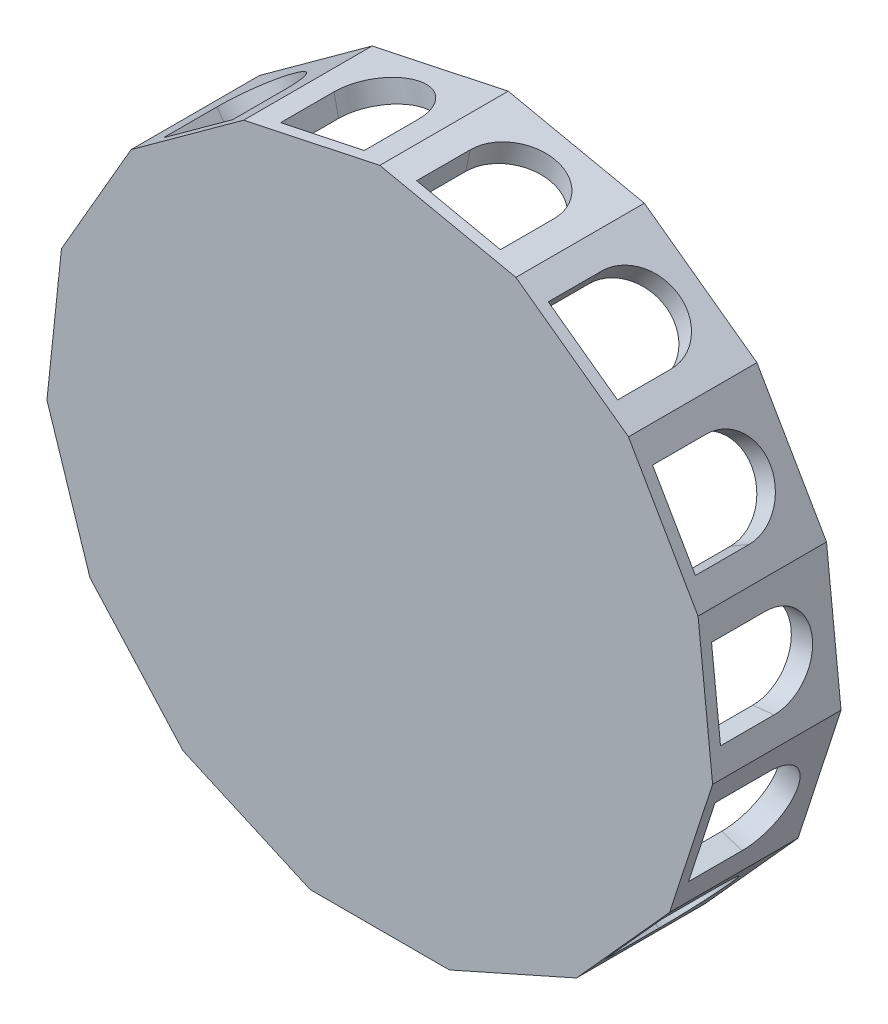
ISO-10303-21;
HEADER;
FILE_DESCRIPTION(('STEP AP214'),'2;1');
FILE_NAME('part.step','',(''),(''),'','','');
FILE_SCHEMA(('AUTOMOTIVE_DESIGN { 1 0 10303 214 1 1 1 1 }'));
ENDSEC;
DATA;
#1=APPLICATION_CONTEXT('core data for automotive mechanical design processes');
#2=APPLICATION_PROTOCOL_DEFINITION('international standard','automotive_design',2000,#1);
#3=PRODUCT_CONTEXT('',#1,'mechanical');
#4=PRODUCT('Part','Part','',(#3));
#5=PRODUCT_RELATED_PRODUCT_CATEGORY('part','',(#4));
#6=PRODUCT_DEFINITION_FORMATION('','',#4);
#7=PRODUCT_DEFINITION_CONTEXT('part definition',#1,'design');
#8=PRODUCT_DEFINITION('design','',#6,#7);
#9=PRODUCT_DEFINITION_SHAPE('','',#8);
#10=(LENGTH_UNIT() NAMED_UNIT(*) SI_UNIT(.MILLI.,.METRE.));
#11=(NAMED_UNIT(*) PLANE_ANGLE_UNIT() SI_UNIT($,.RADIAN.));
#12=(NAMED_UNIT(*) SI_UNIT($,.STERADIAN.) SOLID_ANGLE_UNIT());
#13=UNCERTAINTY_MEASURE_WITH_UNIT(LENGTH_MEASURE(1.E-05),#10,'distance_accuracy_value','');
#14=(GEOMETRIC_REPRESENTATION_CONTEXT(3) GLOBAL_UNCERTAINTY_ASSIGNED_CONTEXT((#13)) GLOBAL_UNIT_ASSIGNED_CONTEXT((#10,
#11,#12)) REPRESENTATION_CONTEXT('',''));
#15=CARTESIAN_POINT('',(0.,0.,0.));
#16=DIRECTION('',(0.,0.,1.));
#17=DIRECTION('',(1.,0.,0.));
#18=AXIS2_PLACEMENT_3D('',#15,#16,#17);
#19=CARTESIAN_POINT('',(-2.03814834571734E-12,-1.16397114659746E-12,227.30545111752));
#20=DIRECTION('',(0.,0.,1.));
#21=DIRECTION('',(1.,0.,0.));
#22=AXIS2_PLACEMENT_3D('',#19,#20,#21);
#23=PLANE('',#22);
#24=DIRECTION('',(0.309016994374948,-0.951056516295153,0.));
#25=VECTOR('',#24,1.);
#26=CARTESIAN_POINT('',(-2293.03571971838,-241.007765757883,227.30545111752));
#27=LINE('',#26,#25);
#28=CARTESIAN_POINT('',(-2293.03571971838,-241.007765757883,227.30545111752));
#29=VERTEX_POINT('',#28);
#30=CARTESIAN_POINT('',(-1996.7656763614,-1152.83320075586,227.30545111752));
#31=VERTEX_POINT('',#30);
#32=EDGE_CURVE('E834',#29,#31,#27,.T.);
#33=ORIENTED_EDGE('',*,*,#32,.T.);
#34=DIRECTION('',(0.669130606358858,-0.743144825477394,0.));
#35=VECTOR('',#34,1.);
#36=CARTESIAN_POINT('',(-1996.7656763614,-1152.83320075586,227.30545111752));
#37=LINE('',#36,#35);
#38=CARTESIAN_POINT('',(-1355.23670751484,-1865.32330218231,227.30545111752));
#39=VERTEX_POINT('',#38);
#40=EDGE_CURVE('E838',#31,#39,#37,.T.);
#41=ORIENTED_EDGE('',*,*,#40,.T.);
#42=DIRECTION('',(0.913545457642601,-0.4067366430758,0.));
#43=VECTOR('',#42,1.);
#44=CARTESIAN_POINT('',(-1355.23670751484,-1865.32330218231,227.30545111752));
#45=LINE('',#44,#43);
#46=CARTESIAN_POINT('',(-479.375000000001,-2255.28205873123,227.30545111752));
#47=VERTEX_POINT('',#46);
#48=EDGE_CURVE('E842',#39,#47,#45,.T.);
#49=ORIENTED_EDGE('',*,*,#48,.T.);
#50=DIRECTION('',(1.,0.,0.));
#51=VECTOR('',#50,1.);
#52=CARTESIAN_POINT('',(-479.375000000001,-2255.28205873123,227.30545111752));
#53=LINE('',#52,#51);
#54=CARTESIAN_POINT('',(479.374999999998,-2255.28205873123,227.30545111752));
#55=VERTEX_POINT('',#54);
#56=EDGE_CURVE('E846',#47,#55,#53,.T.);
#57=ORIENTED_EDGE('',*,*,#56,.T.);
#58=DIRECTION('',(0.913545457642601,0.406736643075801,0.));
#59=VECTOR('',#58,1.);
#60=CARTESIAN_POINT('',(1355.23670751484,-1865.32330218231,227.30545111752));
#61=LINE('',#60,#59);
#62=CARTESIAN_POINT('',(1355.23670751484,-1865.32330218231,227.30545111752));
#63=VERTEX_POINT('',#62);
#64=EDGE_CURVE('E850',#55,#63,#61,.T.);
#65=ORIENTED_EDGE('',*,*,#64,.T.);
#66=DIRECTION('',(0.669130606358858,0.743144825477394,0.));
#67=VECTOR('',#66,1.);
#68=CARTESIAN_POINT('',(1996.76567636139,-1152.83320075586,227.30545111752));
#69=LINE('',#68,#67);
#70=CARTESIAN_POINT('',(1996.76567636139,-1152.83320075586,227.30545111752));
#71=VERTEX_POINT('',#70);
#72=EDGE_CURVE('E854',#63,#71,#69,.T.);
#73=ORIENTED_EDGE('',*,*,#72,.T.);
#74=DIRECTION('',(0.309016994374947,0.951056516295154,0.));
#75=VECTOR('',#74,1.);
#76=CARTESIAN_POINT('',(1996.76567636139,-1152.83320075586,227.30545111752));
#77=LINE('',#76,#75);
#78=CARTESIAN_POINT('',(2293.03571971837,-241.007765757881,227.30545111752));
#79=VERTEX_POINT('',#78);
#80=EDGE_CURVE('E858',#71,#79,#77,.T.);
#81=ORIENTED_EDGE('',*,*,#80,.T.);
#82=DIRECTION('',(-0.104528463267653,0.994521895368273,0.));
#83=VECTOR('',#82,1.);
#84=CARTESIAN_POINT('',(2192.81905556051,712.490101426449,227.30545111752));
#85=LINE('',#84,#83);
#86=CARTESIAN_POINT('',(2192.81905556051,712.490101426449,227.30545111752));
#87=VERTEX_POINT('',#86);
#88=EDGE_CURVE('E862',#79,#87,#85,.T.);
#89=ORIENTED_EDGE('',*,*,#88,.T.);
#90=DIRECTION('',(-0.5,0.866025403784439,0.));
#91=VECTOR('',#90,1.);
#92=CARTESIAN_POINT('',(1713.44405556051,1542.79195730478,227.30545111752));
#93=LINE('',#92,#91);
#94=CARTESIAN_POINT('',(1713.44405556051,1542.79195730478,227.30545111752));
#95=VERTEX_POINT('',#94);
#96=EDGE_CURVE('E866',#87,#95,#93,.T.);
#97=ORIENTED_EDGE('',*,*,#96,.T.);
#98=DIRECTION('',(-0.809016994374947,0.587785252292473,0.));
#99=VECTOR('',#98,1.);
#100=CARTESIAN_POINT('',(1713.44405556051,1542.79195730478,227.30545111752));
#101=LINE('',#100,#99);
#102=CARTESIAN_POINT('',(937.799012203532,2106.33106794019,227.30545111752));
#103=VERTEX_POINT('',#102);
#104=EDGE_CURVE('E870',#95,#103,#101,.T.);
#105=ORIENTED_EDGE('',*,*,#104,.T.);
#106=DIRECTION('',(-0.978147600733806,0.207911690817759,0.));
#107=VECTOR('',#106,1.);
#108=CARTESIAN_POINT('',(937.799012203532,2106.33106794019,227.30545111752));
#109=LINE('',#108,#107);
#110=CARTESIAN_POINT('',(-2.03814834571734E-12,2305.66640151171,227.30545111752));
#111=VERTEX_POINT('',#110);
#112=EDGE_CURVE('E762',#103,#111,#109,.T.);
#113=ORIENTED_EDGE('',*,*,#112,.T.);
#114=DIRECTION('',(-0.978147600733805,-0.20791169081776,0.));
#115=VECTOR('',#114,1.);
#116=CARTESIAN_POINT('',(-2.03814834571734E-12,2305.66640151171,227.30545111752));
#117=LINE('',#116,#115);
#118=CARTESIAN_POINT('',(-937.799012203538,2106.33106794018,227.30545111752));
#119=VERTEX_POINT('',#118);
#120=EDGE_CURVE('E756',#111,#119,#117,.T.);
#121=ORIENTED_EDGE('',*,*,#120,.T.);
#122=DIRECTION('',(-0.809016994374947,-0.587785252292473,0.));
#123=VECTOR('',#122,1.);
#124=CARTESIAN_POINT('',(-937.799012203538,2106.33106794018,227.30545111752));
#125=LINE('',#124,#123);
#126=CARTESIAN_POINT('',(-1713.44405556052,1542.79195730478,227.30545111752));
#127=VERTEX_POINT('',#126);
#128=EDGE_CURVE('E822',#119,#127,#125,.T.);
#129=ORIENTED_EDGE('',*,*,#128,.T.);
#130=DIRECTION('',(-0.5,-0.866025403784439,0.));
#131=VECTOR('',#130,1.);
#132=CARTESIAN_POINT('',(-1713.44405556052,1542.79195730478,227.30545111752));
#133=LINE('',#132,#131);
#134=CARTESIAN_POINT('',(-2192.81905556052,712.490101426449,227.30545111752));
#135=VERTEX_POINT('',#134);
#136=EDGE_CURVE('E826',#127,#135,#133,.T.);
#137=ORIENTED_EDGE('',*,*,#136,.T.);
#138=DIRECTION('',(-0.104528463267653,-0.994521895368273,0.));
#139=VECTOR('',#138,1.);
#140=CARTESIAN_POINT('',(-2192.81905556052,712.490101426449,227.30545111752));
#141=LINE('',#140,#139);
#142=EDGE_CURVE('E830',#135,#29,#141,.T.);
#143=ORIENTED_EDGE('',*,*,#142,.T.);
#144=EDGE_LOOP('',(#33,#41,#49,#57,#65,#73,#81,#89,#97,#105,#113,#121,#129,#137,#143));
#145=FACE_BOUND('',#144,.T.);
#146=ADVANCED_FACE('F39',(#145),#23,.T.);
#147=CARTESIAN_POINT('',(-2192.81905556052,712.490101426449,-657.69454888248));
#148=DIRECTION('',(-0.994521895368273,0.104528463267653,0.));
#149=DIRECTION('',(-0.104528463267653,-0.994521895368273,0.));
#150=AXIS2_PLACEMENT_3D('',#147,#148,#149);
#151=PLANE('',#150);
#152=DIRECTION('',(0.,0.,1.));
#153=VECTOR('',#152,1.);
#154=CARTESIAN_POINT('',(-2212.09149097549,529.125126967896,-657.69454888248));
#155=LINE('',#154,#153);
#156=CARTESIAN_POINT('',(-2212.09149097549,529.125126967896,-215.19454888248));
#157=VERTEX_POINT('',#156);
#158=CARTESIAN_POINT('',(-2212.09149097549,529.125126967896,153.55545111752));
#159=VERTEX_POINT('',#158);
#160=EDGE_CURVE('E1067',#157,#159,#155,.T.);
#161=ORIENTED_EDGE('',*,*,#160,.T.);
#162=DIRECTION('',(-0.104528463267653,-0.994521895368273,0.));
#163=VECTOR('',#162,1.);
#164=CARTESIAN_POINT('',(-2293.03571971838,-241.007765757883,153.55545111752));
#165=LINE('',#164,#163);
#166=CARTESIAN_POINT('',(-2273.76328430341,-57.6427912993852,153.55545111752));
#167=VERTEX_POINT('',#166);
#168=EDGE_CURVE('E1473',#159,#167,#165,.T.);
#169=ORIENTED_EDGE('',*,*,#168,.T.);
#170=DIRECTION('',(0.,0.,-1.));
#171=VECTOR('',#170,1.);
#172=CARTESIAN_POINT('',(-2273.76328430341,-57.6427912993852,-657.69454888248));
#173=LINE('',#172,#171);
#174=CARTESIAN_POINT('',(-2273.76328430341,-57.6427912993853,-215.19454888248));
#175=VERTEX_POINT('',#174);
#176=EDGE_CURVE('E1075',#167,#175,#173,.T.);
#177=ORIENTED_EDGE('',*,*,#176,.T.);
#178=CARTESIAN_POINT('',(-2242.92738763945,235.741167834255,-215.19454888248));
#179=DIRECTION('',(-0.994521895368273,0.104528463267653,0.));
#180=DIRECTION('',(-0.104528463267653,-0.994521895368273,0.));
#181=AXIS2_PLACEMENT_3D('',#178,#179,#180);
#182=CIRCLE('',#181,295.);
#183=EDGE_CURVE('E1071',#175,#157,#182,.F.);
#184=ORIENTED_EDGE('',*,*,#183,.T.);
#185=EDGE_LOOP('',(#161,#169,#177,#184));
#186=FACE_BOUND('',#185,.T.);
#187=ORIENTED_EDGE('',*,*,#142,.F.);
#188=DIRECTION('',(0.,0.,1.));
#189=VECTOR('',#188,1.);
#190=CARTESIAN_POINT('',(-2192.81905556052,712.490101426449,-657.69454888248));
#191=LINE('',#190,#189);
#192=CARTESIAN_POINT('',(-2192.81905556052,712.490101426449,-657.69454888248));
#193=VERTEX_POINT('',#192);
#194=EDGE_CURVE('E914',#193,#135,#191,.T.);
#195=ORIENTED_EDGE('',*,*,#194,.F.);
#196=DIRECTION('',(-0.104528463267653,-0.994521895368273,0.));
#197=VECTOR('',#196,1.);
#198=CARTESIAN_POINT('',(-2192.81905556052,712.490101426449,-657.69454888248));
#199=LINE('',#198,#197);
#200=CARTESIAN_POINT('',(-2293.03571971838,-241.007765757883,-657.69454888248));
#201=VERTEX_POINT('',#200);
#202=EDGE_CURVE('E770',#193,#201,#199,.T.);
#203=ORIENTED_EDGE('',*,*,#202,.T.);
#204=DIRECTION('',(0.,0.,1.));
#205=VECTOR('',#204,1.);
#206=CARTESIAN_POINT('',(-2293.03571971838,-241.007765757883,-657.69454888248));
#207=LINE('',#206,#205);
#208=EDGE_CURVE('E911',#201,#29,#207,.T.);
#209=ORIENTED_EDGE('',*,*,#208,.T.);
#210=EDGE_LOOP('',(#187,#195,#203,#209));
#211=FACE_BOUND('',#210,.T.);
#212=ADVANCED_FACE('F1594',(#186,#211),#151,.T.);
#213=CARTESIAN_POINT('',(-1713.44405556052,1542.79195730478,-657.69454888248));
#214=DIRECTION('',(-0.866025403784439,0.5,0.));
#215=DIRECTION('',(-0.5,-0.866025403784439,0.));
#216=AXIS2_PLACEMENT_3D('',#213,#214,#215);
#217=PLANE('',#216);
#218=DIRECTION('',(0.,0.,1.));
#219=VECTOR('',#218,1.);
#220=CARTESIAN_POINT('',(-1805.63155556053,1383.118523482,-657.69454888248));
#221=LINE('',#220,#219);
#222=CARTESIAN_POINT('',(-1805.63155556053,1383.118523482,-215.19454888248));
#223=VERTEX_POINT('',#222);
#224=CARTESIAN_POINT('',(-1805.63155556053,1383.118523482,153.55545111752));
#225=VERTEX_POINT('',#224);
#226=EDGE_CURVE('E1056',#223,#225,#221,.T.);
#227=ORIENTED_EDGE('',*,*,#226,.T.);
#228=DIRECTION('',(-0.5,-0.866025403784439,0.));
#229=VECTOR('',#228,1.);
#230=CARTESIAN_POINT('',(-2192.81905556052,712.490101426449,153.55545111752));
#231=LINE('',#230,#229);
#232=CARTESIAN_POINT('',(-2100.63155556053,872.16353524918,153.55545111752));
#233=VERTEX_POINT('',#232);
#234=EDGE_CURVE('E1477',#225,#233,#231,.T.);
#235=ORIENTED_EDGE('',*,*,#234,.T.);
#236=DIRECTION('',(0.,0.,-1.));
#237=VECTOR('',#236,1.);
#238=CARTESIAN_POINT('',(-2100.63155556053,872.16353524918,-657.69454888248));
#239=LINE('',#238,#237);
#240=CARTESIAN_POINT('',(-2100.63155556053,872.16353524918,-215.19454888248));
#241=VERTEX_POINT('',#240);
#242=EDGE_CURVE('E1064',#233,#241,#239,.T.);
#243=ORIENTED_EDGE('',*,*,#242,.T.);
#244=CARTESIAN_POINT('',(-1953.13155556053,1127.64102936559,-215.19454888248));
#245=DIRECTION('',(-0.866025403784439,0.5,0.));
#246=DIRECTION('',(-0.5,-0.866025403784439,0.));
#247=AXIS2_PLACEMENT_3D('',#244,#245,#246);
#248=CIRCLE('',#247,295.);
#249=EDGE_CURVE('E1060',#241,#223,#248,.F.);
#250=ORIENTED_EDGE('',*,*,#249,.T.);
#251=EDGE_LOOP('',(#227,#235,#243,#250));
#252=FACE_BOUND('',#251,.T.);
#253=ORIENTED_EDGE('',*,*,#136,.F.);
#254=DIRECTION('',(0.,0.,1.));
#255=VECTOR('',#254,1.);
#256=CARTESIAN_POINT('',(-1713.44405556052,1542.79195730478,-657.69454888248));
#257=LINE('',#256,#255);
#258=CARTESIAN_POINT('',(-1713.44405556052,1542.79195730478,-657.69454888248));
#259=VERTEX_POINT('',#258);
#260=EDGE_CURVE('E917',#259,#127,#257,.T.);
#261=ORIENTED_EDGE('',*,*,#260,.F.);
#262=DIRECTION('',(-0.5,-0.866025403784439,0.));
#263=VECTOR('',#262,1.);
#264=CARTESIAN_POINT('',(-1713.44405556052,1542.79195730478,-657.69454888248));
#265=LINE('',#264,#263);
#266=EDGE_CURVE('E766',#259,#193,#265,.T.);
#267=ORIENTED_EDGE('',*,*,#266,.T.);
#268=ORIENTED_EDGE('',*,*,#194,.T.);
#269=EDGE_LOOP('',(#253,#261,#267,#268));
#270=FACE_BOUND('',#269,.T.);
#271=ADVANCED_FACE('F1600',(#252,#270),#217,.T.);
#272=CARTESIAN_POINT('',(-937.799012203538,2106.33106794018,-657.69454888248));
#273=DIRECTION('',(-0.587785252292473,0.809016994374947,0.));
#274=DIRECTION('',(-0.809016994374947,-0.587785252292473,0.));
#275=AXIS2_PLACEMENT_3D('',#272,#273,#274);
#276=PLANE('',#275);
#277=DIRECTION('',(0.,0.,1.));
#278=VECTOR('',#277,1.);
#279=CARTESIAN_POINT('',(-1086.96152054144,1997.95816204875,-657.69454888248));
#280=LINE('',#279,#278);
#281=CARTESIAN_POINT('',(-1086.96152054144,1997.95816204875,-215.19454888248));
#282=VERTEX_POINT('',#281);
#283=CARTESIAN_POINT('',(-1086.96152054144,1997.95816204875,153.55545111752));
#284=VERTEX_POINT('',#283);
#285=EDGE_CURVE('E1045',#282,#284,#280,.T.);
#286=ORIENTED_EDGE('',*,*,#285,.T.);
#287=DIRECTION('',(-0.809016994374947,-0.587785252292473,0.));
#288=VECTOR('',#287,1.);
#289=CARTESIAN_POINT('',(-1713.44405556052,1542.79195730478,153.55545111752));
#290=LINE('',#289,#288);
#291=CARTESIAN_POINT('',(-1564.28154722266,1651.16486319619,153.55545111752));
#292=VERTEX_POINT('',#291);
#293=EDGE_CURVE('E1215',#284,#292,#290,.T.);
#294=ORIENTED_EDGE('',*,*,#293,.T.);
#295=DIRECTION('',(0.,0.,-1.));
#296=VECTOR('',#295,1.);
#297=CARTESIAN_POINT('',(-1564.28154722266,1651.16486319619,-657.69454888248));
#298=LINE('',#297,#296);
#299=CARTESIAN_POINT('',(-1564.28154722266,1651.16486319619,-215.19454888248));
#300=VERTEX_POINT('',#299);
#301=EDGE_CURVE('E1053',#292,#300,#298,.T.);
#302=ORIENTED_EDGE('',*,*,#301,.T.);
#303=CARTESIAN_POINT('',(-1325.62153388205,1824.56151262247,-215.19454888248));
#304=DIRECTION('',(-0.587785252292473,0.809016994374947,0.));
#305=DIRECTION('',(-0.809016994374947,-0.587785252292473,0.));
#306=AXIS2_PLACEMENT_3D('',#303,#304,#305);
#307=CIRCLE('',#306,295.);
#308=EDGE_CURVE('E1049',#300,#282,#307,.F.);
#309=ORIENTED_EDGE('',*,*,#308,.T.);
#310=EDGE_LOOP('',(#286,#294,#302,#309));
#311=FACE_BOUND('',#310,.T.);
#312=ORIENTED_EDGE('',*,*,#128,.F.);
#313=DIRECTION('',(0.,0.,1.));
#314=VECTOR('',#313,1.);
#315=CARTESIAN_POINT('',(-937.799012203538,2106.33106794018,-657.69454888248));
#316=LINE('',#315,#314);
#317=CARTESIAN_POINT('',(-937.799012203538,2106.33106794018,-657.69454888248));
#318=VERTEX_POINT('',#317);
#319=EDGE_CURVE('E818',#318,#119,#316,.T.);
#320=ORIENTED_EDGE('',*,*,#319,.F.);
#321=DIRECTION('',(-0.809016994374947,-0.587785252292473,0.));
#322=VECTOR('',#321,1.);
#323=CARTESIAN_POINT('',(-937.799012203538,2106.33106794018,-657.69454888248));
#324=LINE('',#323,#322);
#325=EDGE_CURVE('E761',#318,#259,#324,.T.);
#326=ORIENTED_EDGE('',*,*,#325,.T.);
#327=ORIENTED_EDGE('',*,*,#260,.T.);
#328=EDGE_LOOP('',(#312,#320,#326,#327));
#329=FACE_BOUND('',#328,.T.);
#330=ADVANCED_FACE('F1647',(#311,#329),#276,.T.);
#331=CARTESIAN_POINT('',(-2.03814834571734E-12,2305.66640151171,-657.69454888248));
#332=DIRECTION('',(-0.20791169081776,0.978147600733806,0.));
#333=DIRECTION('',(-0.978147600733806,-0.20791169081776,0.));
#334=AXIS2_PLACEMENT_3D('',#331,#332,#333);
#335=PLANE('',#334);
#336=DIRECTION('',(0.,0.,1.));
#337=VECTOR('',#336,1.);
#338=CARTESIAN_POINT('',(-180.345963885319,2267.33268351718,-657.69454888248));
#339=LINE('',#338,#337);
#340=CARTESIAN_POINT('',(-180.345963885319,2267.33268351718,-215.19454888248));
#341=VERTEX_POINT('',#340);
#342=CARTESIAN_POINT('',(-180.345963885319,2267.33268351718,153.55545111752));
#343=VERTEX_POINT('',#342);
#344=EDGE_CURVE('E1034',#341,#343,#339,.T.);
#345=ORIENTED_EDGE('',*,*,#344,.T.);
#346=DIRECTION('',(-0.978147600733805,-0.20791169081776,0.));
#347=VECTOR('',#346,1.);
#348=CARTESIAN_POINT('',(-937.799012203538,2106.33106794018,153.55545111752));
#349=LINE('',#348,#347);
#350=CARTESIAN_POINT('',(-757.453048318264,2144.6647859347,153.55545111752));
#351=VERTEX_POINT('',#350);
#352=EDGE_CURVE('E1510',#343,#351,#349,.T.);
#353=ORIENTED_EDGE('',*,*,#352,.T.);
#354=DIRECTION('',(0.,0.,-1.));
#355=VECTOR('',#354,1.);
#356=CARTESIAN_POINT('',(-757.453048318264,2144.6647859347,-657.69454888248));
#357=LINE('',#356,#355);
#358=CARTESIAN_POINT('',(-757.453048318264,2144.6647859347,-215.19454888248));
#359=VERTEX_POINT('',#358);
#360=EDGE_CURVE('E1042',#351,#359,#357,.T.);
#361=ORIENTED_EDGE('',*,*,#360,.T.);
#362=CARTESIAN_POINT('',(-468.899506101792,2205.99873472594,-215.19454888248));
#363=DIRECTION('',(-0.20791169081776,0.978147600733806,0.));
#364=DIRECTION('',(-0.978147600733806,-0.20791169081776,0.));
#365=AXIS2_PLACEMENT_3D('',#362,#363,#364);
#366=CIRCLE('',#365,295.);
#367=EDGE_CURVE('E1038',#359,#341,#366,.F.);
#368=ORIENTED_EDGE('',*,*,#367,.T.);
#369=EDGE_LOOP('',(#345,#353,#361,#368));
#370=FACE_BOUND('',#369,.T.);
#371=ORIENTED_EDGE('',*,*,#120,.F.);
#372=DIRECTION('',(0.,0.,1.));
#373=VECTOR('',#372,1.);
#374=CARTESIAN_POINT('',(-2.03814834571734E-12,2305.66640151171,-657.69454888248));
#375=LINE('',#374,#373);
#376=CARTESIAN_POINT('',(-2.03814834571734E-12,2305.66640151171,-657.69454888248));
#377=VERTEX_POINT('',#376);
#378=EDGE_CURVE('E877',#377,#111,#375,.T.);
#379=ORIENTED_EDGE('',*,*,#378,.F.);
#380=DIRECTION('',(-0.978147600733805,-0.20791169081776,0.));
#381=VECTOR('',#380,1.);
#382=CARTESIAN_POINT('',(-2.03814834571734E-12,2305.66640151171,-657.69454888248));
#383=LINE('',#382,#381);
#384=EDGE_CURVE('E757',#377,#318,#383,.T.);
#385=ORIENTED_EDGE('',*,*,#384,.T.);
#386=ORIENTED_EDGE('',*,*,#319,.T.);
#387=EDGE_LOOP('',(#371,#379,#385,#386));
#388=FACE_BOUND('',#387,.T.);
#389=ADVANCED_FACE('F41',(#370,#388),#335,.T.);
#390=CARTESIAN_POINT('',(937.799012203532,2106.33106794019,-657.69454888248));
#391=DIRECTION('',(0.207911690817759,0.978147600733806,0.));
#392=DIRECTION('',(-0.978147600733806,0.207911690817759,0.));
#393=AXIS2_PLACEMENT_3D('',#390,#391,#392);
#394=PLANE('',#393);
#395=DIRECTION('',(0.,0.,1.));
#396=VECTOR('',#395,1.);
#397=CARTESIAN_POINT('',(757.453048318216,2144.66478593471,-657.69454888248));
#398=LINE('',#397,#396);
#399=CARTESIAN_POINT('',(757.453048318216,2144.66478593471,-215.19454888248));
#400=VERTEX_POINT('',#399);
#401=CARTESIAN_POINT('',(757.453048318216,2144.66478593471,153.55545111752));
#402=VERTEX_POINT('',#401);
#403=EDGE_CURVE('E1023',#400,#402,#398,.T.);
#404=ORIENTED_EDGE('',*,*,#403,.T.);
#405=DIRECTION('',(-0.978147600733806,0.207911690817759,0.));
#406=VECTOR('',#405,1.);
#407=CARTESIAN_POINT('',(-2.03814834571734E-12,2305.66640151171,153.55545111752));
#408=LINE('',#407,#406);
#409=CARTESIAN_POINT('',(180.345963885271,2267.33268351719,153.55545111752));
#410=VERTEX_POINT('',#409);
#411=EDGE_CURVE('E1506',#402,#410,#408,.T.);
#412=ORIENTED_EDGE('',*,*,#411,.T.);
#413=DIRECTION('',(0.,0.,-1.));
#414=VECTOR('',#413,1.);
#415=CARTESIAN_POINT('',(180.345963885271,2267.33268351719,-657.69454888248));
#416=LINE('',#415,#414);
#417=CARTESIAN_POINT('',(180.345963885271,2267.33268351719,-215.19454888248));
#418=VERTEX_POINT('',#417);
#419=EDGE_CURVE('E1031',#410,#418,#416,.T.);
#420=ORIENTED_EDGE('',*,*,#419,.T.);
#421=CARTESIAN_POINT('',(468.899506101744,2205.99873472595,-215.19454888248));
#422=DIRECTION('',(0.207911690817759,0.978147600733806,0.));
#423=DIRECTION('',(-0.978147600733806,0.207911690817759,0.));
#424=AXIS2_PLACEMENT_3D('',#421,#422,#423);
#425=CIRCLE('',#424,295.);
#426=EDGE_CURVE('E1027',#418,#400,#425,.F.);
#427=ORIENTED_EDGE('',*,*,#426,.T.);
#428=EDGE_LOOP('',(#404,#412,#420,#427));
#429=FACE_BOUND('',#428,.T.);
#430=ORIENTED_EDGE('',*,*,#112,.F.);
#431=DIRECTION('',(0.,0.,1.));
#432=VECTOR('',#431,1.);
#433=CARTESIAN_POINT('',(937.799012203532,2106.33106794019,-657.69454888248));
#434=LINE('',#433,#432);
#435=CARTESIAN_POINT('',(937.799012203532,2106.33106794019,-657.69454888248));
#436=VERTEX_POINT('',#435);
#437=EDGE_CURVE('E881',#436,#103,#434,.T.);
#438=ORIENTED_EDGE('',*,*,#437,.F.);
#439=DIRECTION('',(-0.978147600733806,0.207911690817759,0.));
#440=VECTOR('',#439,1.);
#441=CARTESIAN_POINT('',(937.799012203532,2106.33106794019,-657.69454888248));
#442=LINE('',#441,#440);
#443=EDGE_CURVE('E814',#436,#377,#442,.T.);
#444=ORIENTED_EDGE('',*,*,#443,.T.);
#445=ORIENTED_EDGE('',*,*,#378,.T.);
#446=EDGE_LOOP('',(#430,#438,#444,#445));
#447=FACE_BOUND('',#446,.T.);
#448=ADVANCED_FACE('F1606',(#429,#447),#394,.T.);
#449=CARTESIAN_POINT('',(1713.44405556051,1542.79195730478,-657.69454888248));
#450=DIRECTION('',(0.587785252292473,0.809016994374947,0.));
#451=DIRECTION('',(-0.809016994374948,0.587785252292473,0.));
#452=AXIS2_PLACEMENT_3D('',#449,#450,#451);
#453=PLANE('',#452);
#454=DIRECTION('',(0.,0.,1.));
#455=VECTOR('',#454,1.);
#456=CARTESIAN_POINT('',(1564.28154722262,1651.16486319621,-657.69454888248));
#457=LINE('',#456,#455);
#458=CARTESIAN_POINT('',(1564.28154722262,1651.16486319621,-215.19454888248));
#459=VERTEX_POINT('',#458);
#460=CARTESIAN_POINT('',(1564.28154722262,1651.16486319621,153.55545111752));
#461=VERTEX_POINT('',#460);
#462=EDGE_CURVE('E1012',#459,#461,#457,.T.);
#463=ORIENTED_EDGE('',*,*,#462,.T.);
#464=DIRECTION('',(-0.809016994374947,0.587785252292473,0.));
#465=VECTOR('',#464,1.);
#466=CARTESIAN_POINT('',(937.799012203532,2106.33106794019,153.55545111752));
#467=LINE('',#466,#465);
#468=CARTESIAN_POINT('',(1086.9615205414,1997.95816204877,153.55545111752));
#469=VERTEX_POINT('',#468);
#470=EDGE_CURVE('E1502',#461,#469,#467,.T.);
#471=ORIENTED_EDGE('',*,*,#470,.T.);
#472=DIRECTION('',(0.,0.,-1.));
#473=VECTOR('',#472,1.);
#474=CARTESIAN_POINT('',(1086.9615205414,1997.95816204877,-657.69454888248));
#475=LINE('',#474,#473);
#476=CARTESIAN_POINT('',(1086.9615205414,1997.95816204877,-215.19454888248));
#477=VERTEX_POINT('',#476);
#478=EDGE_CURVE('E1020',#469,#477,#475,.T.);
#479=ORIENTED_EDGE('',*,*,#478,.T.);
#480=CARTESIAN_POINT('',(1325.62153388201,1824.56151262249,-215.19454888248));
#481=DIRECTION('',(0.587785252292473,0.809016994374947,0.));
#482=DIRECTION('',(-0.809016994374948,0.587785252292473,0.));
#483=AXIS2_PLACEMENT_3D('',#480,#481,#482);
#484=CIRCLE('',#483,295.);
#485=EDGE_CURVE('E1016',#477,#459,#484,.F.);
#486=ORIENTED_EDGE('',*,*,#485,.T.);
#487=EDGE_LOOP('',(#463,#471,#479,#486));
#488=FACE_BOUND('',#487,.T.);
#489=ORIENTED_EDGE('',*,*,#104,.F.);
#490=DIRECTION('',(0.,0.,1.));
#491=VECTOR('',#490,1.);
#492=CARTESIAN_POINT('',(1713.44405556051,1542.79195730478,-657.69454888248));
#493=LINE('',#492,#491);
#494=CARTESIAN_POINT('',(1713.44405556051,1542.79195730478,-657.69454888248));
#495=VERTEX_POINT('',#494);
#496=EDGE_CURVE('E884',#495,#95,#493,.T.);
#497=ORIENTED_EDGE('',*,*,#496,.F.);
#498=DIRECTION('',(-0.809016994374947,0.587785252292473,0.));
#499=VECTOR('',#498,1.);
#500=CARTESIAN_POINT('',(1713.44405556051,1542.79195730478,-657.69454888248));
#501=LINE('',#500,#499);
#502=EDGE_CURVE('E810',#495,#436,#501,.T.);
#503=ORIENTED_EDGE('',*,*,#502,.T.);
#504=ORIENTED_EDGE('',*,*,#437,.T.);
#505=EDGE_LOOP('',(#489,#497,#503,#504));
#506=FACE_BOUND('',#505,.T.);
#507=ADVANCED_FACE('F1609',(#488,#506),#453,.T.);
#508=CARTESIAN_POINT('',(1713.44405556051,1542.79195730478,-657.69454888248));
#509=DIRECTION('',(0.866025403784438,0.5,0.));
#510=DIRECTION('',(-0.5,0.866025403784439,0.));
#511=AXIS2_PLACEMENT_3D('',#508,#509,#510);
#512=PLANE('',#511);
#513=DIRECTION('',(0.,0.,1.));
#514=VECTOR('',#513,1.);
#515=CARTESIAN_POINT('',(2100.6315555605,872.16353524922,-657.69454888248));
#516=LINE('',#515,#514);
#517=CARTESIAN_POINT('',(2100.6315555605,872.16353524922,-215.19454888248));
#518=VERTEX_POINT('',#517);
#519=CARTESIAN_POINT('',(2100.6315555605,872.16353524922,153.55545111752));
#520=VERTEX_POINT('',#519);
#521=EDGE_CURVE('E1001',#518,#520,#516,.T.);
#522=ORIENTED_EDGE('',*,*,#521,.T.);
#523=DIRECTION('',(-0.5,0.866025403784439,0.));
#524=VECTOR('',#523,1.);
#525=CARTESIAN_POINT('',(1713.44405556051,1542.79195730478,153.55545111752));
#526=LINE('',#525,#524);
#527=CARTESIAN_POINT('',(1805.6315555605,1383.11852348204,153.55545111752));
#528=VERTEX_POINT('',#527);
#529=EDGE_CURVE('E1199',#520,#528,#526,.T.);
#530=ORIENTED_EDGE('',*,*,#529,.T.);
#531=DIRECTION('',(0.,0.,-1.));
#532=VECTOR('',#531,1.);
#533=CARTESIAN_POINT('',(1805.6315555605,1383.11852348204,-657.69454888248));
#534=LINE('',#533,#532);
#535=CARTESIAN_POINT('',(1805.6315555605,1383.11852348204,-215.19454888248));
#536=VERTEX_POINT('',#535);
#537=EDGE_CURVE('E1009',#528,#536,#534,.T.);
#538=ORIENTED_EDGE('',*,*,#537,.T.);
#539=CARTESIAN_POINT('',(1953.1315555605,1127.64102936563,-215.19454888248));
#540=DIRECTION('',(0.866025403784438,0.5,0.));
#541=DIRECTION('',(-0.5,0.866025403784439,0.));
#542=AXIS2_PLACEMENT_3D('',#539,#540,#541);
#543=CIRCLE('',#542,295.);
#544=EDGE_CURVE('E1005',#536,#518,#543,.F.);
#545=ORIENTED_EDGE('',*,*,#544,.T.);
#546=EDGE_LOOP('',(#522,#530,#538,#545));
#547=FACE_BOUND('',#546,.T.);
#548=ORIENTED_EDGE('',*,*,#96,.F.);
#549=DIRECTION('',(0.,0.,1.));
#550=VECTOR('',#549,1.);
#551=CARTESIAN_POINT('',(2192.81905556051,712.490101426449,-657.69454888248));
#552=LINE('',#551,#550);
#553=CARTESIAN_POINT('',(2192.81905556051,712.490101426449,-657.69454888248));
#554=VERTEX_POINT('',#553);
#555=EDGE_CURVE('E887',#554,#87,#552,.T.);
#556=ORIENTED_EDGE('',*,*,#555,.F.);
#557=DIRECTION('',(-0.5,0.866025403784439,0.));
#558=VECTOR('',#557,1.);
#559=CARTESIAN_POINT('',(1713.44405556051,1542.79195730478,-657.69454888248));
#560=LINE('',#559,#558);
#561=EDGE_CURVE('E806',#554,#495,#560,.T.);
#562=ORIENTED_EDGE('',*,*,#561,.T.);
#563=ORIENTED_EDGE('',*,*,#496,.T.);
#564=EDGE_LOOP('',(#548,#556,#562,#563));
#565=FACE_BOUND('',#564,.T.);
#566=ADVANCED_FACE('F1613',(#547,#565),#512,.T.);
#567=CARTESIAN_POINT('',(2192.81905556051,712.490101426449,-657.69454888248));
#568=DIRECTION('',(0.994521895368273,0.104528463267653,0.));
#569=DIRECTION('',(-0.104528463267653,0.994521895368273,0.));
#570=AXIS2_PLACEMENT_3D('',#567,#568,#569);
#571=PLANE('',#570);
#572=DIRECTION('',(0.,0.,1.));
#573=VECTOR('',#572,1.);
#574=CARTESIAN_POINT('',(2273.7632843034,-57.6427912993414,-657.69454888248));
#575=LINE('',#574,#573);
#576=CARTESIAN_POINT('',(2273.7632843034,-57.6427912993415,-215.19454888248));
#577=VERTEX_POINT('',#576);
#578=CARTESIAN_POINT('',(2273.7632843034,-57.6427912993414,153.55545111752));
#579=VERTEX_POINT('',#578);
#580=EDGE_CURVE('E990',#577,#579,#575,.T.);
#581=ORIENTED_EDGE('',*,*,#580,.T.);
#582=DIRECTION('',(-0.104528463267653,0.994521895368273,0.));
#583=VECTOR('',#582,1.);
#584=CARTESIAN_POINT('',(2192.81905556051,712.490101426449,153.55545111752));
#585=LINE('',#584,#583);
#586=CARTESIAN_POINT('',(2212.09149097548,529.125126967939,153.55545111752));
#587=VERTEX_POINT('',#586);
#588=EDGE_CURVE('E1197',#579,#587,#585,.T.);
#589=ORIENTED_EDGE('',*,*,#588,.T.);
#590=DIRECTION('',(0.,0.,-1.));
#591=VECTOR('',#590,1.);
#592=CARTESIAN_POINT('',(2212.09149097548,529.125126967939,-657.69454888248));
#593=LINE('',#592,#591);
#594=CARTESIAN_POINT('',(2212.09149097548,529.125126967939,-215.19454888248));
#595=VERTEX_POINT('',#594);
#596=EDGE_CURVE('E998',#587,#595,#593,.T.);
#597=ORIENTED_EDGE('',*,*,#596,.T.);
#598=CARTESIAN_POINT('',(2242.92738763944,235.741167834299,-215.19454888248));
#599=DIRECTION('',(0.994521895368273,0.104528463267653,0.));
#600=DIRECTION('',(-0.104528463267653,0.994521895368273,0.));
#601=AXIS2_PLACEMENT_3D('',#598,#599,#600);
#602=CIRCLE('',#601,295.);
#603=EDGE_CURVE('E994',#595,#577,#602,.F.);
#604=ORIENTED_EDGE('',*,*,#603,.T.);
#605=EDGE_LOOP('',(#581,#589,#597,#604));
#606=FACE_BOUND('',#605,.T.);
#607=ORIENTED_EDGE('',*,*,#88,.F.);
#608=DIRECTION('',(0.,0.,1.));
#609=VECTOR('',#608,1.);
#610=CARTESIAN_POINT('',(2293.03571971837,-241.007765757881,-657.69454888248));
#611=LINE('',#610,#609);
#612=CARTESIAN_POINT('',(2293.03571971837,-241.007765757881,-657.69454888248));
#613=VERTEX_POINT('',#612);
#614=EDGE_CURVE('E890',#613,#79,#611,.T.);
#615=ORIENTED_EDGE('',*,*,#614,.F.);
#616=DIRECTION('',(-0.104528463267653,0.994521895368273,0.));
#617=VECTOR('',#616,1.);
#618=CARTESIAN_POINT('',(2192.81905556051,712.490101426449,-657.69454888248));
#619=LINE('',#618,#617);
#620=EDGE_CURVE('E802',#613,#554,#619,.T.);
#621=ORIENTED_EDGE('',*,*,#620,.T.);
#622=ORIENTED_EDGE('',*,*,#555,.T.);
#623=EDGE_LOOP('',(#607,#615,#621,#622));
#624=FACE_BOUND('',#623,.T.);
#625=ADVANCED_FACE('F1617',(#606,#624),#571,.T.);
#626=CARTESIAN_POINT('',(1996.76567636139,-1152.83320075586,-657.69454888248));
#627=DIRECTION('',(0.951056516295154,-0.309016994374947,0.));
#628=DIRECTION('',(0.309016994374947,0.951056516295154,0.));
#629=AXIS2_PLACEMENT_3D('',#626,#627,#628);
#630=PLANE('',#629);
#631=DIRECTION('',(0.,0.,1.));
#632=VECTOR('',#631,1.);
#633=CARTESIAN_POINT('',(2053.74068469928,-977.482155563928,-657.69454888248));
#634=LINE('',#633,#632);
#635=CARTESIAN_POINT('',(2053.74068469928,-977.482155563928,-215.19454888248));
#636=VERTEX_POINT('',#635);
#637=CARTESIAN_POINT('',(2053.74068469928,-977.482155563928,153.55545111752));
#638=VERTEX_POINT('',#637);
#639=EDGE_CURVE('E979',#636,#638,#634,.T.);
#640=ORIENTED_EDGE('',*,*,#639,.T.);
#641=DIRECTION('',(0.309016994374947,0.951056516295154,0.));
#642=VECTOR('',#641,1.);
#643=CARTESIAN_POINT('',(2293.03571971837,-241.007765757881,153.55545111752));
#644=LINE('',#643,#642);
#645=CARTESIAN_POINT('',(2236.0607113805,-416.358810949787,153.55545111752));
#646=VERTEX_POINT('',#645);
#647=EDGE_CURVE('E1200',#638,#646,#644,.T.);
#648=ORIENTED_EDGE('',*,*,#647,.T.);
#649=DIRECTION('',(0.,0.,-1.));
#650=VECTOR('',#649,1.);
#651=CARTESIAN_POINT('',(2236.0607113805,-416.358810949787,-657.69454888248));
#652=LINE('',#651,#650);
#653=CARTESIAN_POINT('',(2236.0607113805,-416.358810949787,-215.19454888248));
#654=VERTEX_POINT('',#653);
#655=EDGE_CURVE('E987',#646,#654,#652,.T.);
#656=ORIENTED_EDGE('',*,*,#655,.T.);
#657=CARTESIAN_POINT('',(2144.90069803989,-696.920483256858,-215.19454888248));
#658=DIRECTION('',(0.951056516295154,-0.309016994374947,0.));
#659=DIRECTION('',(0.309016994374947,0.951056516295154,0.));
#660=AXIS2_PLACEMENT_3D('',#657,#658,#659);
#661=CIRCLE('',#660,295.);
#662=EDGE_CURVE('E983',#654,#636,#661,.F.);
#663=ORIENTED_EDGE('',*,*,#662,.T.);
#664=EDGE_LOOP('',(#640,#648,#656,#663));
#665=FACE_BOUND('',#664,.T.);
#666=ORIENTED_EDGE('',*,*,#80,.F.);
#667=DIRECTION('',(0.,0.,1.));
#668=VECTOR('',#667,1.);
#669=CARTESIAN_POINT('',(1996.76567636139,-1152.83320075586,-657.69454888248));
#670=LINE('',#669,#668);
#671=CARTESIAN_POINT('',(1996.76567636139,-1152.83320075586,-657.69454888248));
#672=VERTEX_POINT('',#671);
#673=EDGE_CURVE('E893',#672,#71,#670,.T.);
#674=ORIENTED_EDGE('',*,*,#673,.F.);
#675=DIRECTION('',(0.309016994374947,0.951056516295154,0.));
#676=VECTOR('',#675,1.);
#677=CARTESIAN_POINT('',(1996.76567636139,-1152.83320075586,-657.69454888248));
#678=LINE('',#677,#676);
#679=EDGE_CURVE('E798',#672,#613,#678,.T.);
#680=ORIENTED_EDGE('',*,*,#679,.T.);
#681=ORIENTED_EDGE('',*,*,#614,.T.);
#682=EDGE_LOOP('',(#666,#674,#680,#681));
#683=FACE_BOUND('',#682,.T.);
#684=ADVANCED_FACE('F1621',(#665,#683),#630,.T.);
#685=CARTESIAN_POINT('',(1996.76567636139,-1152.83320075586,-657.69454888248));
#686=DIRECTION('',(0.743144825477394,-0.669130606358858,0.));
#687=DIRECTION('',(0.669130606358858,0.743144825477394,0.));
#688=AXIS2_PLACEMENT_3D('',#685,#686,#687);
#689=PLANE('',#688);
#690=DIRECTION('',(0.,0.,1.));
#691=VECTOR('',#690,1.);
#692=CARTESIAN_POINT('',(1478.60766306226,-1728.30597498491,-657.69454888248));
#693=LINE('',#692,#691);
#694=CARTESIAN_POINT('',(1478.60766306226,-1728.30597498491,-215.19454888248));
#695=VERTEX_POINT('',#694);
#696=CARTESIAN_POINT('',(1478.60766306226,-1728.30597498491,153.55545111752));
#697=VERTEX_POINT('',#696);
#698=EDGE_CURVE('E968',#695,#697,#693,.T.);
#699=ORIENTED_EDGE('',*,*,#698,.T.);
#700=DIRECTION('',(0.669130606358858,0.743144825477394,0.));
#701=VECTOR('',#700,1.);
#702=CARTESIAN_POINT('',(1996.76567636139,-1152.83320075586,153.55545111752));
#703=LINE('',#702,#701);
#704=CARTESIAN_POINT('',(1873.39472081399,-1289.85052795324,153.55545111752));
#705=VERTEX_POINT('',#704);
#706=EDGE_CURVE('E1492',#697,#705,#703,.T.);
#707=ORIENTED_EDGE('',*,*,#706,.T.);
#708=DIRECTION('',(0.,0.,-1.));
#709=VECTOR('',#708,1.);
#710=CARTESIAN_POINT('',(1873.39472081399,-1289.85052795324,-657.69454888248));
#711=LINE('',#710,#709);
#712=CARTESIAN_POINT('',(1873.39472081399,-1289.85052795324,-215.19454888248));
#713=VERTEX_POINT('',#712);
#714=EDGE_CURVE('E976',#705,#713,#711,.T.);
#715=ORIENTED_EDGE('',*,*,#714,.T.);
#716=CARTESIAN_POINT('',(1676.00119193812,-1509.07825146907,-215.19454888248));
#717=DIRECTION('',(0.743144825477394,-0.669130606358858,0.));
#718=DIRECTION('',(0.669130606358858,0.743144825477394,0.));
#719=AXIS2_PLACEMENT_3D('',#716,#717,#718);
#720=CIRCLE('',#719,295.);
#721=EDGE_CURVE('E972',#713,#695,#720,.F.);
#722=ORIENTED_EDGE('',*,*,#721,.T.);
#723=EDGE_LOOP('',(#699,#707,#715,#722));
#724=FACE_BOUND('',#723,.T.);
#725=ORIENTED_EDGE('',*,*,#72,.F.);
#726=DIRECTION('',(0.,0.,1.));
#727=VECTOR('',#726,1.);
#728=CARTESIAN_POINT('',(1355.23670751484,-1865.32330218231,-657.69454888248));
#729=LINE('',#728,#727);
#730=CARTESIAN_POINT('',(1355.23670751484,-1865.32330218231,-657.69454888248));
#731=VERTEX_POINT('',#730);
#732=EDGE_CURVE('E896',#731,#63,#729,.T.);
#733=ORIENTED_EDGE('',*,*,#732,.F.);
#734=DIRECTION('',(0.669130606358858,0.743144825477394,0.));
#735=VECTOR('',#734,1.);
#736=CARTESIAN_POINT('',(1996.76567636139,-1152.83320075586,-657.69454888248));
#737=LINE('',#736,#735);
#738=EDGE_CURVE('E794',#731,#672,#737,.T.);
#739=ORIENTED_EDGE('',*,*,#738,.T.);
#740=ORIENTED_EDGE('',*,*,#673,.T.);
#741=EDGE_LOOP('',(#725,#733,#739,#740));
#742=FACE_BOUND('',#741,.T.);
#743=ADVANCED_FACE('F1581',(#724,#742),#689,.T.);
#744=CARTESIAN_POINT('',(1355.23670751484,-1865.32330218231,-657.69454888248));
#745=DIRECTION('',(0.406736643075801,-0.913545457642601,0.));
#746=DIRECTION('',(0.913545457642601,0.406736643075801,0.));
#747=AXIS2_PLACEMENT_3D('',#744,#745,#746);
#748=PLANE('',#747);
#749=DIRECTION('',(0.,0.,1.));
#750=VECTOR('',#749,1.);
#751=CARTESIAN_POINT('',(647.809943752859,-2180.28999016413,-657.69454888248));
#752=LINE('',#751,#750);
#753=CARTESIAN_POINT('',(647.809943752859,-2180.28999016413,-215.19454888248));
#754=VERTEX_POINT('',#753);
#755=CARTESIAN_POINT('',(647.809943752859,-2180.28999016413,153.55545111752));
#756=VERTEX_POINT('',#755);
#757=EDGE_CURVE('E957',#754,#756,#752,.T.);
#758=ORIENTED_EDGE('',*,*,#757,.T.);
#759=DIRECTION('',(0.913545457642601,0.406736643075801,0.));
#760=VECTOR('',#759,1.);
#761=CARTESIAN_POINT('',(1355.23670751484,-1865.32330218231,153.55545111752));
#762=LINE('',#761,#760);
#763=CARTESIAN_POINT('',(1186.80176376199,-1940.31537074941,153.55545111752));
#764=VERTEX_POINT('',#763);
#765=EDGE_CURVE('E1488',#756,#764,#762,.T.);
#766=ORIENTED_EDGE('',*,*,#765,.T.);
#767=DIRECTION('',(0.,0.,-1.));
#768=VECTOR('',#767,1.);
#769=CARTESIAN_POINT('',(1186.80176376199,-1940.31537074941,-657.69454888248));
#770=LINE('',#769,#768);
#771=CARTESIAN_POINT('',(1186.80176376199,-1940.31537074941,-215.19454888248));
#772=VERTEX_POINT('',#771);
#773=EDGE_CURVE('E965',#764,#772,#770,.T.);
#774=ORIENTED_EDGE('',*,*,#773,.T.);
#775=CARTESIAN_POINT('',(917.305853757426,-2060.30268045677,-215.19454888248));
#776=DIRECTION('',(0.406736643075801,-0.913545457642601,0.));
#777=DIRECTION('',(0.913545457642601,0.406736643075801,0.));
#778=AXIS2_PLACEMENT_3D('',#775,#776,#777);
#779=CIRCLE('',#778,295.);
#780=EDGE_CURVE('E961',#772,#754,#779,.F.);
#781=ORIENTED_EDGE('',*,*,#780,.T.);
#782=EDGE_LOOP('',(#758,#766,#774,#781));
#783=FACE_BOUND('',#782,.T.);
#784=ORIENTED_EDGE('',*,*,#64,.F.);
#785=DIRECTION('',(0.,0.,1.));
#786=VECTOR('',#785,1.);
#787=CARTESIAN_POINT('',(479.374999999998,-2255.28205873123,-657.69454888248));
#788=LINE('',#787,#786);
#789=CARTESIAN_POINT('',(479.374999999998,-2255.28205873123,-657.69454888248));
#790=VERTEX_POINT('',#789);
#791=EDGE_CURVE('E899',#790,#55,#788,.T.);
#792=ORIENTED_EDGE('',*,*,#791,.F.);
#793=DIRECTION('',(0.913545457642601,0.406736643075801,0.));
#794=VECTOR('',#793,1.);
#795=CARTESIAN_POINT('',(1355.23670751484,-1865.32330218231,-657.69454888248));
#796=LINE('',#795,#794);
#797=EDGE_CURVE('E790',#790,#731,#796,.T.);
#798=ORIENTED_EDGE('',*,*,#797,.T.);
#799=ORIENTED_EDGE('',*,*,#732,.T.);
#800=EDGE_LOOP('',(#784,#792,#798,#799));
#801=FACE_BOUND('',#800,.T.);
#802=ADVANCED_FACE('F1628',(#783,#801),#748,.T.);
#803=CARTESIAN_POINT('',(-479.375000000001,-2255.28205873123,-657.69454888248));
#804=DIRECTION('',(0.,-1.,0.));
#805=DIRECTION('',(0.,0.,-1.));
#806=AXIS2_PLACEMENT_3D('',#803,#804,#805);
#807=PLANE('',#806);
#808=DIRECTION('',(0.,0.,1.));
#809=VECTOR('',#808,1.);
#810=CARTESIAN_POINT('',(-294.999999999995,-2255.28205873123,-657.69454888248));
#811=LINE('',#810,#809);
#812=CARTESIAN_POINT('',(-294.999999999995,-2255.28205873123,-215.19454888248));
#813=VERTEX_POINT('',#812);
#814=CARTESIAN_POINT('',(-294.999999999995,-2255.28205873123,153.55545111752));
#815=VERTEX_POINT('',#814);
#816=EDGE_CURVE('E946',#813,#815,#811,.T.);
#817=ORIENTED_EDGE('',*,*,#816,.T.);
#818=DIRECTION('',(1.,0.,0.));
#819=VECTOR('',#818,1.);
#820=CARTESIAN_POINT('',(479.374999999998,-2255.28205873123,153.55545111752));
#821=LINE('',#820,#819);
#822=CARTESIAN_POINT('',(295.000000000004,-2255.28205873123,153.55545111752));
#823=VERTEX_POINT('',#822);
#824=EDGE_CURVE('E1484',#815,#823,#821,.T.);
#825=ORIENTED_EDGE('',*,*,#824,.T.);
#826=DIRECTION('',(0.,0.,-1.));
#827=VECTOR('',#826,1.);
#828=CARTESIAN_POINT('',(295.000000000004,-2255.28205873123,-657.69454888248));
#829=LINE('',#828,#827);
#830=CARTESIAN_POINT('',(295.000000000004,-2255.28205873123,-215.19454888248));
#831=VERTEX_POINT('',#830);
#832=EDGE_CURVE('E954',#823,#831,#829,.T.);
#833=ORIENTED_EDGE('',*,*,#832,.T.);
#834=CARTESIAN_POINT('',(4.6145161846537E-12,-2255.28205873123,-215.19454888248));
#835=DIRECTION('',(0.,-1.,0.));
#836=DIRECTION('',(0.,0.,-1.));
#837=AXIS2_PLACEMENT_3D('',#834,#835,#836);
#838=CIRCLE('',#837,295.);
#839=EDGE_CURVE('E950',#831,#813,#838,.F.);
#840=ORIENTED_EDGE('',*,*,#839,.T.);
#841=EDGE_LOOP('',(#817,#825,#833,#840));
#842=FACE_BOUND('',#841,.T.);
#843=ORIENTED_EDGE('',*,*,#56,.F.);
#844=DIRECTION('',(0.,0.,1.));
#845=VECTOR('',#844,1.);
#846=CARTESIAN_POINT('',(-479.375000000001,-2255.28205873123,-657.69454888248));
#847=LINE('',#846,#845);
#848=CARTESIAN_POINT('',(-479.375000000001,-2255.28205873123,-657.69454888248));
#849=VERTEX_POINT('',#848);
#850=EDGE_CURVE('E902',#849,#47,#847,.T.);
#851=ORIENTED_EDGE('',*,*,#850,.F.);
#852=DIRECTION('',(1.,0.,0.));
#853=VECTOR('',#852,1.);
#854=CARTESIAN_POINT('',(-479.375000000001,-2255.28205873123,-657.69454888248));
#855=LINE('',#854,#853);
#856=EDGE_CURVE('E786',#849,#790,#855,.T.);
#857=ORIENTED_EDGE('',*,*,#856,.T.);
#858=ORIENTED_EDGE('',*,*,#791,.T.);
#859=EDGE_LOOP('',(#843,#851,#857,#858));
#860=FACE_BOUND('',#859,.T.);
#861=ADVANCED_FACE('F1631',(#842,#860),#807,.T.);
#862=CARTESIAN_POINT('',(-1355.23670751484,-1865.32330218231,-657.69454888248));
#863=DIRECTION('',(-0.4067366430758,-0.913545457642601,0.));
#864=DIRECTION('',(0.913545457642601,-0.4067366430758,0.));
#865=AXIS2_PLACEMENT_3D('',#862,#863,#864);
#866=PLANE('',#865);
#867=DIRECTION('',(0.,0.,1.));
#868=VECTOR('',#867,1.);
#869=CARTESIAN_POINT('',(-1186.80176376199,-1940.31537074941,-657.69454888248));
#870=LINE('',#869,#868);
#871=CARTESIAN_POINT('',(-1186.80176376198,-1940.31537074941,-215.19454888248));
#872=VERTEX_POINT('',#871);
#873=CARTESIAN_POINT('',(-1186.80176376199,-1940.31537074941,153.55545111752));
#874=VERTEX_POINT('',#873);
#875=EDGE_CURVE('E936',#872,#874,#870,.T.);
#876=ORIENTED_EDGE('',*,*,#875,.T.);
#877=DIRECTION('',(0.913545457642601,-0.4067366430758,0.));
#878=VECTOR('',#877,1.);
#879=CARTESIAN_POINT('',(-479.375000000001,-2255.28205873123,153.55545111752));
#880=LINE('',#879,#878);
#881=CARTESIAN_POINT('',(-647.80994375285,-2180.28999016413,153.55545111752));
#882=VERTEX_POINT('',#881);
#883=EDGE_CURVE('E1193',#874,#882,#880,.T.);
#884=ORIENTED_EDGE('',*,*,#883,.T.);
#885=DIRECTION('',(0.,0.,-1.));
#886=VECTOR('',#885,1.);
#887=CARTESIAN_POINT('',(-647.80994375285,-2180.28999016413,-657.69454888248));
#888=LINE('',#887,#886);
#889=CARTESIAN_POINT('',(-647.80994375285,-2180.28999016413,-215.19454888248));
#890=VERTEX_POINT('',#889);
#891=EDGE_CURVE('E943',#882,#890,#888,.T.);
#892=ORIENTED_EDGE('',*,*,#891,.T.);
#893=CARTESIAN_POINT('',(-917.305853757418,-2060.30268045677,-215.19454888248));
#894=DIRECTION('',(-0.4067366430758,-0.913545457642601,0.));
#895=DIRECTION('',(0.913545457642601,-0.4067366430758,0.));
#896=AXIS2_PLACEMENT_3D('',#893,#894,#895);
#897=CIRCLE('',#896,295.);
#898=EDGE_CURVE('E939',#890,#872,#897,.F.);
#899=ORIENTED_EDGE('',*,*,#898,.T.);
#900=EDGE_LOOP('',(#876,#884,#892,#899));
#901=FACE_BOUND('',#900,.T.);
#902=ORIENTED_EDGE('',*,*,#48,.F.);
#903=DIRECTION('',(0.,0.,1.));
#904=VECTOR('',#903,1.);
#905=CARTESIAN_POINT('',(-1355.23670751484,-1865.32330218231,-657.69454888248));
#906=LINE('',#905,#904);
#907=CARTESIAN_POINT('',(-1355.23670751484,-1865.32330218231,-657.69454888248));
#908=VERTEX_POINT('',#907);
#909=EDGE_CURVE('E905',#908,#39,#906,.T.);
#910=ORIENTED_EDGE('',*,*,#909,.F.);
#911=DIRECTION('',(0.913545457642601,-0.4067366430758,0.));
#912=VECTOR('',#911,1.);
#913=CARTESIAN_POINT('',(-1355.23670751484,-1865.32330218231,-657.69454888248));
#914=LINE('',#913,#912);
#915=EDGE_CURVE('E782',#908,#849,#914,.T.);
#916=ORIENTED_EDGE('',*,*,#915,.T.);
#917=ORIENTED_EDGE('',*,*,#850,.T.);
#918=EDGE_LOOP('',(#902,#910,#916,#917));
#919=FACE_BOUND('',#918,.T.);
#920=ADVANCED_FACE('F1635',(#901,#919),#866,.T.);
#921=CARTESIAN_POINT('',(-1996.7656763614,-1152.83320075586,-657.69454888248));
#922=DIRECTION('',(-0.743144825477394,-0.669130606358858,0.));
#923=DIRECTION('',(0.669130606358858,-0.743144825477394,0.));
#924=AXIS2_PLACEMENT_3D('',#921,#922,#923);
#925=PLANE('',#924);
#926=DIRECTION('',(0.,0.,1.));
#927=VECTOR('',#926,1.);
#928=CARTESIAN_POINT('',(-1873.39472081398,-1289.85052795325,-657.69454888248));
#929=LINE('',#928,#927);
#930=CARTESIAN_POINT('',(-1873.39472081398,-1289.85052795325,-215.19454888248));
#931=VERTEX_POINT('',#930);
#932=CARTESIAN_POINT('',(-1873.39472081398,-1289.85052795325,153.55545111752));
#933=VERTEX_POINT('',#932);
#934=EDGE_CURVE('E925',#931,#933,#929,.T.);
#935=ORIENTED_EDGE('',*,*,#934,.T.);
#936=DIRECTION('',(0.669130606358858,-0.743144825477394,0.));
#937=VECTOR('',#936,1.);
#938=CARTESIAN_POINT('',(-1355.23670751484,-1865.32330218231,153.55545111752));
#939=LINE('',#938,#937);
#940=CARTESIAN_POINT('',(-1478.60766306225,-1728.30597498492,153.55545111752));
#941=VERTEX_POINT('',#940);
#942=EDGE_CURVE('E1191',#933,#941,#939,.T.);
#943=ORIENTED_EDGE('',*,*,#942,.T.);
#944=DIRECTION('',(0.,0.,-1.));
#945=VECTOR('',#944,1.);
#946=CARTESIAN_POINT('',(-1478.60766306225,-1728.30597498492,-657.69454888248));
#947=LINE('',#946,#945);
#948=CARTESIAN_POINT('',(-1478.60766306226,-1728.30597498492,-215.19454888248));
#949=VERTEX_POINT('',#948);
#950=EDGE_CURVE('E933',#941,#949,#947,.T.);
#951=ORIENTED_EDGE('',*,*,#950,.T.);
#952=CARTESIAN_POINT('',(-1676.00119193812,-1509.07825146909,-215.19454888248));
#953=DIRECTION('',(-0.743144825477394,-0.669130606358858,0.));
#954=DIRECTION('',(0.669130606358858,-0.743144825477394,0.));
#955=AXIS2_PLACEMENT_3D('',#952,#953,#954);
#956=CIRCLE('',#955,295.);
#957=EDGE_CURVE('E929',#949,#931,#956,.F.);
#958=ORIENTED_EDGE('',*,*,#957,.T.);
#959=EDGE_LOOP('',(#935,#943,#951,#958));
#960=FACE_BOUND('',#959,.T.);
#961=ORIENTED_EDGE('',*,*,#40,.F.);
#962=DIRECTION('',(0.,0.,1.));
#963=VECTOR('',#962,1.);
#964=CARTESIAN_POINT('',(-1996.7656763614,-1152.83320075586,-657.69454888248));
#965=LINE('',#964,#963);
#966=CARTESIAN_POINT('',(-1996.7656763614,-1152.83320075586,-657.69454888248));
#967=VERTEX_POINT('',#966);
#968=EDGE_CURVE('E908',#967,#31,#965,.T.);
#969=ORIENTED_EDGE('',*,*,#968,.F.);
#970=DIRECTION('',(0.669130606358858,-0.743144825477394,0.));
#971=VECTOR('',#970,1.);
#972=CARTESIAN_POINT('',(-1996.7656763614,-1152.83320075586,-657.69454888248));
#973=LINE('',#972,#971);
#974=EDGE_CURVE('E778',#967,#908,#973,.T.);
#975=ORIENTED_EDGE('',*,*,#974,.T.);
#976=ORIENTED_EDGE('',*,*,#909,.T.);
#977=EDGE_LOOP('',(#961,#969,#975,#976));
#978=FACE_BOUND('',#977,.T.);
#979=ADVANCED_FACE('F1639',(#960,#978),#925,.T.);
#980=CARTESIAN_POINT('',(-2293.03571971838,-241.007765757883,-657.69454888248));
#981=DIRECTION('',(-0.951056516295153,-0.309016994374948,0.));
#982=DIRECTION('',(0.309016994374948,-0.951056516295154,0.));
#983=AXIS2_PLACEMENT_3D('',#980,#981,#982);
#984=PLANE('',#983);
#985=DIRECTION('',(0.,0.,1.));
#986=VECTOR('',#985,1.);
#987=CARTESIAN_POINT('',(-2236.0607113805,-416.3588109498,-657.69454888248));
#988=LINE('',#987,#986);
#989=CARTESIAN_POINT('',(-2236.0607113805,-416.3588109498,-215.19454888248));
#990=VERTEX_POINT('',#989);
#991=CARTESIAN_POINT('',(-2236.0607113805,-416.3588109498,153.55545111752));
#992=VERTEX_POINT('',#991);
#993=EDGE_CURVE('E751',#990,#992,#988,.T.);
#994=ORIENTED_EDGE('',*,*,#993,.T.);
#995=DIRECTION('',(0.309016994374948,-0.951056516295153,0.));
#996=VECTOR('',#995,1.);
#997=CARTESIAN_POINT('',(-1996.7656763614,-1152.83320075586,153.55545111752));
#998=LINE('',#997,#996);
#999=CARTESIAN_POINT('',(-2053.74068469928,-977.482155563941,153.55545111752));
#1000=VERTEX_POINT('',#999);
#1001=EDGE_CURVE('E1194',#992,#1000,#998,.T.);
#1002=ORIENTED_EDGE('',*,*,#1001,.T.);
#1003=DIRECTION('',(0.,0.,-1.));
#1004=VECTOR('',#1003,1.);
#1005=CARTESIAN_POINT('',(-2053.74068469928,-977.482155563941,-657.69454888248));
#1006=LINE('',#1005,#1004);
#1007=CARTESIAN_POINT('',(-2053.74068469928,-977.48215556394,-215.19454888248));
#1008=VERTEX_POINT('',#1007);
#1009=EDGE_CURVE('E55',#1000,#1008,#1006,.T.);
#1010=ORIENTED_EDGE('',*,*,#1009,.T.);
#1011=CARTESIAN_POINT('',(-2144.90069803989,-696.92048325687,-215.19454888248));
#1012=DIRECTION('',(-0.951056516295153,-0.309016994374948,0.));
#1013=DIRECTION('',(0.309016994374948,-0.951056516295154,0.));
#1014=AXIS2_PLACEMENT_3D('',#1011,#1012,#1013);
#1015=CIRCLE('',#1014,295.);
#1016=EDGE_CURVE('E880',#1008,#990,#1015,.F.);
#1017=ORIENTED_EDGE('',*,*,#1016,.T.);
#1018=EDGE_LOOP('',(#994,#1002,#1010,#1017));
#1019=FACE_BOUND('',#1018,.T.);
#1020=ORIENTED_EDGE('',*,*,#32,.F.);
#1021=ORIENTED_EDGE('',*,*,#208,.F.);
#1022=DIRECTION('',(0.309016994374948,-0.951056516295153,0.));
#1023=VECTOR('',#1022,1.);
#1024=CARTESIAN_POINT('',(-2293.03571971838,-241.007765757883,-657.69454888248));
#1025=LINE('',#1024,#1023);
#1026=EDGE_CURVE('E774',#201,#967,#1025,.T.);
#1027=ORIENTED_EDGE('',*,*,#1026,.T.);
#1028=ORIENTED_EDGE('',*,*,#968,.T.);
#1029=EDGE_LOOP('',(#1020,#1021,#1027,#1028));
#1030=FACE_BOUND('',#1029,.T.);
#1031=ADVANCED_FACE('F1468',(#1019,#1030),#984,.T.);
#1032=CARTESIAN_POINT('',(-2.03814834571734E-12,-1.16397114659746E-12,-657.69454888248));
#1033=DIRECTION('',(0.,0.,1.));
#1034=DIRECTION('',(1.,0.,0.));
#1035=AXIS2_PLACEMENT_3D('',#1032,#1033,#1034);
#1036=PLANE('',#1035);
#1037=DIRECTION('',(-0.978147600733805,-0.20791169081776,0.));
#1038=VECTOR('',#1037,1.);
#1039=CARTESIAN_POINT('',(-876.465063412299,1968.5727634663,-657.69454888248));
#1040=LINE('',#1039,#1038);
#1041=CARTESIAN_POINT('',(-3.07981288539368E-11,2154.87116376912,-657.69454888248));
#1042=VERTEX_POINT('',#1041);
#1043=CARTESIAN_POINT('',(-876.465063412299,1968.5727634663,-657.69454888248));
#1044=VERTEX_POINT('',#1043);
#1045=EDGE_CURVE('E611',#1042,#1044,#1040,.T.);
#1046=ORIENTED_EDGE('',*,*,#1045,.T.);
#1047=DIRECTION('',(-0.809016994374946,-0.587785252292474,0.));
#1048=VECTOR('',#1047,1.);
#1049=CARTESIAN_POINT('',(-1601.38135492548,1441.89024843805,-657.69454888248));
#1050=LINE('',#1049,#1048);
#1051=CARTESIAN_POINT('',(-1601.38135492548,1441.89024843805,-657.69454888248));
#1052=VERTEX_POINT('',#1051);
#1053=EDGE_CURVE('E1384',#1044,#1052,#1050,.T.);
#1054=ORIENTED_EDGE('',*,*,#1053,.T.);
#1055=DIRECTION('',(-0.499999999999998,-0.86602540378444,0.));
#1056=VECTOR('',#1055,1.);
#1057=CARTESIAN_POINT('',(-2049.40426207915,665.891810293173,-657.69454888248));
#1058=LINE('',#1057,#1056);
#1059=CARTESIAN_POINT('',(-2049.40426207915,665.891810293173,-657.69454888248));
#1060=VERTEX_POINT('',#1059);
#1061=EDGE_CURVE('E1376',#1052,#1060,#1058,.T.);
#1062=ORIENTED_EDGE('',*,*,#1061,.T.);
#1063=DIRECTION('',(-0.10452846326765,-0.994521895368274,0.));
#1064=VECTOR('',#1063,1.);
#1065=CARTESIAN_POINT('',(-2143.06655406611,-225.245371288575,-657.69454888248));
#1066=LINE('',#1065,#1064);
#1067=CARTESIAN_POINT('',(-2143.06655406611,-225.245371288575,-657.69454888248));
#1068=VERTEX_POINT('',#1067);
#1069=EDGE_CURVE('E1368',#1060,#1068,#1066,.T.);
#1070=ORIENTED_EDGE('',*,*,#1069,.T.);
#1071=DIRECTION('',(0.309016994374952,-0.951056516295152,0.));
#1072=VECTOR('',#1071,1.);
#1073=CARTESIAN_POINT('',(-1866.17316970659,-1077.43558188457,-657.69454888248));
#1074=LINE('',#1073,#1072);
#1075=CARTESIAN_POINT('',(-1866.17316970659,-1077.43558188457,-657.69454888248));
#1076=VERTEX_POINT('',#1075);
#1077=EDGE_CURVE('E1210',#1068,#1076,#1074,.T.);
#1078=ORIENTED_EDGE('',*,*,#1077,.T.);
#1079=DIRECTION('',(0.669130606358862,-0.743144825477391,0.));
#1080=VECTOR('',#1079,1.);
#1081=CARTESIAN_POINT('',(-1266.6014906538,-1743.32739217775,-657.69454888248));
#1082=LINE('',#1081,#1080);
#1083=CARTESIAN_POINT('',(-1266.6014906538,-1743.32739217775,-657.69454888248));
#1084=VERTEX_POINT('',#1083);
#1085=EDGE_CURVE('E1211',#1076,#1084,#1082,.T.);
#1086=ORIENTED_EDGE('',*,*,#1085,.T.);
#1087=DIRECTION('',(0.913545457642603,-0.406736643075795,0.));
#1088=VECTOR('',#1087,1.);
#1089=CARTESIAN_POINT('',(-448.02290715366,-2107.78205873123,-657.69454888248));
#1090=LINE('',#1089,#1088);
#1091=CARTESIAN_POINT('',(-448.02290715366,-2107.78205873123,-657.69454888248));
#1092=VERTEX_POINT('',#1091);
#1093=EDGE_CURVE('E1351',#1084,#1092,#1090,.T.);
#1094=ORIENTED_EDGE('',*,*,#1093,.T.);
#1095=DIRECTION('',(1.,0.,0.));
#1096=VECTOR('',#1095,1.);
#1097=CARTESIAN_POINT('',(448.022907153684,-2107.78205873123,-657.69454888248));
#1098=LINE('',#1097,#1096);
#1099=CARTESIAN_POINT('',(448.022907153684,-2107.78205873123,-657.69454888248));
#1100=VERTEX_POINT('',#1099);
#1101=EDGE_CURVE('E1123',#1092,#1100,#1098,.T.);
#1102=ORIENTED_EDGE('',*,*,#1101,.T.);
#1103=DIRECTION('',(0.913545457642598,0.406736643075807,0.));
#1104=VECTOR('',#1103,1.);
#1105=CARTESIAN_POINT('',(1266.60149065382,-1743.32739217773,-657.69454888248));
#1106=LINE('',#1105,#1104);
#1107=CARTESIAN_POINT('',(1266.60149065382,-1743.32739217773,-657.69454888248));
#1108=VERTEX_POINT('',#1107);
#1109=EDGE_CURVE('E1124',#1100,#1108,#1106,.T.);
#1110=ORIENTED_EDGE('',*,*,#1109,.T.);
#1111=DIRECTION('',(0.669130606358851,0.7431448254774,0.));
#1112=VECTOR('',#1111,1.);
#1113=CARTESIAN_POINT('',(1866.1731697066,-1077.43558188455,-657.69454888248));
#1114=LINE('',#1113,#1112);
#1115=CARTESIAN_POINT('',(1866.1731697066,-1077.43558188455,-657.69454888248));
#1116=VERTEX_POINT('',#1115);
#1117=EDGE_CURVE('E1333',#1108,#1116,#1114,.T.);
#1118=ORIENTED_EDGE('',*,*,#1117,.T.);
#1119=DIRECTION('',(0.309016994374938,0.951056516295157,0.));
#1120=VECTOR('',#1119,1.);
#1121=CARTESIAN_POINT('',(2143.0665540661,-225.245371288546,-657.69454888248));
#1122=LINE('',#1121,#1120);
#1123=CARTESIAN_POINT('',(2143.0665540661,-225.245371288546,-657.69454888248));
#1124=VERTEX_POINT('',#1123);
#1125=EDGE_CURVE('E1326',#1116,#1124,#1122,.T.);
#1126=ORIENTED_EDGE('',*,*,#1125,.T.);
#1127=DIRECTION('',(-0.104528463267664,0.994521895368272,0.));
#1128=VECTOR('',#1127,1.);
#1129=CARTESIAN_POINT('',(2049.40426207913,665.8918102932,-657.69454888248));
#1130=LINE('',#1129,#1128);
#1131=CARTESIAN_POINT('',(2049.40426207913,665.8918102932,-657.69454888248));
#1132=VERTEX_POINT('',#1131);
#1133=EDGE_CURVE('E1318',#1124,#1132,#1130,.T.);
#1134=ORIENTED_EDGE('',*,*,#1133,.T.);
#1135=DIRECTION('',(-0.50000000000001,0.866025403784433,0.));
#1136=VECTOR('',#1135,1.);
#1137=CARTESIAN_POINT('',(1601.38135492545,1441.89024843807,-657.69454888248));
#1138=LINE('',#1137,#1136);
#1139=CARTESIAN_POINT('',(1601.38135492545,1441.89024843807,-657.69454888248));
#1140=VERTEX_POINT('',#1139);
#1141=EDGE_CURVE('E1311',#1132,#1140,#1138,.T.);
#1142=ORIENTED_EDGE('',*,*,#1141,.T.);
#1143=DIRECTION('',(-0.809016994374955,0.587785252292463,0.));
#1144=VECTOR('',#1143,1.);
#1145=CARTESIAN_POINT('',(876.465063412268,1968.57276346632,-657.69454888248));
#1146=LINE('',#1145,#1144);
#1147=CARTESIAN_POINT('',(876.465063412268,1968.57276346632,-657.69454888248));
#1148=VERTEX_POINT('',#1147);
#1149=EDGE_CURVE('E620',#1140,#1148,#1146,.T.);
#1150=ORIENTED_EDGE('',*,*,#1149,.T.);
#1151=DIRECTION('',(-0.978147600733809,0.207911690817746,0.));
#1152=VECTOR('',#1151,1.);
#1153=CARTESIAN_POINT('',(-3.07981288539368E-11,2154.87116376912,-657.69454888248));
#1154=LINE('',#1153,#1152);
#1155=EDGE_CURVE('E602',#1148,#1042,#1154,.T.);
#1156=ORIENTED_EDGE('',*,*,#1155,.T.);
#1157=EDGE_LOOP('',(#1046,#1054,#1062,#1070,#1078,#1086,#1094,#1102,#1110,#1118,#1126,#1134,
#1142,#1150,#1156));
#1158=FACE_BOUND('',#1157,.T.);
#1159=ORIENTED_EDGE('',*,*,#384,.F.);
#1160=ORIENTED_EDGE('',*,*,#443,.F.);
#1161=ORIENTED_EDGE('',*,*,#502,.F.);
#1162=ORIENTED_EDGE('',*,*,#561,.F.);
#1163=ORIENTED_EDGE('',*,*,#620,.F.);
#1164=ORIENTED_EDGE('',*,*,#679,.F.);
#1165=ORIENTED_EDGE('',*,*,#738,.F.);
#1166=ORIENTED_EDGE('',*,*,#797,.F.);
#1167=ORIENTED_EDGE('',*,*,#856,.F.);
#1168=ORIENTED_EDGE('',*,*,#915,.F.);
#1169=ORIENTED_EDGE('',*,*,#974,.F.);
#1170=ORIENTED_EDGE('',*,*,#1026,.F.);
#1171=ORIENTED_EDGE('',*,*,#202,.F.);
#1172=ORIENTED_EDGE('',*,*,#266,.F.);
#1173=ORIENTED_EDGE('',*,*,#325,.F.);
#1174=EDGE_LOOP('',(#1159,#1160,#1161,#1162,#1163,#1164,#1165,#1166,#1167,#1168,#1169,#1170,
#1171,#1172,#1173));
#1175=FACE_BOUND('',#1174,.T.);
#1176=ADVANCED_FACE('F615',(#1158,#1175),#1036,.F.);
#1177=CARTESIAN_POINT('',(-1703.03859431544,-863.532138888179,227.30545111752));
#1178=DIRECTION('',(-0.309016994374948,0.951056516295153,0.));
#1179=DIRECTION('',(-0.951056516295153,-0.309016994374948,0.));
#1180=AXIS2_PLACEMENT_3D('',#1177,#1178,#1179);
#1181=PLANE('',#1180);
#1182=DIRECTION('',(-0.951056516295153,-0.309016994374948,0.));
#1183=VECTOR('',#1182,1.);
#1184=CARTESIAN_POINT('',(-1703.03859431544,-863.532138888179,153.55545111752));
#1185=LINE('',#1184,#1183);
#1186=CARTESIAN_POINT('',(-1913.45984854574,-931.902148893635,153.55545111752));
#1187=VERTEX_POINT('',#1186);
#1188=EDGE_CURVE('E1277',#1187,#1000,#1185,.T.);
#1189=ORIENTED_EDGE('',*,*,#1188,.F.);
#1190=DIRECTION('',(0.,0.,1.));
#1191=VECTOR('',#1190,1.);
#1192=CARTESIAN_POINT('',(-1913.45984854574,-931.902148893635,227.30545111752));
#1193=LINE('',#1192,#1191);
#1194=CARTESIAN_POINT('',(-1913.45984854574,-931.902148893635,-215.19454888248));
#1195=VERTEX_POINT('',#1194);
#1196=EDGE_CURVE('E628',#1195,#1187,#1193,.T.);
#1197=ORIENTED_EDGE('',*,*,#1196,.F.);
#1198=DIRECTION('',(-0.951056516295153,-0.309016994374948,0.));
#1199=VECTOR('',#1198,1.);
#1200=CARTESIAN_POINT('',(-1703.03859431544,-863.532138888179,-215.19454888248));
#1201=LINE('',#1200,#1199);
#1202=EDGE_CURVE('E748',#1195,#1008,#1201,.T.);
#1203=ORIENTED_EDGE('',*,*,#1202,.T.);
#1204=ORIENTED_EDGE('',*,*,#1009,.F.);
#1205=EDGE_LOOP('',(#1189,#1197,#1203,#1204));
#1206=FACE_BOUND('',#1205,.T.);
#1207=ADVANCED_FACE('F1464',(#1206),#1181,.T.);
#1208=CARTESIAN_POINT('',(-1794.19860765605,-582.970466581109,-215.19454888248));
#1209=DIRECTION('',(-0.951056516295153,-0.309016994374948,0.));
#1210=DIRECTION('',(0.309016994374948,-0.951056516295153,0.));
#1211=AXIS2_PLACEMENT_3D('',#1208,#1209,#1210);
#1212=CYLINDRICAL_SURFACE('',#1211,295.);
#1213=CARTESIAN_POINT('',(-2004.61986188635,-651.340476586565,-215.19454888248));
#1214=DIRECTION('',(-0.951056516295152,-0.309016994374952,0.));
#1215=DIRECTION('',(0.309016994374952,-0.951056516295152,0.));
#1216=AXIS2_PLACEMENT_3D('',#1213,#1214,#1215);
#1217=CIRCLE('',#1216,295.);
#1218=CARTESIAN_POINT('',(-2095.77987522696,-370.778804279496,-215.19454888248));
#1219=VERTEX_POINT('',#1218);
#1220=EDGE_CURVE('E634',#1219,#1195,#1217,.T.);
#1221=ORIENTED_EDGE('',*,*,#1220,.F.);
#1222=DIRECTION('',(-0.951056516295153,-0.309016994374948,0.));
#1223=VECTOR('',#1222,1.);
#1224=CARTESIAN_POINT('',(-1885.35862099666,-302.408794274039,-215.19454888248));
#1225=LINE('',#1224,#1223);
#1226=EDGE_CURVE('E745',#1219,#990,#1225,.T.);
#1227=ORIENTED_EDGE('',*,*,#1226,.T.);
#1228=ORIENTED_EDGE('',*,*,#1016,.F.);
#1229=ORIENTED_EDGE('',*,*,#1202,.F.);
#1230=EDGE_LOOP('',(#1221,#1227,#1228,#1229));
#1231=FACE_BOUND('',#1230,.T.);
#1232=ADVANCED_FACE('F1466',(#1231),#1212,.F.);
#1233=CARTESIAN_POINT('',(-1885.35862099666,-302.408794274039,-215.19454888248));
#1234=DIRECTION('',(0.309016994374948,-0.951056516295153,0.));
#1235=DIRECTION('',(0.951056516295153,0.309016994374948,0.));
#1236=AXIS2_PLACEMENT_3D('',#1233,#1234,#1235);
#1237=PLANE('',#1236);
#1238=DIRECTION('',(0.951056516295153,0.309016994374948,0.));
#1239=VECTOR('',#1238,1.);
#1240=CARTESIAN_POINT('',(-1885.35862099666,-302.408794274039,153.55545111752));
#1241=LINE('',#1240,#1239);
#1242=CARTESIAN_POINT('',(-2095.77987522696,-370.778804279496,153.55545111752));
#1243=VERTEX_POINT('',#1242);
#1244=EDGE_CURVE('E63',#992,#1243,#1241,.T.);
#1245=ORIENTED_EDGE('',*,*,#1244,.F.);
#1246=ORIENTED_EDGE('',*,*,#993,.F.);
#1247=ORIENTED_EDGE('',*,*,#1226,.F.);
#1248=DIRECTION('',(0.,0.,-1.));
#1249=VECTOR('',#1248,1.);
#1250=CARTESIAN_POINT('',(-2095.77987522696,-370.778804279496,-215.19454888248));
#1251=LINE('',#1250,#1249);
#1252=EDGE_CURVE('E1113',#1243,#1219,#1251,.T.);
#1253=ORIENTED_EDGE('',*,*,#1252,.F.);
#1254=EDGE_LOOP('',(#1245,#1246,#1247,#1253));
#1255=FACE_BOUND('',#1254,.T.);
#1256=ADVANCED_FACE('F1707',(#1255),#1237,.T.);
#1257=CARTESIAN_POINT('',(-1204.57300866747,-1481.56406389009,227.30545111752));
#1258=DIRECTION('',(-0.66913060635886,0.743144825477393,0.));
#1259=DIRECTION('',(-0.743144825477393,-0.66913060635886,0.));
#1260=AXIS2_PLACEMENT_3D('',#1257,#1258,#1259);
#1261=PLANE('',#1260);
#1262=DIRECTION('',(-0.743144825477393,-0.66913060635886,0.));
#1263=VECTOR('',#1262,1.);
#1264=CARTESIAN_POINT('',(-1204.57300866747,-1481.56406389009,153.55545111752));
#1265=LINE('',#1264,#1263);
#1266=CARTESIAN_POINT('',(-1368.99380130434,-1629.60921054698,153.55545111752));
#1267=VERTEX_POINT('',#1266);
#1268=EDGE_CURVE('E1187',#1267,#941,#1265,.T.);
#1269=ORIENTED_EDGE('',*,*,#1268,.F.);
#1270=DIRECTION('',(0.,0.,1.));
#1271=VECTOR('',#1270,1.);
#1272=CARTESIAN_POINT('',(-1368.99380130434,-1629.60921054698,227.30545111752));
#1273=LINE('',#1272,#1271);
#1274=CARTESIAN_POINT('',(-1368.99380130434,-1629.60921054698,-215.19454888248));
#1275=VERTEX_POINT('',#1274);
#1276=EDGE_CURVE('E1454',#1275,#1267,#1273,.T.);
#1277=ORIENTED_EDGE('',*,*,#1276,.F.);
#1278=DIRECTION('',(-0.743144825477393,-0.66913060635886,0.));
#1279=VECTOR('',#1278,1.);
#1280=CARTESIAN_POINT('',(-1204.57300866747,-1481.56406389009,-215.19454888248));
#1281=LINE('',#1280,#1279);
#1282=EDGE_CURVE('E741',#1275,#949,#1281,.T.);
#1283=ORIENTED_EDGE('',*,*,#1282,.T.);
#1284=ORIENTED_EDGE('',*,*,#950,.F.);
#1285=EDGE_LOOP('',(#1269,#1277,#1283,#1284));
#1286=FACE_BOUND('',#1285,.T.);
#1287=ADVANCED_FACE('F1712',(#1286),#1261,.T.);
#1288=CARTESIAN_POINT('',(-1401.96653754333,-1262.33634037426,-215.19454888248));
#1289=DIRECTION('',(-0.743144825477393,-0.66913060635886,0.));
#1290=DIRECTION('',(0.66913060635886,-0.743144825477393,0.));
#1291=AXIS2_PLACEMENT_3D('',#1288,#1289,#1290);
#1292=CYLINDRICAL_SURFACE('',#1291,295.);
#1293=CARTESIAN_POINT('',(-1566.3873301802,-1410.38148703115,-215.19454888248));
#1294=DIRECTION('',(-0.743144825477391,-0.669130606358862,0.));
#1295=DIRECTION('',(0.669130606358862,-0.743144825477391,0.));
#1296=AXIS2_PLACEMENT_3D('',#1293,#1294,#1295);
#1297=CIRCLE('',#1296,295.);
#1298=CARTESIAN_POINT('',(-1763.78085905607,-1191.15376351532,-215.19454888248));
#1299=VERTEX_POINT('',#1298);
#1300=EDGE_CURVE('E1149',#1299,#1275,#1297,.T.);
#1301=ORIENTED_EDGE('',*,*,#1300,.F.);
#1302=DIRECTION('',(-0.743144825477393,-0.66913060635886,0.));
#1303=VECTOR('',#1302,1.);
#1304=CARTESIAN_POINT('',(-1599.3600664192,-1043.10861685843,-215.19454888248));
#1305=LINE('',#1304,#1303);
#1306=EDGE_CURVE('E738',#1299,#931,#1305,.T.);
#1307=ORIENTED_EDGE('',*,*,#1306,.T.);
#1308=ORIENTED_EDGE('',*,*,#957,.F.);
#1309=ORIENTED_EDGE('',*,*,#1282,.F.);
#1310=EDGE_LOOP('',(#1301,#1307,#1308,#1309));
#1311=FACE_BOUND('',#1310,.T.);
#1312=ADVANCED_FACE('F1715',(#1311),#1292,.F.);
#1313=CARTESIAN_POINT('',(-1599.36006641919,-1043.10861685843,-215.19454888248));
#1314=DIRECTION('',(0.66913060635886,-0.743144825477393,0.));
#1315=DIRECTION('',(0.743144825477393,0.66913060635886,0.));
#1316=AXIS2_PLACEMENT_3D('',#1313,#1314,#1315);
#1317=PLANE('',#1316);
#1318=DIRECTION('',(0.743144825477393,0.66913060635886,0.));
#1319=VECTOR('',#1318,1.);
#1320=CARTESIAN_POINT('',(-1599.36006641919,-1043.10861685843,153.55545111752));
#1321=LINE('',#1320,#1319);
#1322=CARTESIAN_POINT('',(-1763.78085905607,-1191.15376351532,153.55545111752));
#1323=VERTEX_POINT('',#1322);
#1324=EDGE_CURVE('E1162',#933,#1323,#1321,.T.);
#1325=ORIENTED_EDGE('',*,*,#1324,.F.);
#1326=ORIENTED_EDGE('',*,*,#934,.F.);
#1327=ORIENTED_EDGE('',*,*,#1306,.F.);
#1328=DIRECTION('',(0.,0.,-1.));
#1329=VECTOR('',#1328,1.);
#1330=CARTESIAN_POINT('',(-1763.78085905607,-1191.15376351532,-215.19454888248));
#1331=LINE('',#1330,#1329);
#1332=EDGE_CURVE('E1111',#1323,#1299,#1331,.T.);
#1333=ORIENTED_EDGE('',*,*,#1332,.F.);
#1334=EDGE_LOOP('',(#1325,#1326,#1327,#1333));
#1335=FACE_BOUND('',#1334,.T.);
#1336=ADVANCED_FACE('F1719',(#1335),#1317,.T.);
#1337=CARTESIAN_POINT('',(-497.825806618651,-1843.42010265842,227.30545111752));
#1338=DIRECTION('',(-0.913545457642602,0.406736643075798,0.));
#1339=DIRECTION('',(-0.406736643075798,-0.913545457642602,0.));
#1340=AXIS2_PLACEMENT_3D('',#1337,#1338,#1339);
#1341=PLANE('',#1340);
#1342=DIRECTION('',(-0.406736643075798,-0.913545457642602,0.));
#1343=VECTOR('',#1342,1.);
#1344=CARTESIAN_POINT('',(-497.825806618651,-1843.42010265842,153.55545111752));
#1345=LINE('',#1344,#1343);
#1346=CARTESIAN_POINT('',(-587.81628889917,-2045.54203516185,153.55545111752));
#1347=VERTEX_POINT('',#1346);
#1348=EDGE_CURVE('E1265',#1347,#882,#1345,.T.);
#1349=ORIENTED_EDGE('',*,*,#1348,.F.);
#1350=DIRECTION('',(0.,0.,1.));
#1351=VECTOR('',#1350,1.);
#1352=CARTESIAN_POINT('',(-587.81628889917,-2045.54203516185,227.30545111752));
#1353=LINE('',#1352,#1351);
#1354=CARTESIAN_POINT('',(-587.81628889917,-2045.54203516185,-215.19454888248));
#1355=VERTEX_POINT('',#1354);
#1356=EDGE_CURVE('E1146',#1355,#1347,#1353,.T.);
#1357=ORIENTED_EDGE('',*,*,#1356,.F.);
#1358=DIRECTION('',(-0.406736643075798,-0.913545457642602,0.));
#1359=VECTOR('',#1358,1.);
#1360=CARTESIAN_POINT('',(-497.825806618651,-1843.42010265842,-215.19454888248));
#1361=LINE('',#1360,#1359);
#1362=EDGE_CURVE('E734',#1355,#890,#1361,.T.);
#1363=ORIENTED_EDGE('',*,*,#1362,.T.);
#1364=ORIENTED_EDGE('',*,*,#891,.F.);
#1365=EDGE_LOOP('',(#1349,#1357,#1363,#1364));
#1366=FACE_BOUND('',#1365,.T.);
#1367=ADVANCED_FACE('F1723',(#1366),#1341,.T.);
#1368=CARTESIAN_POINT('',(-767.321716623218,-1723.43279295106,-215.19454888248));
#1369=DIRECTION('',(-0.406736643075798,-0.913545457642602,0.));
#1370=DIRECTION('',(0.913545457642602,-0.406736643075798,0.));
#1371=AXIS2_PLACEMENT_3D('',#1368,#1369,#1370);
#1372=CYLINDRICAL_SURFACE('',#1371,295.);
#1373=CARTESIAN_POINT('',(-857.312198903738,-1925.55472545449,-215.19454888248));
#1374=DIRECTION('',(-0.406736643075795,-0.913545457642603,0.));
#1375=DIRECTION('',(0.913545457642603,-0.406736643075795,0.));
#1376=AXIS2_PLACEMENT_3D('',#1373,#1374,#1375);
#1377=CIRCLE('',#1376,295.);
#1378=CARTESIAN_POINT('',(-1126.80810890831,-1805.56741574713,-215.19454888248));
#1379=VERTEX_POINT('',#1378);
#1380=EDGE_CURVE('E1150',#1379,#1355,#1377,.T.);
#1381=ORIENTED_EDGE('',*,*,#1380,.F.);
#1382=DIRECTION('',(-0.406736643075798,-0.913545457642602,0.));
#1383=VECTOR('',#1382,1.);
#1384=CARTESIAN_POINT('',(-1036.81762662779,-1603.4454832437,-215.19454888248));
#1385=LINE('',#1384,#1383);
#1386=EDGE_CURVE('E731',#1379,#872,#1385,.T.);
#1387=ORIENTED_EDGE('',*,*,#1386,.T.);
#1388=ORIENTED_EDGE('',*,*,#898,.F.);
#1389=ORIENTED_EDGE('',*,*,#1362,.F.);
#1390=EDGE_LOOP('',(#1381,#1387,#1388,#1389));
#1391=FACE_BOUND('',#1390,.T.);
#1392=ADVANCED_FACE('F1727',(#1391),#1372,.F.);
#1393=CARTESIAN_POINT('',(-1036.81762662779,-1603.4454832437,-215.19454888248));
#1394=DIRECTION('',(0.913545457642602,-0.406736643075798,0.));
#1395=DIRECTION('',(0.406736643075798,0.913545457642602,0.));
#1396=AXIS2_PLACEMENT_3D('',#1393,#1394,#1395);
#1397=PLANE('',#1396);
#1398=DIRECTION('',(0.406736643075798,0.913545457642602,0.));
#1399=VECTOR('',#1398,1.);
#1400=CARTESIAN_POINT('',(-1036.81762662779,-1603.4454832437,153.55545111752));
#1401=LINE('',#1400,#1399);
#1402=CARTESIAN_POINT('',(-1126.80810890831,-1805.56741574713,153.55545111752));
#1403=VERTEX_POINT('',#1402);
#1404=EDGE_CURVE('E1185',#874,#1403,#1401,.T.);
#1405=ORIENTED_EDGE('',*,*,#1404,.F.);
#1406=ORIENTED_EDGE('',*,*,#875,.F.);
#1407=ORIENTED_EDGE('',*,*,#1386,.F.);
#1408=DIRECTION('',(0.,0.,-1.));
#1409=VECTOR('',#1408,1.);
#1410=CARTESIAN_POINT('',(-1126.80810890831,-1805.56741574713,-215.19454888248));
#1411=LINE('',#1410,#1409);
#1412=EDGE_CURVE('E1108',#1403,#1379,#1411,.T.);
#1413=ORIENTED_EDGE('',*,*,#1412,.F.);
#1414=EDGE_LOOP('',(#1405,#1406,#1407,#1413));
#1415=FACE_BOUND('',#1414,.T.);
#1416=ADVANCED_FACE('F1731',(#1415),#1397,.T.);
#1417=CARTESIAN_POINT('',(295.000000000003,-1886.53205873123,227.30545111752));
#1418=DIRECTION('',(-1.,0.,0.));
#1419=DIRECTION('',(0.,-1.,0.));
#1420=AXIS2_PLACEMENT_3D('',#1417,#1418,#1419);
#1421=PLANE('',#1420);
#1422=DIRECTION('',(0.,-1.,0.));
#1423=VECTOR('',#1422,1.);
#1424=CARTESIAN_POINT('',(295.000000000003,-1886.53205873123,153.55545111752));
#1425=LINE('',#1424,#1423);
#1426=CARTESIAN_POINT('',(295.000000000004,-2107.78205873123,153.55545111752));
#1427=VERTEX_POINT('',#1426);
#1428=EDGE_CURVE('E1253',#1427,#823,#1425,.T.);
#1429=ORIENTED_EDGE('',*,*,#1428,.F.);
#1430=DIRECTION('',(0.,0.,1.));
#1431=VECTOR('',#1430,1.);
#1432=CARTESIAN_POINT('',(295.000000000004,-2107.78205873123,227.30545111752));
#1433=LINE('',#1432,#1431);
#1434=CARTESIAN_POINT('',(295.000000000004,-2107.78205873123,-215.19454888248));
#1435=VERTEX_POINT('',#1434);
#1436=EDGE_CURVE('E1446',#1435,#1427,#1433,.T.);
#1437=ORIENTED_EDGE('',*,*,#1436,.F.);
#1438=DIRECTION('',(0.,-1.,0.));
#1439=VECTOR('',#1438,1.);
#1440=CARTESIAN_POINT('',(295.000000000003,-1886.53205873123,-215.19454888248));
#1441=LINE('',#1440,#1439);
#1442=EDGE_CURVE('E727',#1435,#831,#1441,.T.);
#1443=ORIENTED_EDGE('',*,*,#1442,.T.);
#1444=ORIENTED_EDGE('',*,*,#832,.F.);
#1445=EDGE_LOOP('',(#1429,#1437,#1443,#1444));
#1446=FACE_BOUND('',#1445,.T.);
#1447=ADVANCED_FACE('F1735',(#1446),#1421,.T.);
#1448=CARTESIAN_POINT('',(3.32492275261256E-12,-1886.53205873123,-215.19454888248));
#1449=DIRECTION('',(0.,-1.,0.));
#1450=DIRECTION('',(1.,0.,0.));
#1451=AXIS2_PLACEMENT_3D('',#1448,#1449,#1450);
#1452=CYLINDRICAL_SURFACE('',#1451,295.);
#1453=CARTESIAN_POINT('',(4.09867881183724E-12,-2107.78205873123,-215.19454888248));
#1454=DIRECTION('',(0.,-1.,0.));
#1455=DIRECTION('',(1.,0.,0.));
#1456=AXIS2_PLACEMENT_3D('',#1453,#1454,#1455);
#1457=CIRCLE('',#1456,295.);
#1458=CARTESIAN_POINT('',(-294.999999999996,-2107.78205873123,-215.19454888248));
#1459=VERTEX_POINT('',#1458);
#1460=EDGE_CURVE('E1443',#1459,#1435,#1457,.T.);
#1461=ORIENTED_EDGE('',*,*,#1460,.F.);
#1462=DIRECTION('',(0.,-1.,0.));
#1463=VECTOR('',#1462,1.);
#1464=CARTESIAN_POINT('',(-294.999999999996,-1886.53205873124,-215.19454888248));
#1465=LINE('',#1464,#1463);
#1466=EDGE_CURVE('E724',#1459,#813,#1465,.T.);
#1467=ORIENTED_EDGE('',*,*,#1466,.T.);
#1468=ORIENTED_EDGE('',*,*,#839,.F.);
#1469=ORIENTED_EDGE('',*,*,#1442,.F.);
#1470=EDGE_LOOP('',(#1461,#1467,#1468,#1469));
#1471=FACE_BOUND('',#1470,.T.);
#1472=ADVANCED_FACE('F1739',(#1471),#1452,.F.);
#1473=CARTESIAN_POINT('',(-294.999999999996,-1886.53205873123,-215.19454888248));
#1474=DIRECTION('',(1.,0.,0.));
#1475=DIRECTION('',(0.,1.,0.));
#1476=AXIS2_PLACEMENT_3D('',#1473,#1474,#1475);
#1477=PLANE('',#1476);
#1478=DIRECTION('',(0.,1.,0.));
#1479=VECTOR('',#1478,1.);
#1480=CARTESIAN_POINT('',(-294.999999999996,-1886.53205873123,153.55545111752));
#1481=LINE('',#1480,#1479);
#1482=CARTESIAN_POINT('',(-294.999999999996,-2107.78205873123,153.55545111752));
#1483=VERTEX_POINT('',#1482);
#1484=EDGE_CURVE('E1260',#815,#1483,#1481,.T.);
#1485=ORIENTED_EDGE('',*,*,#1484,.F.);
#1486=ORIENTED_EDGE('',*,*,#816,.F.);
#1487=ORIENTED_EDGE('',*,*,#1466,.F.);
#1488=DIRECTION('',(0.,0.,-1.));
#1489=VECTOR('',#1488,1.);
#1490=CARTESIAN_POINT('',(-294.999999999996,-2107.78205873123,-215.19454888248));
#1491=LINE('',#1490,#1489);
#1492=EDGE_CURVE('E1105',#1483,#1459,#1491,.T.);
#1493=ORIENTED_EDGE('',*,*,#1492,.F.);
#1494=EDGE_LOOP('',(#1485,#1486,#1487,#1493));
#1495=FACE_BOUND('',#1494,.T.);
#1496=ADVANCED_FACE('F1743',(#1495),#1477,.T.);
#1497=CARTESIAN_POINT('',(1036.81762662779,-1603.4454832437,227.30545111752));
#1498=DIRECTION('',(-0.913545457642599,-0.406736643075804,0.));
#1499=DIRECTION('',(0.406736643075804,-0.913545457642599,0.));
#1500=AXIS2_PLACEMENT_3D('',#1497,#1498,#1499);
#1501=PLANE('',#1500);
#1502=DIRECTION('',(0.406736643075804,-0.913545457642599,0.));
#1503=VECTOR('',#1502,1.);
#1504=CARTESIAN_POINT('',(1036.81762662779,-1603.4454832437,153.55545111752));
#1505=LINE('',#1504,#1503);
#1506=CARTESIAN_POINT('',(1126.80810890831,-1805.56741574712,153.55545111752));
#1507=VERTEX_POINT('',#1506);
#1508=EDGE_CURVE('E1230',#1507,#764,#1505,.T.);
#1509=ORIENTED_EDGE('',*,*,#1508,.F.);
#1510=DIRECTION('',(0.,0.,1.));
#1511=VECTOR('',#1510,1.);
#1512=CARTESIAN_POINT('',(1126.80810890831,-1805.56741574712,227.30545111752));
#1513=LINE('',#1512,#1511);
#1514=CARTESIAN_POINT('',(1126.80810890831,-1805.56741574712,-215.19454888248));
#1515=VERTEX_POINT('',#1514);
#1516=EDGE_CURVE('E1439',#1515,#1507,#1513,.T.);
#1517=ORIENTED_EDGE('',*,*,#1516,.F.);
#1518=DIRECTION('',(0.406736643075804,-0.913545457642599,0.));
#1519=VECTOR('',#1518,1.);
#1520=CARTESIAN_POINT('',(1036.81762662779,-1603.4454832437,-215.19454888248));
#1521=LINE('',#1520,#1519);
#1522=EDGE_CURVE('E720',#1515,#772,#1521,.T.);
#1523=ORIENTED_EDGE('',*,*,#1522,.T.);
#1524=ORIENTED_EDGE('',*,*,#773,.F.);
#1525=EDGE_LOOP('',(#1509,#1517,#1523,#1524));
#1526=FACE_BOUND('',#1525,.T.);
#1527=ADVANCED_FACE('F1747',(#1526),#1501,.T.);
#1528=CARTESIAN_POINT('',(767.321716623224,-1723.43279295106,-215.19454888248));
#1529=DIRECTION('',(0.406736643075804,-0.913545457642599,0.));
#1530=DIRECTION('',(0.913545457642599,0.406736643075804,0.));
#1531=AXIS2_PLACEMENT_3D('',#1528,#1529,#1530);
#1532=CYLINDRICAL_SURFACE('',#1531,295.);
#1533=CARTESIAN_POINT('',(857.312198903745,-1925.55472545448,-215.19454888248));
#1534=DIRECTION('',(0.406736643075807,-0.913545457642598,0.));
#1535=DIRECTION('',(0.913545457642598,0.406736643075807,0.));
#1536=AXIS2_PLACEMENT_3D('',#1533,#1534,#1535);
#1537=CIRCLE('',#1536,295.);
#1538=CARTESIAN_POINT('',(587.816288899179,-2045.54203516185,-215.19454888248));
#1539=VERTEX_POINT('',#1538);
#1540=EDGE_CURVE('E1182',#1539,#1515,#1537,.T.);
#1541=ORIENTED_EDGE('',*,*,#1540,.F.);
#1542=DIRECTION('',(0.406736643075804,-0.913545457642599,0.));
#1543=VECTOR('',#1542,1.);
#1544=CARTESIAN_POINT('',(497.825806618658,-1843.42010265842,-215.19454888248));
#1545=LINE('',#1544,#1543);
#1546=EDGE_CURVE('E717',#1539,#754,#1545,.T.);
#1547=ORIENTED_EDGE('',*,*,#1546,.T.);
#1548=ORIENTED_EDGE('',*,*,#780,.F.);
#1549=ORIENTED_EDGE('',*,*,#1522,.F.);
#1550=EDGE_LOOP('',(#1541,#1547,#1548,#1549));
#1551=FACE_BOUND('',#1550,.T.);
#1552=ADVANCED_FACE('F1751',(#1551),#1532,.F.);
#1553=CARTESIAN_POINT('',(497.825806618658,-1843.42010265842,-215.19454888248));
#1554=DIRECTION('',(0.913545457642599,0.406736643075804,0.));
#1555=DIRECTION('',(-0.406736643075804,0.913545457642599,0.));
#1556=AXIS2_PLACEMENT_3D('',#1553,#1554,#1555);
#1557=PLANE('',#1556);
#1558=DIRECTION('',(-0.406736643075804,0.913545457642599,0.));
#1559=VECTOR('',#1558,1.);
#1560=CARTESIAN_POINT('',(497.825806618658,-1843.42010265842,153.55545111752));
#1561=LINE('',#1560,#1559);
#1562=CARTESIAN_POINT('',(587.816288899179,-2045.54203516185,153.55545111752));
#1563=VERTEX_POINT('',#1562);
#1564=EDGE_CURVE('E1248',#756,#1563,#1561,.T.);
#1565=ORIENTED_EDGE('',*,*,#1564,.F.);
#1566=ORIENTED_EDGE('',*,*,#757,.F.);
#1567=ORIENTED_EDGE('',*,*,#1546,.F.);
#1568=DIRECTION('',(0.,0.,-1.));
#1569=VECTOR('',#1568,1.);
#1570=CARTESIAN_POINT('',(587.816288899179,-2045.54203516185,-215.19454888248));
#1571=LINE('',#1570,#1569);
#1572=EDGE_CURVE('E1102',#1563,#1539,#1571,.T.);
#1573=ORIENTED_EDGE('',*,*,#1572,.F.);
#1574=EDGE_LOOP('',(#1565,#1566,#1567,#1573));
#1575=FACE_BOUND('',#1574,.T.);
#1576=ADVANCED_FACE('F1755',(#1575),#1557,.T.);
#1577=CARTESIAN_POINT('',(1599.3600664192,-1043.10861685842,227.30545111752));
#1578=DIRECTION('',(-0.669130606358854,-0.743144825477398,0.));
#1579=DIRECTION('',(0.743144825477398,-0.669130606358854,0.));
#1580=AXIS2_PLACEMENT_3D('',#1577,#1578,#1579);
#1581=PLANE('',#1580);
#1582=DIRECTION('',(0.743144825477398,-0.669130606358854,0.));
#1583=VECTOR('',#1582,1.);
#1584=CARTESIAN_POINT('',(1599.3600664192,-1043.10861685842,153.55545111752));
#1585=LINE('',#1584,#1583);
#1586=CARTESIAN_POINT('',(1763.78085905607,-1191.15376351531,153.55545111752));
#1587=VERTEX_POINT('',#1586);
#1588=EDGE_CURVE('E1558',#1587,#705,#1585,.T.);
#1589=ORIENTED_EDGE('',*,*,#1588,.F.);
#1590=DIRECTION('',(0.,0.,1.));
#1591=VECTOR('',#1590,1.);
#1592=CARTESIAN_POINT('',(1763.78085905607,-1191.15376351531,227.30545111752));
#1593=LINE('',#1592,#1591);
#1594=CARTESIAN_POINT('',(1763.78085905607,-1191.15376351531,-215.19454888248));
#1595=VERTEX_POINT('',#1594);
#1596=EDGE_CURVE('E1179',#1595,#1587,#1593,.T.);
#1597=ORIENTED_EDGE('',*,*,#1596,.F.);
#1598=DIRECTION('',(0.743144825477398,-0.669130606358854,0.));
#1599=VECTOR('',#1598,1.);
#1600=CARTESIAN_POINT('',(1599.3600664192,-1043.10861685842,-215.19454888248));
#1601=LINE('',#1600,#1599);
#1602=EDGE_CURVE('E713',#1595,#713,#1601,.T.);
#1603=ORIENTED_EDGE('',*,*,#1602,.T.);
#1604=ORIENTED_EDGE('',*,*,#714,.F.);
#1605=EDGE_LOOP('',(#1589,#1597,#1603,#1604));
#1606=FACE_BOUND('',#1605,.T.);
#1607=ADVANCED_FACE('F1579',(#1606),#1581,.T.);
#1608=CARTESIAN_POINT('',(1401.96653754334,-1262.33634037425,-215.19454888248));
#1609=DIRECTION('',(0.743144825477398,-0.669130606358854,0.));
#1610=DIRECTION('',(0.669130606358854,0.743144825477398,0.));
#1611=AXIS2_PLACEMENT_3D('',#1608,#1609,#1610);
#1612=CYLINDRICAL_SURFACE('',#1611,295.);
#1613=CARTESIAN_POINT('',(1566.38733018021,-1410.38148703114,-215.19454888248));
#1614=DIRECTION('',(0.7431448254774,-0.669130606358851,0.));
#1615=DIRECTION('',(0.669130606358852,0.7431448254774,0.));
#1616=AXIS2_PLACEMENT_3D('',#1613,#1614,#1615);
#1617=CIRCLE('',#1616,295.);
#1618=CARTESIAN_POINT('',(1368.99380130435,-1629.60921054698,-215.19454888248));
#1619=VERTEX_POINT('',#1618);
#1620=EDGE_CURVE('E1183',#1619,#1595,#1617,.T.);
#1621=ORIENTED_EDGE('',*,*,#1620,.F.);
#1622=DIRECTION('',(0.743144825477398,-0.669130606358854,0.));
#1623=VECTOR('',#1622,1.);
#1624=CARTESIAN_POINT('',(1204.57300866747,-1481.56406389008,-215.19454888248));
#1625=LINE('',#1624,#1623);
#1626=EDGE_CURVE('E710',#1619,#695,#1625,.T.);
#1627=ORIENTED_EDGE('',*,*,#1626,.T.);
#1628=ORIENTED_EDGE('',*,*,#721,.F.);
#1629=ORIENTED_EDGE('',*,*,#1602,.F.);
#1630=EDGE_LOOP('',(#1621,#1627,#1628,#1629));
#1631=FACE_BOUND('',#1630,.T.);
#1632=ADVANCED_FACE('F1575',(#1631),#1612,.F.);
#1633=CARTESIAN_POINT('',(1204.57300866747,-1481.56406389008,-215.19454888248));
#1634=DIRECTION('',(0.669130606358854,0.743144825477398,0.));
#1635=DIRECTION('',(-0.743144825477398,0.669130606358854,0.));
#1636=AXIS2_PLACEMENT_3D('',#1633,#1634,#1635);
#1637=PLANE('',#1636);
#1638=DIRECTION('',(-0.743144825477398,0.669130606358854,0.));
#1639=VECTOR('',#1638,1.);
#1640=CARTESIAN_POINT('',(1204.57300866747,-1481.56406389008,153.55545111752));
#1641=LINE('',#1640,#1639);
#1642=CARTESIAN_POINT('',(1368.99380130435,-1629.60921054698,153.55545111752));
#1643=VERTEX_POINT('',#1642);
#1644=EDGE_CURVE('E1228',#697,#1643,#1641,.T.);
#1645=ORIENTED_EDGE('',*,*,#1644,.F.);
#1646=ORIENTED_EDGE('',*,*,#698,.F.);
#1647=ORIENTED_EDGE('',*,*,#1626,.F.);
#1648=DIRECTION('',(0.,0.,-1.));
#1649=VECTOR('',#1648,1.);
#1650=CARTESIAN_POINT('',(1368.99380130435,-1629.60921054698,-215.19454888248));
#1651=LINE('',#1650,#1649);
#1652=EDGE_CURVE('E1099',#1643,#1619,#1651,.T.);
#1653=ORIENTED_EDGE('',*,*,#1652,.F.);
#1654=EDGE_LOOP('',(#1645,#1646,#1647,#1653));
#1655=FACE_BOUND('',#1654,.T.);
#1656=ADVANCED_FACE('F1571',(#1655),#1637,.T.);
#1657=CARTESIAN_POINT('',(1885.35862099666,-302.408794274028,227.30545111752));
#1658=DIRECTION('',(-0.309016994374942,-0.951056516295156,0.));
#1659=DIRECTION('',(0.951056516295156,-0.309016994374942,0.));
#1660=AXIS2_PLACEMENT_3D('',#1657,#1658,#1659);
#1661=PLANE('',#1660);
#1662=DIRECTION('',(0.951056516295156,-0.309016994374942,0.));
#1663=VECTOR('',#1662,1.);
#1664=CARTESIAN_POINT('',(1885.35862099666,-302.408794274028,153.55545111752));
#1665=LINE('',#1664,#1663);
#1666=CARTESIAN_POINT('',(2095.77987522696,-370.778804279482,153.55545111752));
#1667=VERTEX_POINT('',#1666);
#1668=EDGE_CURVE('E1158',#1667,#646,#1665,.T.);
#1669=ORIENTED_EDGE('',*,*,#1668,.F.);
#1670=DIRECTION('',(0.,0.,1.));
#1671=VECTOR('',#1670,1.);
#1672=CARTESIAN_POINT('',(2095.77987522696,-370.778804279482,227.30545111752));
#1673=LINE('',#1672,#1671);
#1674=CARTESIAN_POINT('',(2095.77987522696,-370.778804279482,-215.19454888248));
#1675=VERTEX_POINT('',#1674);
#1676=EDGE_CURVE('E1431',#1675,#1667,#1673,.T.);
#1677=ORIENTED_EDGE('',*,*,#1676,.F.);
#1678=DIRECTION('',(0.951056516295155,-0.309016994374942,0.));
#1679=VECTOR('',#1678,1.);
#1680=CARTESIAN_POINT('',(1885.35862099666,-302.408794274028,-215.19454888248));
#1681=LINE('',#1680,#1679);
#1682=EDGE_CURVE('E706',#1675,#654,#1681,.T.);
#1683=ORIENTED_EDGE('',*,*,#1682,.T.);
#1684=ORIENTED_EDGE('',*,*,#655,.F.);
#1685=EDGE_LOOP('',(#1669,#1677,#1683,#1684));
#1686=FACE_BOUND('',#1685,.T.);
#1687=ADVANCED_FACE('F1766',(#1686),#1661,.T.);
#1688=CARTESIAN_POINT('',(1794.19860765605,-582.970466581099,-215.19454888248));
#1689=DIRECTION('',(0.951056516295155,-0.309016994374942,0.));
#1690=DIRECTION('',(0.309016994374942,0.951056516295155,0.));
#1691=AXIS2_PLACEMENT_3D('',#1688,#1689,#1690);
#1692=CYLINDRICAL_SURFACE('',#1691,295.);
#1693=CARTESIAN_POINT('',(2004.61986188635,-651.340476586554,-215.19454888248));
#1694=DIRECTION('',(0.951056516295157,-0.309016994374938,0.));
#1695=DIRECTION('',(0.309016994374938,0.951056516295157,0.));
#1696=AXIS2_PLACEMENT_3D('',#1693,#1694,#1695);
#1697=CIRCLE('',#1696,295.);
#1698=CARTESIAN_POINT('',(1913.45984854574,-931.902148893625,-215.19454888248));
#1699=VERTEX_POINT('',#1698);
#1700=EDGE_CURVE('E1428',#1699,#1675,#1697,.T.);
#1701=ORIENTED_EDGE('',*,*,#1700,.F.);
#1702=DIRECTION('',(0.951056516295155,-0.309016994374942,0.));
#1703=VECTOR('',#1702,1.);
#1704=CARTESIAN_POINT('',(1703.03859431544,-863.532138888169,-215.19454888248));
#1705=LINE('',#1704,#1703);
#1706=EDGE_CURVE('E703',#1699,#636,#1705,.T.);
#1707=ORIENTED_EDGE('',*,*,#1706,.T.);
#1708=ORIENTED_EDGE('',*,*,#662,.F.);
#1709=ORIENTED_EDGE('',*,*,#1682,.F.);
#1710=EDGE_LOOP('',(#1701,#1707,#1708,#1709));
#1711=FACE_BOUND('',#1710,.T.);
#1712=ADVANCED_FACE('F1769',(#1711),#1692,.F.);
#1713=CARTESIAN_POINT('',(1703.03859431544,-863.532138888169,-215.19454888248));
#1714=DIRECTION('',(0.309016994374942,0.951056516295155,0.));
#1715=DIRECTION('',(-0.951056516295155,0.309016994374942,0.));
#1716=AXIS2_PLACEMENT_3D('',#1713,#1714,#1715);
#1717=PLANE('',#1716);
#1718=DIRECTION('',(-0.951056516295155,0.309016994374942,0.));
#1719=VECTOR('',#1718,1.);
#1720=CARTESIAN_POINT('',(1703.03859431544,-863.532138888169,153.55545111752));
#1721=LINE('',#1720,#1719);
#1722=CARTESIAN_POINT('',(1913.45984854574,-931.902148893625,153.55545111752));
#1723=VERTEX_POINT('',#1722);
#1724=EDGE_CURVE('E1555',#638,#1723,#1721,.T.);
#1725=ORIENTED_EDGE('',*,*,#1724,.F.);
#1726=ORIENTED_EDGE('',*,*,#639,.F.);
#1727=ORIENTED_EDGE('',*,*,#1706,.F.);
#1728=DIRECTION('',(0.,0.,-1.));
#1729=VECTOR('',#1728,1.);
#1730=CARTESIAN_POINT('',(1913.45984854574,-931.902148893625,-215.19454888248));
#1731=LINE('',#1730,#1729);
#1732=EDGE_CURVE('E1096',#1723,#1699,#1731,.T.);
#1733=ORIENTED_EDGE('',*,*,#1732,.F.);
#1734=EDGE_LOOP('',(#1725,#1726,#1727,#1733));
#1735=FACE_BOUND('',#1734,.T.);
#1736=ADVANCED_FACE('F1773',(#1735),#1717,.T.);
#1737=CARTESIAN_POINT('',(1845.36154205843,490.58025613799,227.30545111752));
#1738=DIRECTION('',(0.104528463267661,-0.994521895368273,0.));
#1739=DIRECTION('',(0.994521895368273,0.104528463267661,0.));
#1740=AXIS2_PLACEMENT_3D('',#1737,#1738,#1739);
#1741=PLANE('',#1740);
#1742=DIRECTION('',(0.994521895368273,0.104528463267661,0.));
#1743=VECTOR('',#1742,1.);
#1744=CARTESIAN_POINT('',(1845.36154205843,490.58025613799,153.55545111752));
#1745=LINE('',#1744,#1743);
#1746=CARTESIAN_POINT('',(2065.39951140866,513.707178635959,153.55545111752));
#1747=VERTEX_POINT('',#1746);
#1748=EDGE_CURVE('E1140',#1747,#587,#1745,.T.);
#1749=ORIENTED_EDGE('',*,*,#1748,.F.);
#1750=DIRECTION('',(0.,0.,1.));
#1751=VECTOR('',#1750,1.);
#1752=CARTESIAN_POINT('',(2065.39951140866,513.707178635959,227.30545111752));
#1753=LINE('',#1752,#1751);
#1754=CARTESIAN_POINT('',(2065.39951140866,513.707178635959,-215.19454888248));
#1755=VERTEX_POINT('',#1754);
#1756=EDGE_CURVE('E1424',#1755,#1747,#1753,.T.);
#1757=ORIENTED_EDGE('',*,*,#1756,.F.);
#1758=DIRECTION('',(0.994521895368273,0.104528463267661,0.));
#1759=VECTOR('',#1758,1.);
#1760=CARTESIAN_POINT('',(1845.36154205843,490.58025613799,-215.19454888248));
#1761=LINE('',#1760,#1759);
#1762=EDGE_CURVE('E699',#1755,#595,#1761,.T.);
#1763=ORIENTED_EDGE('',*,*,#1762,.T.);
#1764=ORIENTED_EDGE('',*,*,#596,.F.);
#1765=EDGE_LOOP('',(#1749,#1757,#1763,#1764));
#1766=FACE_BOUND('',#1765,.T.);
#1767=ADVANCED_FACE('F1777',(#1766),#1741,.T.);
#1768=CARTESIAN_POINT('',(1876.19743872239,197.196297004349,-215.19454888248));
#1769=DIRECTION('',(0.994521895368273,0.104528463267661,0.));
#1770=DIRECTION('',(-0.104528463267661,0.994521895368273,0.));
#1771=AXIS2_PLACEMENT_3D('',#1768,#1769,#1770);
#1772=CYLINDRICAL_SURFACE('',#1771,295.);
#1773=CARTESIAN_POINT('',(2096.23540807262,220.323219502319,-215.19454888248));
#1774=DIRECTION('',(0.994521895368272,0.104528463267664,0.));
#1775=DIRECTION('',(-0.104528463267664,0.994521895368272,0.));
#1776=AXIS2_PLACEMENT_3D('',#1773,#1774,#1775);
#1777=CIRCLE('',#1776,295.);
#1778=CARTESIAN_POINT('',(2127.07130473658,-73.0607396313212,-215.19454888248));
#1779=VERTEX_POINT('',#1778);
#1780=EDGE_CURVE('E1225',#1779,#1755,#1777,.T.);
#1781=ORIENTED_EDGE('',*,*,#1780,.F.);
#1782=DIRECTION('',(0.994521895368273,0.104528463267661,0.));
#1783=VECTOR('',#1782,1.);
#1784=CARTESIAN_POINT('',(1907.03333538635,-96.1876621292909,-215.19454888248));
#1785=LINE('',#1784,#1783);
#1786=EDGE_CURVE('E696',#1779,#577,#1785,.T.);
#1787=ORIENTED_EDGE('',*,*,#1786,.T.);
#1788=ORIENTED_EDGE('',*,*,#603,.F.);
#1789=ORIENTED_EDGE('',*,*,#1762,.F.);
#1790=EDGE_LOOP('',(#1781,#1787,#1788,#1789));
#1791=FACE_BOUND('',#1790,.T.);
#1792=ADVANCED_FACE('F1781',(#1791),#1772,.F.);
#1793=CARTESIAN_POINT('',(1907.03333538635,-96.1876621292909,-215.19454888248));
#1794=DIRECTION('',(-0.104528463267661,0.994521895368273,0.));
#1795=DIRECTION('',(-0.994521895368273,-0.104528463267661,0.));
#1796=AXIS2_PLACEMENT_3D('',#1793,#1794,#1795);
#1797=PLANE('',#1796);
#1798=DIRECTION('',(-0.994521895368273,-0.104528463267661,0.));
#1799=VECTOR('',#1798,1.);
#1800=CARTESIAN_POINT('',(1907.03333538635,-96.1876621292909,153.55545111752));
#1801=LINE('',#1800,#1799);
#1802=CARTESIAN_POINT('',(2127.07130473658,-73.0607396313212,153.55545111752));
#1803=VERTEX_POINT('',#1802);
#1804=EDGE_CURVE('E1546',#579,#1803,#1801,.T.);
#1805=ORIENTED_EDGE('',*,*,#1804,.F.);
#1806=ORIENTED_EDGE('',*,*,#580,.F.);
#1807=ORIENTED_EDGE('',*,*,#1786,.F.);
#1808=DIRECTION('',(0.,0.,-1.));
#1809=VECTOR('',#1808,1.);
#1810=CARTESIAN_POINT('',(2127.07130473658,-73.0607396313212,-215.19454888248));
#1811=LINE('',#1810,#1809);
#1812=EDGE_CURVE('E1093',#1803,#1779,#1811,.T.);
#1813=ORIENTED_EDGE('',*,*,#1812,.F.);
#1814=EDGE_LOOP('',(#1805,#1806,#1807,#1813));
#1815=FACE_BOUND('',#1814,.T.);
#1816=ADVANCED_FACE('F1785',(#1815),#1797,.T.);
#1817=CARTESIAN_POINT('',(1486.28468791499,1198.74352348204,227.30545111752));
#1818=DIRECTION('',(0.500000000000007,-0.866025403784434,0.));
#1819=DIRECTION('',(0.866025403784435,0.500000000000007,0.));
#1820=AXIS2_PLACEMENT_3D('',#1817,#1818,#1819);
#1821=PLANE('',#1820);
#1822=DIRECTION('',(0.866025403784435,0.500000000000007,0.));
#1823=VECTOR('',#1822,1.);
#1824=CARTESIAN_POINT('',(1486.28468791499,1198.74352348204,153.55545111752));
#1825=LINE('',#1824,#1823);
#1826=CARTESIAN_POINT('',(1677.8928085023,1309.36852348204,153.55545111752));
#1827=VERTEX_POINT('',#1826);
#1828=EDGE_CURVE('E1538',#1827,#528,#1825,.T.);
#1829=ORIENTED_EDGE('',*,*,#1828,.F.);
#1830=DIRECTION('',(0.,0.,1.));
#1831=VECTOR('',#1830,1.);
#1832=CARTESIAN_POINT('',(1677.8928085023,1309.36852348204,227.30545111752));
#1833=LINE('',#1832,#1831);
#1834=CARTESIAN_POINT('',(1677.8928085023,1309.36852348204,-215.19454888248));
#1835=VERTEX_POINT('',#1834);
#1836=EDGE_CURVE('E1222',#1835,#1827,#1833,.T.);
#1837=ORIENTED_EDGE('',*,*,#1836,.F.);
#1838=DIRECTION('',(0.866025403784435,0.500000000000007,0.));
#1839=VECTOR('',#1838,1.);
#1840=CARTESIAN_POINT('',(1486.28468791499,1198.74352348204,-215.19454888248));
#1841=LINE('',#1840,#1839);
#1842=EDGE_CURVE('E692',#1835,#536,#1841,.T.);
#1843=ORIENTED_EDGE('',*,*,#1842,.T.);
#1844=ORIENTED_EDGE('',*,*,#537,.F.);
#1845=EDGE_LOOP('',(#1829,#1837,#1843,#1844));
#1846=FACE_BOUND('',#1845,.T.);
#1847=ADVANCED_FACE('F1789',(#1846),#1821,.T.);
#1848=CARTESIAN_POINT('',(1633.784687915,943.266029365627,-215.19454888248));
#1849=DIRECTION('',(0.866025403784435,0.500000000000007,0.));
#1850=DIRECTION('',(-0.500000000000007,0.866025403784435,0.));
#1851=AXIS2_PLACEMENT_3D('',#1848,#1849,#1850);
#1852=CYLINDRICAL_SURFACE('',#1851,295.);
#1853=CARTESIAN_POINT('',(1825.3928085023,1053.89102936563,-215.19454888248));
#1854=DIRECTION('',(0.866025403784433,0.50000000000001,0.));
#1855=DIRECTION('',(-0.50000000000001,0.866025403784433,0.));
#1856=AXIS2_PLACEMENT_3D('',#1853,#1854,#1855);
#1857=CIRCLE('',#1856,295.);
#1858=CARTESIAN_POINT('',(1972.8928085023,798.41353524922,-215.19454888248));
#1859=VERTEX_POINT('',#1858);
#1860=EDGE_CURVE('E1226',#1859,#1835,#1857,.T.);
#1861=ORIENTED_EDGE('',*,*,#1860,.F.);
#1862=DIRECTION('',(0.866025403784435,0.500000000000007,0.));
#1863=VECTOR('',#1862,1.);
#1864=CARTESIAN_POINT('',(1781.284687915,687.788535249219,-215.19454888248));
#1865=LINE('',#1864,#1863);
#1866=EDGE_CURVE('E689',#1859,#518,#1865,.T.);
#1867=ORIENTED_EDGE('',*,*,#1866,.T.);
#1868=ORIENTED_EDGE('',*,*,#544,.F.);
#1869=ORIENTED_EDGE('',*,*,#1842,.F.);
#1870=EDGE_LOOP('',(#1861,#1867,#1868,#1869));
#1871=FACE_BOUND('',#1870,.T.);
#1872=ADVANCED_FACE('F1793',(#1871),#1852,.F.);
#1873=CARTESIAN_POINT('',(1781.284687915,687.788535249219,-215.19454888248));
#1874=DIRECTION('',(-0.500000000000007,0.866025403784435,0.));
#1875=DIRECTION('',(-0.866025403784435,-0.500000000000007,0.));
#1876=AXIS2_PLACEMENT_3D('',#1873,#1874,#1875);
#1877=PLANE('',#1876);
#1878=DIRECTION('',(-0.866025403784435,-0.500000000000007,0.));
#1879=VECTOR('',#1878,1.);
#1880=CARTESIAN_POINT('',(1781.284687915,687.788535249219,153.55545111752));
#1881=LINE('',#1880,#1879);
#1882=CARTESIAN_POINT('',(1972.8928085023,798.41353524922,153.55545111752));
#1883=VERTEX_POINT('',#1882);
#1884=EDGE_CURVE('E1143',#520,#1883,#1881,.T.);
#1885=ORIENTED_EDGE('',*,*,#1884,.F.);
#1886=ORIENTED_EDGE('',*,*,#521,.F.);
#1887=ORIENTED_EDGE('',*,*,#1866,.F.);
#1888=DIRECTION('',(0.,0.,-1.));
#1889=VECTOR('',#1888,1.);
#1890=CARTESIAN_POINT('',(1972.8928085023,798.41353524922,-215.19454888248));
#1891=LINE('',#1890,#1889);
#1892=EDGE_CURVE('E1090',#1883,#1859,#1891,.T.);
#1893=ORIENTED_EDGE('',*,*,#1892,.F.);
#1894=EDGE_LOOP('',(#1885,#1886,#1887,#1893));
#1895=FACE_BOUND('',#1894,.T.);
#1896=ADVANCED_FACE('F1797',(#1895),#1877,.T.);
#1897=CARTESIAN_POINT('',(870.21570875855,1699.63314537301,227.30545111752));
#1898=DIRECTION('',(0.809016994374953,-0.587785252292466,0.));
#1899=DIRECTION('',(0.587785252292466,0.809016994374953,0.));
#1900=AXIS2_PLACEMENT_3D('',#1897,#1898,#1899);
#1901=PLANE('',#1900);
#1902=DIRECTION('',(0.587785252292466,0.809016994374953,0.));
#1903=VECTOR('',#1902,1.);
#1904=CARTESIAN_POINT('',(870.21570875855,1699.63314537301,153.55545111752));
#1905=LINE('',#1904,#1903);
#1906=CARTESIAN_POINT('',(1000.26319582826,1878.62815537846,153.55545111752));
#1907=VERTEX_POINT('',#1906);
#1908=EDGE_CURVE('E1527',#1907,#469,#1905,.T.);
#1909=ORIENTED_EDGE('',*,*,#1908,.F.);
#1910=DIRECTION('',(0.,0.,1.));
#1911=VECTOR('',#1910,1.);
#1912=CARTESIAN_POINT('',(1000.26319582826,1878.62815537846,227.30545111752));
#1913=LINE('',#1912,#1911);
#1914=CARTESIAN_POINT('',(1000.26319582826,1878.62815537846,-215.19454888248));
#1915=VERTEX_POINT('',#1914);
#1916=EDGE_CURVE('E1137',#1915,#1907,#1913,.T.);
#1917=ORIENTED_EDGE('',*,*,#1916,.F.);
#1918=DIRECTION('',(0.587785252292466,0.809016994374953,0.));
#1919=VECTOR('',#1918,1.);
#1920=CARTESIAN_POINT('',(870.21570875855,1699.63314537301,-215.19454888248));
#1921=LINE('',#1920,#1919);
#1922=EDGE_CURVE('E685',#1915,#477,#1921,.T.);
#1923=ORIENTED_EDGE('',*,*,#1922,.T.);
#1924=ORIENTED_EDGE('',*,*,#478,.F.);
#1925=EDGE_LOOP('',(#1909,#1917,#1923,#1924));
#1926=FACE_BOUND('',#1925,.T.);
#1927=ADVANCED_FACE('F1801',(#1926),#1901,.T.);
#1928=CARTESIAN_POINT('',(1108.87572209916,1526.23649594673,-215.19454888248));
#1929=DIRECTION('',(0.587785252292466,0.809016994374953,0.));
#1930=DIRECTION('',(-0.809016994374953,0.587785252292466,0.));
#1931=AXIS2_PLACEMENT_3D('',#1928,#1929,#1930);
#1932=CYLINDRICAL_SURFACE('',#1931,295.);
#1933=CARTESIAN_POINT('',(1238.92320916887,1705.23150595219,-215.19454888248));
#1934=DIRECTION('',(0.587785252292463,0.809016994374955,0.));
#1935=DIRECTION('',(-0.809016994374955,0.587785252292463,0.));
#1936=AXIS2_PLACEMENT_3D('',#1933,#1934,#1935);
#1937=CIRCLE('',#1936,295.);
#1938=CARTESIAN_POINT('',(1477.58322250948,1531.83485652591,-215.19454888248));
#1939=VERTEX_POINT('',#1938);
#1940=EDGE_CURVE('E1135',#1939,#1915,#1937,.T.);
#1941=ORIENTED_EDGE('',*,*,#1940,.F.);
#1942=DIRECTION('',(0.587785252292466,0.809016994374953,0.));
#1943=VECTOR('',#1942,1.);
#1944=CARTESIAN_POINT('',(1347.53573543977,1352.83984652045,-215.19454888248));
#1945=LINE('',#1944,#1943);
#1946=EDGE_CURVE('E682',#1939,#459,#1945,.T.);
#1947=ORIENTED_EDGE('',*,*,#1946,.T.);
#1948=ORIENTED_EDGE('',*,*,#485,.F.);
#1949=ORIENTED_EDGE('',*,*,#1922,.F.);
#1950=EDGE_LOOP('',(#1941,#1947,#1948,#1949));
#1951=FACE_BOUND('',#1950,.T.);
#1952=ADVANCED_FACE('F1805',(#1951),#1932,.F.);
#1953=CARTESIAN_POINT('',(1347.53573543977,1352.83984652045,-215.19454888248));
#1954=DIRECTION('',(-0.809016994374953,0.587785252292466,0.));
#1955=DIRECTION('',(-0.587785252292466,-0.809016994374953,0.));
#1956=AXIS2_PLACEMENT_3D('',#1953,#1954,#1955);
#1957=PLANE('',#1956);
#1958=DIRECTION('',(-0.587785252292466,-0.809016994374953,0.));
#1959=VECTOR('',#1958,1.);
#1960=CARTESIAN_POINT('',(1347.53573543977,1352.83984652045,153.55545111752));
#1961=LINE('',#1960,#1959);
#1962=CARTESIAN_POINT('',(1477.58322250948,1531.83485652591,153.55545111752));
#1963=VERTEX_POINT('',#1962);
#1964=EDGE_CURVE('E1534',#461,#1963,#1961,.T.);
#1965=ORIENTED_EDGE('',*,*,#1964,.F.);
#1966=ORIENTED_EDGE('',*,*,#462,.F.);
#1967=ORIENTED_EDGE('',*,*,#1946,.F.);
#1968=DIRECTION('',(0.,0.,-1.));
#1969=VECTOR('',#1968,1.);
#1970=CARTESIAN_POINT('',(1477.58322250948,1531.83485652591,-215.19454888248));
#1971=LINE('',#1970,#1969);
#1972=EDGE_CURVE('E1087',#1963,#1939,#1971,.T.);
#1973=ORIENTED_EDGE('',*,*,#1972,.F.);
#1974=EDGE_LOOP('',(#1965,#1966,#1967,#1973));
#1975=FACE_BOUND('',#1974,.T.);
#1976=ADVANCED_FACE('F1809',(#1975),#1957,.T.);
#1977=CARTESIAN_POINT('',(103.678527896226,1906.6407557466,227.30545111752));
#1978=DIRECTION('',(0.978147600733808,-0.207911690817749,0.));
#1979=DIRECTION('',(0.207911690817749,0.978147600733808,0.));
#1980=AXIS2_PLACEMENT_3D('',#1977,#1978,#1979);
#1981=PLANE('',#1980);
#1982=DIRECTION('',(0.207911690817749,0.978147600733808,0.));
#1983=VECTOR('',#1982,1.);
#1984=CARTESIAN_POINT('',(103.678527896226,1906.6407557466,153.55545111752));
#1985=LINE('',#1984,#1983);
#1986=CARTESIAN_POINT('',(149.678989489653,2123.05591240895,153.55545111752));
#1987=VERTEX_POINT('',#1986);
#1988=EDGE_CURVE('E1173',#1987,#410,#1985,.T.);
#1989=ORIENTED_EDGE('',*,*,#1988,.F.);
#1990=DIRECTION('',(0.,0.,1.));
#1991=VECTOR('',#1990,1.);
#1992=CARTESIAN_POINT('',(149.678989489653,2123.05591240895,227.30545111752));
#1993=LINE('',#1992,#1991);
#1994=CARTESIAN_POINT('',(149.678989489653,2123.05591240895,-215.19454888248));
#1995=VERTEX_POINT('',#1994);
#1996=EDGE_CURVE('E1397',#1995,#1987,#1993,.T.);
#1997=ORIENTED_EDGE('',*,*,#1996,.F.);
#1998=DIRECTION('',(0.207911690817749,0.978147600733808,0.));
#1999=VECTOR('',#1998,1.);
#2000=CARTESIAN_POINT('',(103.678527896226,1906.6407557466,-215.19454888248));
#2001=LINE('',#2000,#1999);
#2002=EDGE_CURVE('E678',#1995,#418,#2001,.T.);
#2003=ORIENTED_EDGE('',*,*,#2002,.T.);
#2004=ORIENTED_EDGE('',*,*,#419,.F.);
#2005=EDGE_LOOP('',(#1989,#1997,#2003,#2004));
#2006=FACE_BOUND('',#2005,.T.);
#2007=ADVANCED_FACE('F1813',(#2006),#1981,.T.);
#2008=CARTESIAN_POINT('',(392.232070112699,1845.30680695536,-215.19454888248));
#2009=DIRECTION('',(0.207911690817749,0.978147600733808,0.));
#2010=DIRECTION('',(-0.978147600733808,0.207911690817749,0.));
#2011=AXIS2_PLACEMENT_3D('',#2008,#2009,#2010);
#2012=CYLINDRICAL_SURFACE('',#2011,295.);
#2013=CARTESIAN_POINT('',(438.232531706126,2061.72196361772,-215.19454888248));
#2014=DIRECTION('',(0.207911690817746,0.978147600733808,0.));
#2015=DIRECTION('',(-0.978147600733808,0.207911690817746,0.));
#2016=AXIS2_PLACEMENT_3D('',#2013,#2014,#2015);
#2017=CIRCLE('',#2016,295.);
#2018=CARTESIAN_POINT('',(726.786073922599,2000.38801482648,-215.19454888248));
#2019=VERTEX_POINT('',#2018);
#2020=EDGE_CURVE('E1394',#2019,#1995,#2017,.T.);
#2021=ORIENTED_EDGE('',*,*,#2020,.F.);
#2022=DIRECTION('',(0.207911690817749,0.978147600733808,0.));
#2023=VECTOR('',#2022,1.);
#2024=CARTESIAN_POINT('',(680.785612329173,1783.97285816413,-215.19454888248));
#2025=LINE('',#2024,#2023);
#2026=EDGE_CURVE('E675',#2019,#400,#2025,.T.);
#2027=ORIENTED_EDGE('',*,*,#2026,.T.);
#2028=ORIENTED_EDGE('',*,*,#426,.F.);
#2029=ORIENTED_EDGE('',*,*,#2002,.F.);
#2030=EDGE_LOOP('',(#2021,#2027,#2028,#2029));
#2031=FACE_BOUND('',#2030,.T.);
#2032=ADVANCED_FACE('F1817',(#2031),#2012,.F.);
#2033=CARTESIAN_POINT('',(680.785612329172,1783.97285816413,-215.19454888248));
#2034=DIRECTION('',(-0.978147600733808,0.207911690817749,0.));
#2035=DIRECTION('',(-0.207911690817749,-0.978147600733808,0.));
#2036=AXIS2_PLACEMENT_3D('',#2033,#2034,#2035);
#2037=PLANE('',#2036);
#2038=DIRECTION('',(-0.207911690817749,-0.978147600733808,0.));
#2039=VECTOR('',#2038,1.);
#2040=CARTESIAN_POINT('',(680.785612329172,1783.97285816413,153.55545111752));
#2041=LINE('',#2040,#2039);
#2042=CARTESIAN_POINT('',(726.786073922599,2000.38801482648,153.55545111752));
#2043=VERTEX_POINT('',#2042);
#2044=EDGE_CURVE('E1522',#402,#2043,#2041,.T.);
#2045=ORIENTED_EDGE('',*,*,#2044,.F.);
#2046=ORIENTED_EDGE('',*,*,#403,.F.);
#2047=ORIENTED_EDGE('',*,*,#2026,.F.);
#2048=DIRECTION('',(0.,0.,-1.));
#2049=VECTOR('',#2048,1.);
#2050=CARTESIAN_POINT('',(726.786073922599,2000.38801482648,-215.19454888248));
#2051=LINE('',#2050,#2049);
#2052=EDGE_CURVE('E1391',#2043,#2019,#2051,.T.);
#2053=ORIENTED_EDGE('',*,*,#2052,.F.);
#2054=EDGE_LOOP('',(#2045,#2046,#2047,#2053));
#2055=FACE_BOUND('',#2054,.T.);
#2056=ADVANCED_FACE('F1821',(#2055),#2037,.T.);
#2057=CARTESIAN_POINT('',(-680.785612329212,1783.97285816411,227.30545111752));
#2058=DIRECTION('',(0.978147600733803,0.20791169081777,0.));
#2059=DIRECTION('',(-0.20791169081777,0.978147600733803,0.));
#2060=AXIS2_PLACEMENT_3D('',#2057,#2058,#2059);
#2061=PLANE('',#2060);
#2062=DIRECTION('',(-0.20791169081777,0.978147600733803,0.));
#2063=VECTOR('',#2062,1.);
#2064=CARTESIAN_POINT('',(-680.785612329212,1783.97285816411,153.55545111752));
#2065=LINE('',#2064,#2063);
#2066=CARTESIAN_POINT('',(-726.786073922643,2000.38801482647,153.55545111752));
#2067=VERTEX_POINT('',#2066);
#2068=EDGE_CURVE('E622',#2067,#351,#2065,.T.);
#2069=ORIENTED_EDGE('',*,*,#2068,.F.);
#2070=DIRECTION('',(0.,0.,1.));
#2071=VECTOR('',#2070,1.);
#2072=CARTESIAN_POINT('',(-726.786073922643,2000.38801482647,227.30545111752));
#2073=LINE('',#2072,#2071);
#2074=CARTESIAN_POINT('',(-726.786073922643,2000.38801482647,-215.19454888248));
#2075=VERTEX_POINT('',#2074);
#2076=EDGE_CURVE('E643',#2075,#2067,#2073,.T.);
#2077=ORIENTED_EDGE('',*,*,#2076,.F.);
#2078=DIRECTION('',(-0.20791169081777,0.978147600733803,0.));
#2079=VECTOR('',#2078,1.);
#2080=CARTESIAN_POINT('',(-680.785612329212,1783.97285816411,-215.19454888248));
#2081=LINE('',#2080,#2079);
#2082=EDGE_CURVE('E671',#2075,#359,#2081,.T.);
#2083=ORIENTED_EDGE('',*,*,#2082,.T.);
#2084=ORIENTED_EDGE('',*,*,#360,.F.);
#2085=EDGE_LOOP('',(#2069,#2077,#2083,#2084));
#2086=FACE_BOUND('',#2085,.T.);
#2087=ADVANCED_FACE('F1825',(#2086),#2061,.T.);
#2088=CARTESIAN_POINT('',(-392.23207011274,1845.30680695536,-215.19454888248));
#2089=DIRECTION('',(-0.20791169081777,0.978147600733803,0.));
#2090=DIRECTION('',(-0.978147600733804,-0.20791169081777,0.));
#2091=AXIS2_PLACEMENT_3D('',#2088,#2089,#2090);
#2092=CYLINDRICAL_SURFACE('',#2091,295.);
#2093=CARTESIAN_POINT('',(-438.232531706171,2061.72196361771,-215.19454888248));
#2094=DIRECTION('',(-0.20791169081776,0.978147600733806,0.));
#2095=DIRECTION('',(-0.978147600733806,-0.20791169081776,0.));
#2096=AXIS2_PLACEMENT_3D('',#2093,#2094,#2095);
#2097=CIRCLE('',#2096,295.);
#2098=CARTESIAN_POINT('',(-149.678989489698,2123.05591240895,-215.19454888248));
#2099=VERTEX_POINT('',#2098);
#2100=EDGE_CURVE('E639',#2099,#2075,#2097,.T.);
#2101=ORIENTED_EDGE('',*,*,#2100,.F.);
#2102=DIRECTION('',(-0.20791169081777,0.978147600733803,0.));
#2103=VECTOR('',#2102,1.);
#2104=CARTESIAN_POINT('',(-103.678527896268,1906.6407557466,-215.19454888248));
#2105=LINE('',#2104,#2103);
#2106=EDGE_CURVE('E668',#2099,#341,#2105,.T.);
#2107=ORIENTED_EDGE('',*,*,#2106,.T.);
#2108=ORIENTED_EDGE('',*,*,#367,.F.);
#2109=ORIENTED_EDGE('',*,*,#2082,.F.);
#2110=EDGE_LOOP('',(#2101,#2107,#2108,#2109));
#2111=FACE_BOUND('',#2110,.T.);
#2112=ADVANCED_FACE('F1829',(#2111),#2092,.F.);
#2113=CARTESIAN_POINT('',(-103.678527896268,1906.6407557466,-215.19454888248));
#2114=DIRECTION('',(-0.978147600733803,-0.20791169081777,0.));
#2115=DIRECTION('',(0.20791169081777,-0.978147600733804,0.));
#2116=AXIS2_PLACEMENT_3D('',#2113,#2114,#2115);
#2117=PLANE('',#2116);
#2118=DIRECTION('',(0.20791169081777,-0.978147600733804,0.));
#2119=VECTOR('',#2118,1.);
#2120=CARTESIAN_POINT('',(-103.678527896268,1906.6407557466,153.55545111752));
#2121=LINE('',#2120,#2119);
#2122=CARTESIAN_POINT('',(-149.678989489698,2123.05591240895,153.55545111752));
#2123=VERTEX_POINT('',#2122);
#2124=EDGE_CURVE('E1176',#343,#2123,#2121,.T.);
#2125=ORIENTED_EDGE('',*,*,#2124,.F.);
#2126=ORIENTED_EDGE('',*,*,#344,.F.);
#2127=ORIENTED_EDGE('',*,*,#2106,.F.);
#2128=DIRECTION('',(0.,0.,-1.));
#2129=VECTOR('',#2128,1.);
#2130=CARTESIAN_POINT('',(-149.678989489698,2123.05591240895,-215.19454888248));
#2131=LINE('',#2130,#2129);
#2132=EDGE_CURVE('E1078',#2123,#2099,#2131,.T.);
#2133=ORIENTED_EDGE('',*,*,#2132,.F.);
#2134=EDGE_LOOP('',(#2125,#2126,#2127,#2133));
#2135=FACE_BOUND('',#2134,.T.);
#2136=ADVANCED_FACE('F1833',(#2135),#2117,.T.);
#2137=CARTESIAN_POINT('',(-1347.5357354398,1352.83984652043,227.30545111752));
#2138=DIRECTION('',(0.809016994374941,0.587785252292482,0.));
#2139=DIRECTION('',(-0.587785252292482,0.809016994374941,0.));
#2140=AXIS2_PLACEMENT_3D('',#2137,#2138,#2139);
#2141=PLANE('',#2140);
#2142=DIRECTION('',(-0.587785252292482,0.809016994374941,0.));
#2143=VECTOR('',#2142,1.);
#2144=CARTESIAN_POINT('',(-1347.5357354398,1352.83984652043,153.55545111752));
#2145=LINE('',#2144,#2143);
#2146=CARTESIAN_POINT('',(-1477.58322250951,1531.83485652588,153.55545111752));
#2147=VERTEX_POINT('',#2146);
#2148=EDGE_CURVE('E1302',#2147,#292,#2145,.T.);
#2149=ORIENTED_EDGE('',*,*,#2148,.F.);
#2150=DIRECTION('',(0.,0.,1.));
#2151=VECTOR('',#2150,1.);
#2152=CARTESIAN_POINT('',(-1477.58322250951,1531.83485652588,227.30545111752));
#2153=LINE('',#2152,#2151);
#2154=CARTESIAN_POINT('',(-1477.58322250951,1531.83485652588,-215.19454888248));
#2155=VERTEX_POINT('',#2154);
#2156=EDGE_CURVE('E1167',#2155,#2147,#2153,.T.);
#2157=ORIENTED_EDGE('',*,*,#2156,.F.);
#2158=DIRECTION('',(-0.587785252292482,0.809016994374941,0.));
#2159=VECTOR('',#2158,1.);
#2160=CARTESIAN_POINT('',(-1347.5357354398,1352.83984652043,-215.19454888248));
#2161=LINE('',#2160,#2159);
#2162=EDGE_CURVE('E664',#2155,#300,#2161,.T.);
#2163=ORIENTED_EDGE('',*,*,#2162,.T.);
#2164=ORIENTED_EDGE('',*,*,#301,.F.);
#2165=EDGE_LOOP('',(#2149,#2157,#2163,#2164));
#2166=FACE_BOUND('',#2165,.T.);
#2167=ADVANCED_FACE('F1837',(#2166),#2141,.T.);
#2168=CARTESIAN_POINT('',(-1108.87572209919,1526.23649594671,-215.19454888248));
#2169=DIRECTION('',(-0.587785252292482,0.809016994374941,0.));
#2170=DIRECTION('',(-0.809016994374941,-0.587785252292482,0.));
#2171=AXIS2_PLACEMENT_3D('',#2168,#2169,#2170);
#2172=CYLINDRICAL_SURFACE('',#2171,295.);
#2173=CARTESIAN_POINT('',(-1238.9232091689,1705.23150595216,-215.19454888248));
#2174=DIRECTION('',(-0.587785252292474,0.809016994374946,0.));
#2175=DIRECTION('',(-0.809016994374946,-0.587785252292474,0.));
#2176=AXIS2_PLACEMENT_3D('',#2173,#2174,#2175);
#2177=CIRCLE('',#2176,295.);
#2178=CARTESIAN_POINT('',(-1000.2631958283,1878.62815537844,-215.19454888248));
#2179=VERTEX_POINT('',#2178);
#2180=EDGE_CURVE('E1171',#2179,#2155,#2177,.T.);
#2181=ORIENTED_EDGE('',*,*,#2180,.F.);
#2182=DIRECTION('',(-0.587785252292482,0.809016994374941,0.));
#2183=VECTOR('',#2182,1.);
#2184=CARTESIAN_POINT('',(-870.215708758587,1699.63314537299,-215.19454888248));
#2185=LINE('',#2184,#2183);
#2186=EDGE_CURVE('E661',#2179,#282,#2185,.T.);
#2187=ORIENTED_EDGE('',*,*,#2186,.T.);
#2188=ORIENTED_EDGE('',*,*,#308,.F.);
#2189=ORIENTED_EDGE('',*,*,#2162,.F.);
#2190=EDGE_LOOP('',(#2181,#2187,#2188,#2189));
#2191=FACE_BOUND('',#2190,.T.);
#2192=ADVANCED_FACE('F1841',(#2191),#2172,.F.);
#2193=CARTESIAN_POINT('',(-870.215708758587,1699.63314537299,-215.19454888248));
#2194=DIRECTION('',(-0.809016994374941,-0.587785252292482,0.));
#2195=DIRECTION('',(0.587785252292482,-0.809016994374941,0.));
#2196=AXIS2_PLACEMENT_3D('',#2193,#2194,#2195);
#2197=PLANE('',#2196);
#2198=DIRECTION('',(0.587785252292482,-0.809016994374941,0.));
#2199=VECTOR('',#2198,1.);
#2200=CARTESIAN_POINT('',(-870.215708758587,1699.63314537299,153.55545111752));
#2201=LINE('',#2200,#2199);
#2202=CARTESIAN_POINT('',(-1000.2631958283,1878.62815537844,153.55545111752));
#2203=VERTEX_POINT('',#2202);
#2204=EDGE_CURVE('E1218',#284,#2203,#2201,.T.);
#2205=ORIENTED_EDGE('',*,*,#2204,.F.);
#2206=ORIENTED_EDGE('',*,*,#285,.F.);
#2207=ORIENTED_EDGE('',*,*,#2186,.F.);
#2208=DIRECTION('',(0.,0.,-1.));
#2209=VECTOR('',#2208,1.);
#2210=CARTESIAN_POINT('',(-1000.2631958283,1878.62815537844,-215.19454888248));
#2211=LINE('',#2210,#2209);
#2212=EDGE_CURVE('E1400',#2203,#2179,#2211,.T.);
#2213=ORIENTED_EDGE('',*,*,#2212,.F.);
#2214=EDGE_LOOP('',(#2205,#2206,#2207,#2213));
#2215=FACE_BOUND('',#2214,.T.);
#2216=ADVANCED_FACE('F1845',(#2215),#2197,.T.);
#2217=CARTESIAN_POINT('',(-1781.28468791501,687.788535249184,227.30545111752));
#2218=DIRECTION('',(0.499999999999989,0.866025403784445,0.));
#2219=DIRECTION('',(-0.866025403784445,0.499999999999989,0.));
#2220=AXIS2_PLACEMENT_3D('',#2217,#2218,#2219);
#2221=PLANE('',#2220);
#2222=DIRECTION('',(-0.866025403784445,0.499999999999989,0.));
#2223=VECTOR('',#2222,1.);
#2224=CARTESIAN_POINT('',(-1781.28468791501,687.788535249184,153.55545111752));
#2225=LINE('',#2224,#2223);
#2226=CARTESIAN_POINT('',(-1972.89280850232,798.413535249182,153.55545111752));
#2227=VERTEX_POINT('',#2226);
#2228=EDGE_CURVE('E1290',#2227,#233,#2225,.T.);
#2229=ORIENTED_EDGE('',*,*,#2228,.F.);
#2230=DIRECTION('',(0.,0.,1.));
#2231=VECTOR('',#2230,1.);
#2232=CARTESIAN_POINT('',(-1972.89280850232,798.413535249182,227.30545111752));
#2233=LINE('',#2232,#2231);
#2234=CARTESIAN_POINT('',(-1972.89280850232,798.413535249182,-215.19454888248));
#2235=VERTEX_POINT('',#2234);
#2236=EDGE_CURVE('E1138',#2235,#2227,#2233,.T.);
#2237=ORIENTED_EDGE('',*,*,#2236,.F.);
#2238=DIRECTION('',(-0.866025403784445,0.499999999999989,0.));
#2239=VECTOR('',#2238,1.);
#2240=CARTESIAN_POINT('',(-1781.28468791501,687.788535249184,-215.19454888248));
#2241=LINE('',#2240,#2239);
#2242=EDGE_CURVE('E657',#2235,#241,#2241,.T.);
#2243=ORIENTED_EDGE('',*,*,#2242,.T.);
#2244=ORIENTED_EDGE('',*,*,#242,.F.);
#2245=EDGE_LOOP('',(#2229,#2237,#2243,#2244));
#2246=FACE_BOUND('',#2245,.T.);
#2247=ADVANCED_FACE('F1849',(#2246),#2221,.T.);
#2248=CARTESIAN_POINT('',(-1633.78468791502,943.266029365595,-215.19454888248));
#2249=DIRECTION('',(-0.866025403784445,0.499999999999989,0.));
#2250=DIRECTION('',(-0.499999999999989,-0.866025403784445,0.));
#2251=AXIS2_PLACEMENT_3D('',#2248,#2249,#2250);
#2252=CYLINDRICAL_SURFACE('',#2251,295.);
#2253=CARTESIAN_POINT('',(-1825.39280850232,1053.89102936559,-215.19454888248));
#2254=DIRECTION('',(-0.86602540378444,0.499999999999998,0.));
#2255=DIRECTION('',(-0.499999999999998,-0.86602540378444,0.));
#2256=AXIS2_PLACEMENT_3D('',#2253,#2254,#2255);
#2257=CIRCLE('',#2256,295.);
#2258=CARTESIAN_POINT('',(-1677.89280850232,1309.368523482,-215.19454888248));
#2259=VERTEX_POINT('',#2258);
#2260=EDGE_CURVE('E1411',#2259,#2235,#2257,.T.);
#2261=ORIENTED_EDGE('',*,*,#2260,.F.);
#2262=DIRECTION('',(-0.866025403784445,0.499999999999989,0.));
#2263=VECTOR('',#2262,1.);
#2264=CARTESIAN_POINT('',(-1486.28468791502,1198.74352348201,-215.19454888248));
#2265=LINE('',#2264,#2263);
#2266=EDGE_CURVE('E654',#2259,#223,#2265,.T.);
#2267=ORIENTED_EDGE('',*,*,#2266,.T.);
#2268=ORIENTED_EDGE('',*,*,#249,.F.);
#2269=ORIENTED_EDGE('',*,*,#2242,.F.);
#2270=EDGE_LOOP('',(#2261,#2267,#2268,#2269));
#2271=FACE_BOUND('',#2270,.T.);
#2272=ADVANCED_FACE('F1853',(#2271),#2252,.F.);
#2273=CARTESIAN_POINT('',(-1486.28468791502,1198.74352348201,-215.19454888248));
#2274=DIRECTION('',(-0.499999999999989,-0.866025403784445,0.));
#2275=DIRECTION('',(0.866025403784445,-0.499999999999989,0.));
#2276=AXIS2_PLACEMENT_3D('',#2273,#2274,#2275);
#2277=PLANE('',#2276);
#2278=DIRECTION('',(0.866025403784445,-0.499999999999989,0.));
#2279=VECTOR('',#2278,1.);
#2280=CARTESIAN_POINT('',(-1486.28468791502,1198.74352348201,153.55545111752));
#2281=LINE('',#2280,#2279);
#2282=CARTESIAN_POINT('',(-1677.89280850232,1309.368523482,153.55545111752));
#2283=VERTEX_POINT('',#2282);
#2284=EDGE_CURVE('E1297',#225,#2283,#2281,.T.);
#2285=ORIENTED_EDGE('',*,*,#2284,.F.);
#2286=ORIENTED_EDGE('',*,*,#226,.F.);
#2287=ORIENTED_EDGE('',*,*,#2266,.F.);
#2288=DIRECTION('',(0.,0.,-1.));
#2289=VECTOR('',#2288,1.);
#2290=CARTESIAN_POINT('',(-1677.89280850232,1309.368523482,-215.19454888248));
#2291=LINE('',#2290,#2289);
#2292=EDGE_CURVE('E1084',#2283,#2259,#2291,.T.);
#2293=ORIENTED_EDGE('',*,*,#2292,.F.);
#2294=EDGE_LOOP('',(#2285,#2286,#2287,#2293));
#2295=FACE_BOUND('',#2294,.T.);
#2296=ADVANCED_FACE('F1857',(#2295),#2277,.T.);
#2297=CARTESIAN_POINT('',(-1907.03333538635,-96.1876621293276,227.30545111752));
#2298=DIRECTION('',(0.10452846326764,0.994521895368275,0.));
#2299=DIRECTION('',(-0.994521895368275,0.10452846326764,0.));
#2300=AXIS2_PLACEMENT_3D('',#2297,#2298,#2299);
#2301=PLANE('',#2300);
#2302=DIRECTION('',(-0.994521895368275,0.10452846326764,0.));
#2303=VECTOR('',#2302,1.);
#2304=CARTESIAN_POINT('',(-1907.03333538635,-96.1876621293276,153.55545111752));
#2305=LINE('',#2304,#2303);
#2306=CARTESIAN_POINT('',(-2127.07130473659,-73.0607396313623,153.55545111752));
#2307=VERTEX_POINT('',#2306);
#2308=EDGE_CURVE('E1131',#2307,#167,#2305,.T.);
#2309=ORIENTED_EDGE('',*,*,#2308,.F.);
#2310=DIRECTION('',(0.,0.,1.));
#2311=VECTOR('',#2310,1.);
#2312=CARTESIAN_POINT('',(-2127.07130473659,-73.0607396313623,227.30545111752));
#2313=LINE('',#2312,#2311);
#2314=CARTESIAN_POINT('',(-2127.07130473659,-73.0607396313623,-215.19454888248));
#2315=VERTEX_POINT('',#2314);
#2316=EDGE_CURVE('E1407',#2315,#2307,#2313,.T.);
#2317=ORIENTED_EDGE('',*,*,#2316,.F.);
#2318=DIRECTION('',(-0.994521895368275,0.10452846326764,0.));
#2319=VECTOR('',#2318,1.);
#2320=CARTESIAN_POINT('',(-1907.03333538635,-96.1876621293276,-215.19454888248));
#2321=LINE('',#2320,#2319);
#2322=EDGE_CURVE('E650',#2315,#175,#2321,.T.);
#2323=ORIENTED_EDGE('',*,*,#2322,.T.);
#2324=ORIENTED_EDGE('',*,*,#176,.F.);
#2325=EDGE_LOOP('',(#2309,#2317,#2323,#2324));
#2326=FACE_BOUND('',#2325,.T.);
#2327=ADVANCED_FACE('F1861',(#2326),#2301,.T.);
#2328=CARTESIAN_POINT('',(-1876.1974387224,197.196297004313,-215.19454888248));
#2329=DIRECTION('',(-0.994521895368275,0.10452846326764,0.));
#2330=DIRECTION('',(-0.10452846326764,-0.994521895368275,0.));
#2331=AXIS2_PLACEMENT_3D('',#2328,#2329,#2330);
#2332=CYLINDRICAL_SURFACE('',#2331,295.);
#2333=CARTESIAN_POINT('',(-2096.23540807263,220.323219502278,-215.19454888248));
#2334=DIRECTION('',(-0.994521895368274,0.10452846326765,0.));
#2335=DIRECTION('',(-0.10452846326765,-0.994521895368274,0.));
#2336=AXIS2_PLACEMENT_3D('',#2333,#2334,#2335);
#2337=CIRCLE('',#2336,295.);
#2338=CARTESIAN_POINT('',(-2065.39951140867,513.707178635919,-215.19454888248));
#2339=VERTEX_POINT('',#2338);
#2340=EDGE_CURVE('E1170',#2339,#2315,#2337,.T.);
#2341=ORIENTED_EDGE('',*,*,#2340,.F.);
#2342=DIRECTION('',(-0.994521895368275,0.10452846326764,0.));
#2343=VECTOR('',#2342,1.);
#2344=CARTESIAN_POINT('',(-1845.36154205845,490.580256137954,-215.19454888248));
#2345=LINE('',#2344,#2343);
#2346=EDGE_CURVE('E647',#2339,#157,#2345,.T.);
#2347=ORIENTED_EDGE('',*,*,#2346,.T.);
#2348=ORIENTED_EDGE('',*,*,#183,.F.);
#2349=ORIENTED_EDGE('',*,*,#2322,.F.);
#2350=EDGE_LOOP('',(#2341,#2347,#2348,#2349));
#2351=FACE_BOUND('',#2350,.T.);
#2352=ADVANCED_FACE('F1865',(#2351),#2332,.F.);
#2353=CARTESIAN_POINT('',(-1845.36154205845,490.580256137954,-215.19454888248));
#2354=DIRECTION('',(-0.10452846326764,-0.994521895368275,0.));
#2355=DIRECTION('',(0.994521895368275,-0.10452846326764,0.));
#2356=AXIS2_PLACEMENT_3D('',#2353,#2354,#2355);
#2357=PLANE('',#2356);
#2358=DIRECTION('',(0.994521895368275,-0.10452846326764,0.));
#2359=VECTOR('',#2358,1.);
#2360=CARTESIAN_POINT('',(-1845.36154205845,490.580256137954,153.55545111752));
#2361=LINE('',#2360,#2359);
#2362=CARTESIAN_POINT('',(-2065.39951140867,513.707178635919,153.55545111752));
#2363=VERTEX_POINT('',#2362);
#2364=EDGE_CURVE('E1285',#159,#2363,#2361,.T.);
#2365=ORIENTED_EDGE('',*,*,#2364,.F.);
#2366=ORIENTED_EDGE('',*,*,#160,.F.);
#2367=ORIENTED_EDGE('',*,*,#2346,.F.);
#2368=DIRECTION('',(0.,0.,-1.));
#2369=VECTOR('',#2368,1.);
#2370=CARTESIAN_POINT('',(-2065.39951140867,513.707178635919,-215.19454888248));
#2371=LINE('',#2370,#2369);
#2372=EDGE_CURVE('E1081',#2363,#2339,#2371,.T.);
#2373=ORIENTED_EDGE('',*,*,#2372,.F.);
#2374=EDGE_LOOP('',(#2365,#2366,#2367,#2373));
#2375=FACE_BOUND('',#2374,.T.);
#2376=ADVANCED_FACE('F1869',(#2375),#2357,.T.);
#2377=CARTESIAN_POINT('',(-876.465063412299,1968.5727634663,-657.69454888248));
#2378=DIRECTION('',(-0.20791169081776,0.978147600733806,0.));
#2379=DIRECTION('',(-0.978147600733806,-0.20791169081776,0.));
#2380=AXIS2_PLACEMENT_3D('',#2377,#2378,#2379);
#2381=PLANE('',#2380);
#2382=DIRECTION('',(0.,0.,1.));
#2383=VECTOR('',#2382,1.);
#2384=CARTESIAN_POINT('',(-2.03891327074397E-12,2154.87116376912,-657.69454888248));
#2385=LINE('',#2384,#2383);
#2386=CARTESIAN_POINT('',(-2.03891327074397E-12,2154.87116376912,153.55545111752));
#2387=VERTEX_POINT('',#2386);
#2388=EDGE_CURVE('E598',#1042,#2387,#2385,.T.);
#2389=ORIENTED_EDGE('',*,*,#2388,.T.);
#2390=DIRECTION('',(-0.978147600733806,-0.20791169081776,0.));
#2391=VECTOR('',#2390,1.);
#2392=CARTESIAN_POINT('',(-876.465063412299,1968.5727634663,153.55545111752));
#2393=LINE('',#2392,#2391);
#2394=EDGE_CURVE('E1213',#2387,#2123,#2393,.T.);
#2395=ORIENTED_EDGE('',*,*,#2394,.T.);
#2396=ORIENTED_EDGE('',*,*,#2132,.T.);
#2397=ORIENTED_EDGE('',*,*,#2100,.T.);
#2398=ORIENTED_EDGE('',*,*,#2076,.T.);
#2399=CARTESIAN_POINT('',(-876.465063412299,1968.5727634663,153.55545111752));
#2400=VERTEX_POINT('',#2399);
#2401=EDGE_CURVE('E1217',#2067,#2400,#2393,.T.);
#2402=ORIENTED_EDGE('',*,*,#2401,.T.);
#2403=DIRECTION('',(0.,0.,1.));
#2404=VECTOR('',#2403,1.);
#2405=CARTESIAN_POINT('',(-876.465063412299,1968.5727634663,-657.69454888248));
#2406=LINE('',#2405,#2404);
#2407=EDGE_CURVE('E610',#1044,#2400,#2406,.T.);
#2408=ORIENTED_EDGE('',*,*,#2407,.F.);
#2409=ORIENTED_EDGE('',*,*,#1045,.F.);
#2410=EDGE_LOOP('',(#2389,#2395,#2396,#2397,#2398,#2402,#2408,#2409));
#2411=FACE_BOUND('',#2410,.T.);
#2412=ADVANCED_FACE('F625',(#2411),#2381,.F.);
#2413=CARTESIAN_POINT('',(-1601.38135492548,1441.89024843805,-657.69454888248));
#2414=DIRECTION('',(-0.587785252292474,0.809016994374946,0.));
#2415=DIRECTION('',(-0.809016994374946,-0.587785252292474,0.));
#2416=AXIS2_PLACEMENT_3D('',#2413,#2414,#2415);
#2417=PLANE('',#2416);
#2418=ORIENTED_EDGE('',*,*,#2407,.T.);
#2419=DIRECTION('',(-0.809016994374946,-0.587785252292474,0.));
#2420=VECTOR('',#2419,1.);
#2421=CARTESIAN_POINT('',(-1601.38135492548,1441.89024843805,153.55545111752));
#2422=LINE('',#2421,#2420);
#2423=EDGE_CURVE('E1298',#2400,#2203,#2422,.T.);
#2424=ORIENTED_EDGE('',*,*,#2423,.T.);
#2425=ORIENTED_EDGE('',*,*,#2212,.T.);
#2426=ORIENTED_EDGE('',*,*,#2180,.T.);
#2427=ORIENTED_EDGE('',*,*,#2156,.T.);
#2428=CARTESIAN_POINT('',(-1601.38135492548,1441.89024843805,153.55545111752));
#2429=VERTEX_POINT('',#2428);
#2430=EDGE_CURVE('E1294',#2147,#2429,#2422,.T.);
#2431=ORIENTED_EDGE('',*,*,#2430,.T.);
#2432=DIRECTION('',(0.,0.,1.));
#2433=VECTOR('',#2432,1.);
#2434=CARTESIAN_POINT('',(-1601.38135492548,1441.89024843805,-657.69454888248));
#2435=LINE('',#2434,#2433);
#2436=EDGE_CURVE('E1387',#1052,#2429,#2435,.T.);
#2437=ORIENTED_EDGE('',*,*,#2436,.F.);
#2438=ORIENTED_EDGE('',*,*,#1053,.F.);
#2439=EDGE_LOOP('',(#2418,#2424,#2425,#2426,#2427,#2431,#2437,#2438));
#2440=FACE_BOUND('',#2439,.T.);
#2441=ADVANCED_FACE('F1876',(#2440),#2417,.F.);
#2442=CARTESIAN_POINT('',(-2049.40426207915,665.891810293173,-657.69454888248));
#2443=DIRECTION('',(-0.86602540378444,0.499999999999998,0.));
#2444=DIRECTION('',(-0.499999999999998,-0.86602540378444,0.));
#2445=AXIS2_PLACEMENT_3D('',#2442,#2443,#2444);
#2446=PLANE('',#2445);
#2447=ORIENTED_EDGE('',*,*,#2436,.T.);
#2448=DIRECTION('',(-0.499999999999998,-0.86602540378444,0.));
#2449=VECTOR('',#2448,1.);
#2450=CARTESIAN_POINT('',(-2049.40426207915,665.891810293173,153.55545111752));
#2451=LINE('',#2450,#2449);
#2452=EDGE_CURVE('E1286',#2429,#2283,#2451,.T.);
#2453=ORIENTED_EDGE('',*,*,#2452,.T.);
#2454=ORIENTED_EDGE('',*,*,#2292,.T.);
#2455=ORIENTED_EDGE('',*,*,#2260,.T.);
#2456=ORIENTED_EDGE('',*,*,#2236,.T.);
#2457=CARTESIAN_POINT('',(-2049.40426207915,665.891810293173,153.55545111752));
#2458=VERTEX_POINT('',#2457);
#2459=EDGE_CURVE('E1128',#2227,#2458,#2451,.T.);
#2460=ORIENTED_EDGE('',*,*,#2459,.T.);
#2461=DIRECTION('',(0.,0.,1.));
#2462=VECTOR('',#2461,1.);
#2463=CARTESIAN_POINT('',(-2049.40426207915,665.891810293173,-657.69454888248));
#2464=LINE('',#2463,#2462);
#2465=EDGE_CURVE('E1380',#1060,#2458,#2464,.T.);
#2466=ORIENTED_EDGE('',*,*,#2465,.F.);
#2467=ORIENTED_EDGE('',*,*,#1061,.F.);
#2468=EDGE_LOOP('',(#2447,#2453,#2454,#2455,#2456,#2460,#2466,#2467));
#2469=FACE_BOUND('',#2468,.T.);
#2470=ADVANCED_FACE('F1879',(#2469),#2446,.F.);
#2471=CARTESIAN_POINT('',(-2143.06655406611,-225.245371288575,-657.69454888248));
#2472=DIRECTION('',(-0.994521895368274,0.10452846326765,0.));
#2473=DIRECTION('',(-0.10452846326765,-0.994521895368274,0.));
#2474=AXIS2_PLACEMENT_3D('',#2471,#2472,#2473);
#2475=PLANE('',#2474);
#2476=ORIENTED_EDGE('',*,*,#2465,.T.);
#2477=DIRECTION('',(-0.10452846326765,-0.994521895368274,0.));
#2478=VECTOR('',#2477,1.);
#2479=CARTESIAN_POINT('',(-2143.06655406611,-225.245371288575,153.55545111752));
#2480=LINE('',#2479,#2478);
#2481=EDGE_CURVE('E1126',#2458,#2363,#2480,.T.);
#2482=ORIENTED_EDGE('',*,*,#2481,.T.);
#2483=ORIENTED_EDGE('',*,*,#2372,.T.);
#2484=ORIENTED_EDGE('',*,*,#2340,.T.);
#2485=ORIENTED_EDGE('',*,*,#2316,.T.);
#2486=CARTESIAN_POINT('',(-2143.06655406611,-225.245371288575,153.55545111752));
#2487=VERTEX_POINT('',#2486);
#2488=EDGE_CURVE('E1130',#2307,#2487,#2480,.T.);
#2489=ORIENTED_EDGE('',*,*,#2488,.T.);
#2490=DIRECTION('',(0.,0.,1.));
#2491=VECTOR('',#2490,1.);
#2492=CARTESIAN_POINT('',(-2143.06655406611,-225.245371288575,-657.69454888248));
#2493=LINE('',#2492,#2491);
#2494=EDGE_CURVE('E1372',#1068,#2487,#2493,.T.);
#2495=ORIENTED_EDGE('',*,*,#2494,.F.);
#2496=ORIENTED_EDGE('',*,*,#1069,.F.);
#2497=EDGE_LOOP('',(#2476,#2482,#2483,#2484,#2485,#2489,#2495,#2496));
#2498=FACE_BOUND('',#2497,.T.);
#2499=ADVANCED_FACE('F1883',(#2498),#2475,.F.);
#2500=CARTESIAN_POINT('',(-1866.17316970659,-1077.43558188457,-657.69454888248));
#2501=DIRECTION('',(-0.951056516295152,-0.309016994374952,0.));
#2502=DIRECTION('',(0.309016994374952,-0.951056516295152,0.));
#2503=AXIS2_PLACEMENT_3D('',#2500,#2501,#2502);
#2504=PLANE('',#2503);
#2505=ORIENTED_EDGE('',*,*,#2494,.T.);
#2506=DIRECTION('',(0.309016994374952,-0.951056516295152,0.));
#2507=VECTOR('',#2506,1.);
#2508=CARTESIAN_POINT('',(-1866.17316970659,-1077.43558188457,153.55545111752));
#2509=LINE('',#2508,#2507);
#2510=EDGE_CURVE('E1165',#2487,#1243,#2509,.T.);
#2511=ORIENTED_EDGE('',*,*,#2510,.T.);
#2512=ORIENTED_EDGE('',*,*,#1252,.T.);
#2513=ORIENTED_EDGE('',*,*,#1220,.T.);
#2514=ORIENTED_EDGE('',*,*,#1196,.T.);
#2515=CARTESIAN_POINT('',(-1866.17316970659,-1077.43558188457,153.55545111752));
#2516=VERTEX_POINT('',#2515);
#2517=EDGE_CURVE('E1161',#1187,#2516,#2509,.T.);
#2518=ORIENTED_EDGE('',*,*,#2517,.T.);
#2519=DIRECTION('',(0.,0.,1.));
#2520=VECTOR('',#2519,1.);
#2521=CARTESIAN_POINT('',(-1866.17316970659,-1077.43558188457,-657.69454888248));
#2522=LINE('',#2521,#2520);
#2523=EDGE_CURVE('E1364',#1076,#2516,#2522,.T.);
#2524=ORIENTED_EDGE('',*,*,#2523,.F.);
#2525=ORIENTED_EDGE('',*,*,#1077,.F.);
#2526=EDGE_LOOP('',(#2505,#2511,#2512,#2513,#2514,#2518,#2524,#2525));
#2527=FACE_BOUND('',#2526,.T.);
#2528=ADVANCED_FACE('F1459',(#2527),#2504,.F.);
#2529=CARTESIAN_POINT('',(-1266.6014906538,-1743.32739217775,-657.69454888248));
#2530=DIRECTION('',(-0.743144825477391,-0.669130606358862,0.));
#2531=DIRECTION('',(0.669130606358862,-0.743144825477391,0.));
#2532=AXIS2_PLACEMENT_3D('',#2529,#2530,#2531);
#2533=PLANE('',#2532);
#2534=ORIENTED_EDGE('',*,*,#2523,.T.);
#2535=DIRECTION('',(0.669130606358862,-0.743144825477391,0.));
#2536=VECTOR('',#2535,1.);
#2537=CARTESIAN_POINT('',(-1266.6014906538,-1743.32739217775,153.55545111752));
#2538=LINE('',#2537,#2536);
#2539=EDGE_CURVE('E1163',#2516,#1323,#2538,.T.);
#2540=ORIENTED_EDGE('',*,*,#2539,.T.);
#2541=ORIENTED_EDGE('',*,*,#1332,.T.);
#2542=ORIENTED_EDGE('',*,*,#1300,.T.);
#2543=ORIENTED_EDGE('',*,*,#1276,.T.);
#2544=CARTESIAN_POINT('',(-1266.6014906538,-1743.32739217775,153.55545111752));
#2545=VERTEX_POINT('',#2544);
#2546=EDGE_CURVE('E1188',#1267,#2545,#2538,.T.);
#2547=ORIENTED_EDGE('',*,*,#2546,.T.);
#2548=DIRECTION('',(0.,0.,1.));
#2549=VECTOR('',#2548,1.);
#2550=CARTESIAN_POINT('',(-1266.6014906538,-1743.32739217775,-657.69454888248));
#2551=LINE('',#2550,#2549);
#2552=EDGE_CURVE('E1207',#1084,#2545,#2551,.T.);
#2553=ORIENTED_EDGE('',*,*,#2552,.F.);
#2554=ORIENTED_EDGE('',*,*,#1085,.F.);
#2555=EDGE_LOOP('',(#2534,#2540,#2541,#2542,#2543,#2547,#2553,#2554));
#2556=FACE_BOUND('',#2555,.T.);
#2557=ADVANCED_FACE('F1890',(#2556),#2533,.F.);
#2558=CARTESIAN_POINT('',(-448.02290715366,-2107.78205873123,-657.69454888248));
#2559=DIRECTION('',(-0.406736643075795,-0.913545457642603,0.));
#2560=DIRECTION('',(0.913545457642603,-0.406736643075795,0.));
#2561=AXIS2_PLACEMENT_3D('',#2558,#2559,#2560);
#2562=PLANE('',#2561);
#2563=ORIENTED_EDGE('',*,*,#2552,.T.);
#2564=DIRECTION('',(0.913545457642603,-0.406736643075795,0.));
#2565=VECTOR('',#2564,1.);
#2566=CARTESIAN_POINT('',(-448.02290715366,-2107.78205873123,153.55545111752));
#2567=LINE('',#2566,#2565);
#2568=EDGE_CURVE('E1261',#2545,#1403,#2567,.T.);
#2569=ORIENTED_EDGE('',*,*,#2568,.T.);
#2570=ORIENTED_EDGE('',*,*,#1412,.T.);
#2571=ORIENTED_EDGE('',*,*,#1380,.T.);
#2572=ORIENTED_EDGE('',*,*,#1356,.T.);
#2573=CARTESIAN_POINT('',(-448.02290715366,-2107.78205873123,153.55545111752));
#2574=VERTEX_POINT('',#2573);
#2575=EDGE_CURVE('E1257',#1347,#2574,#2567,.T.);
#2576=ORIENTED_EDGE('',*,*,#2575,.T.);
#2577=DIRECTION('',(0.,0.,1.));
#2578=VECTOR('',#2577,1.);
#2579=CARTESIAN_POINT('',(-448.02290715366,-2107.78205873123,-657.69454888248));
#2580=LINE('',#2579,#2578);
#2581=EDGE_CURVE('E1355',#1092,#2574,#2580,.T.);
#2582=ORIENTED_EDGE('',*,*,#2581,.F.);
#2583=ORIENTED_EDGE('',*,*,#1093,.F.);
#2584=EDGE_LOOP('',(#2563,#2569,#2570,#2571,#2572,#2576,#2582,#2583));
#2585=FACE_BOUND('',#2584,.T.);
#2586=ADVANCED_FACE('F1893',(#2585),#2562,.F.);
#2587=CARTESIAN_POINT('',(448.022907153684,-2107.78205873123,-657.69454888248));
#2588=DIRECTION('',(0.,-1.,0.));
#2589=DIRECTION('',(1.,0.,0.));
#2590=AXIS2_PLACEMENT_3D('',#2587,#2588,#2589);
#2591=PLANE('',#2590);
#2592=ORIENTED_EDGE('',*,*,#2581,.T.);
#2593=DIRECTION('',(1.,0.,0.));
#2594=VECTOR('',#2593,1.);
#2595=CARTESIAN_POINT('',(448.022907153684,-2107.78205873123,153.55545111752));
#2596=LINE('',#2595,#2594);
#2597=EDGE_CURVE('E1249',#2574,#1483,#2596,.T.);
#2598=ORIENTED_EDGE('',*,*,#2597,.T.);
#2599=ORIENTED_EDGE('',*,*,#1492,.T.);
#2600=ORIENTED_EDGE('',*,*,#1460,.T.);
#2601=ORIENTED_EDGE('',*,*,#1436,.T.);
#2602=CARTESIAN_POINT('',(448.022907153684,-2107.78205873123,153.55545111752));
#2603=VERTEX_POINT('',#2602);
#2604=EDGE_CURVE('E1245',#1427,#2603,#2596,.T.);
#2605=ORIENTED_EDGE('',*,*,#2604,.T.);
#2606=DIRECTION('',(0.,0.,1.));
#2607=VECTOR('',#2606,1.);
#2608=CARTESIAN_POINT('',(448.022907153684,-2107.78205873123,-657.69454888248));
#2609=LINE('',#2608,#2607);
#2610=EDGE_CURVE('E1347',#1100,#2603,#2609,.T.);
#2611=ORIENTED_EDGE('',*,*,#2610,.F.);
#2612=ORIENTED_EDGE('',*,*,#1101,.F.);
#2613=EDGE_LOOP('',(#2592,#2598,#2599,#2600,#2601,#2605,#2611,#2612));
#2614=FACE_BOUND('',#2613,.T.);
#2615=ADVANCED_FACE('F1897',(#2614),#2591,.F.);
#2616=CARTESIAN_POINT('',(1266.60149065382,-1743.32739217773,-657.69454888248));
#2617=DIRECTION('',(0.406736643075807,-0.913545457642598,0.));
#2618=DIRECTION('',(0.913545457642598,0.406736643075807,0.));
#2619=AXIS2_PLACEMENT_3D('',#2616,#2617,#2618);
#2620=PLANE('',#2619);
#2621=ORIENTED_EDGE('',*,*,#2610,.T.);
#2622=DIRECTION('',(0.913545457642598,0.406736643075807,0.));
#2623=VECTOR('',#2622,1.);
#2624=CARTESIAN_POINT('',(1266.60149065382,-1743.32739217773,153.55545111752));
#2625=LINE('',#2624,#2623);
#2626=EDGE_CURVE('E1238',#2603,#1563,#2625,.T.);
#2627=ORIENTED_EDGE('',*,*,#2626,.T.);
#2628=ORIENTED_EDGE('',*,*,#1572,.T.);
#2629=ORIENTED_EDGE('',*,*,#1540,.T.);
#2630=ORIENTED_EDGE('',*,*,#1516,.T.);
#2631=CARTESIAN_POINT('',(1266.60149065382,-1743.32739217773,153.55545111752));
#2632=VERTEX_POINT('',#2631);
#2633=EDGE_CURVE('E1231',#1507,#2632,#2625,.T.);
#2634=ORIENTED_EDGE('',*,*,#2633,.T.);
#2635=DIRECTION('',(0.,0.,1.));
#2636=VECTOR('',#2635,1.);
#2637=CARTESIAN_POINT('',(1266.60149065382,-1743.32739217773,-657.69454888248));
#2638=LINE('',#2637,#2636);
#2639=EDGE_CURVE('E1120',#1108,#2632,#2638,.T.);
#2640=ORIENTED_EDGE('',*,*,#2639,.F.);
#2641=ORIENTED_EDGE('',*,*,#1109,.F.);
#2642=EDGE_LOOP('',(#2621,#2627,#2628,#2629,#2630,#2634,#2640,#2641));
#2643=FACE_BOUND('',#2642,.T.);
#2644=ADVANCED_FACE('F1901',(#2643),#2620,.F.);
#2645=CARTESIAN_POINT('',(1866.1731697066,-1077.43558188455,-657.69454888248));
#2646=DIRECTION('',(0.7431448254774,-0.669130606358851,0.));
#2647=DIRECTION('',(0.669130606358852,0.7431448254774,0.));
#2648=AXIS2_PLACEMENT_3D('',#2645,#2646,#2647);
#2649=PLANE('',#2648);
#2650=ORIENTED_EDGE('',*,*,#2639,.T.);
#2651=DIRECTION('',(0.669130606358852,0.7431448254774,0.));
#2652=VECTOR('',#2651,1.);
#2653=CARTESIAN_POINT('',(1866.1731697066,-1077.43558188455,153.55545111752));
#2654=LINE('',#2653,#2652);
#2655=EDGE_CURVE('E1241',#2632,#1643,#2654,.T.);
#2656=ORIENTED_EDGE('',*,*,#2655,.T.);
#2657=ORIENTED_EDGE('',*,*,#1652,.T.);
#2658=ORIENTED_EDGE('',*,*,#1620,.T.);
#2659=ORIENTED_EDGE('',*,*,#1596,.T.);
#2660=CARTESIAN_POINT('',(1866.1731697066,-1077.43558188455,153.55545111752));
#2661=VERTEX_POINT('',#2660);
#2662=EDGE_CURVE('E1157',#1587,#2661,#2654,.T.);
#2663=ORIENTED_EDGE('',*,*,#2662,.T.);
#2664=DIRECTION('',(0.,0.,1.));
#2665=VECTOR('',#2664,1.);
#2666=CARTESIAN_POINT('',(1866.1731697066,-1077.43558188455,-657.69454888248));
#2667=LINE('',#2666,#2665);
#2668=EDGE_CURVE('E1337',#1116,#2661,#2667,.T.);
#2669=ORIENTED_EDGE('',*,*,#2668,.F.);
#2670=ORIENTED_EDGE('',*,*,#1117,.F.);
#2671=EDGE_LOOP('',(#2650,#2656,#2657,#2658,#2659,#2663,#2669,#2670));
#2672=FACE_BOUND('',#2671,.T.);
#2673=ADVANCED_FACE('F1565',(#2672),#2649,.F.);
#2674=CARTESIAN_POINT('',(2143.0665540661,-225.245371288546,-657.69454888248));
#2675=DIRECTION('',(0.951056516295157,-0.309016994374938,0.));
#2676=DIRECTION('',(0.309016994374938,0.951056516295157,0.));
#2677=AXIS2_PLACEMENT_3D('',#2674,#2675,#2676);
#2678=PLANE('',#2677);
#2679=ORIENTED_EDGE('',*,*,#2668,.T.);
#2680=DIRECTION('',(0.309016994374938,0.951056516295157,0.));
#2681=VECTOR('',#2680,1.);
#2682=CARTESIAN_POINT('',(2143.0665540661,-225.245371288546,153.55545111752));
#2683=LINE('',#2682,#2681);
#2684=EDGE_CURVE('E1155',#2661,#1723,#2683,.T.);
#2685=ORIENTED_EDGE('',*,*,#2684,.T.);
#2686=ORIENTED_EDGE('',*,*,#1732,.T.);
#2687=ORIENTED_EDGE('',*,*,#1700,.T.);
#2688=ORIENTED_EDGE('',*,*,#1676,.T.);
#2689=CARTESIAN_POINT('',(2143.0665540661,-225.245371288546,153.55545111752));
#2690=VERTEX_POINT('',#2689);
#2691=EDGE_CURVE('E1160',#1667,#2690,#2683,.T.);
#2692=ORIENTED_EDGE('',*,*,#2691,.T.);
#2693=DIRECTION('',(0.,0.,1.));
#2694=VECTOR('',#2693,1.);
#2695=CARTESIAN_POINT('',(2143.0665540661,-225.245371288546,-657.69454888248));
#2696=LINE('',#2695,#2694);
#2697=EDGE_CURVE('E1329',#1124,#2690,#2696,.T.);
#2698=ORIENTED_EDGE('',*,*,#2697,.F.);
#2699=ORIENTED_EDGE('',*,*,#1125,.F.);
#2700=EDGE_LOOP('',(#2679,#2685,#2686,#2687,#2688,#2692,#2698,#2699));
#2701=FACE_BOUND('',#2700,.T.);
#2702=ADVANCED_FACE('F1908',(#2701),#2678,.F.);
#2703=CARTESIAN_POINT('',(2049.40426207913,665.8918102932,-657.69454888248));
#2704=DIRECTION('',(0.994521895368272,0.104528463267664,0.));
#2705=DIRECTION('',(-0.104528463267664,0.994521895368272,0.));
#2706=AXIS2_PLACEMENT_3D('',#2703,#2704,#2705);
#2707=PLANE('',#2706);
#2708=ORIENTED_EDGE('',*,*,#2697,.T.);
#2709=DIRECTION('',(-0.104528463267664,0.994521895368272,0.));
#2710=VECTOR('',#2709,1.);
#2711=CARTESIAN_POINT('',(2049.40426207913,665.8918102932,153.55545111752));
#2712=LINE('',#2711,#2710);
#2713=EDGE_CURVE('E1142',#2690,#1803,#2712,.T.);
#2714=ORIENTED_EDGE('',*,*,#2713,.T.);
#2715=ORIENTED_EDGE('',*,*,#1812,.T.);
#2716=ORIENTED_EDGE('',*,*,#1780,.T.);
#2717=ORIENTED_EDGE('',*,*,#1756,.T.);
#2718=CARTESIAN_POINT('',(2049.40426207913,665.8918102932,153.55545111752));
#2719=VERTEX_POINT('',#2718);
#2720=EDGE_CURVE('E1203',#1747,#2719,#2712,.T.);
#2721=ORIENTED_EDGE('',*,*,#2720,.T.);
#2722=DIRECTION('',(0.,0.,1.));
#2723=VECTOR('',#2722,1.);
#2724=CARTESIAN_POINT('',(2049.40426207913,665.8918102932,-657.69454888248));
#2725=LINE('',#2724,#2723);
#2726=EDGE_CURVE('E1322',#1132,#2719,#2725,.T.);
#2727=ORIENTED_EDGE('',*,*,#2726,.F.);
#2728=ORIENTED_EDGE('',*,*,#1133,.F.);
#2729=EDGE_LOOP('',(#2708,#2714,#2715,#2716,#2717,#2721,#2727,#2728));
#2730=FACE_BOUND('',#2729,.T.);
#2731=ADVANCED_FACE('F1911',(#2730),#2707,.F.);
#2732=CARTESIAN_POINT('',(1601.38135492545,1441.89024843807,-657.69454888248));
#2733=DIRECTION('',(0.866025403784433,0.50000000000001,0.));
#2734=DIRECTION('',(-0.50000000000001,0.866025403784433,0.));
#2735=AXIS2_PLACEMENT_3D('',#2732,#2733,#2734);
#2736=PLANE('',#2735);
#2737=ORIENTED_EDGE('',*,*,#2726,.T.);
#2738=DIRECTION('',(-0.50000000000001,0.866025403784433,0.));
#2739=VECTOR('',#2738,1.);
#2740=CARTESIAN_POINT('',(1601.38135492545,1441.89024843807,153.55545111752));
#2741=LINE('',#2740,#2739);
#2742=EDGE_CURVE('E1205',#2719,#1883,#2741,.T.);
#2743=ORIENTED_EDGE('',*,*,#2742,.T.);
#2744=ORIENTED_EDGE('',*,*,#1892,.T.);
#2745=ORIENTED_EDGE('',*,*,#1860,.T.);
#2746=ORIENTED_EDGE('',*,*,#1836,.T.);
#2747=CARTESIAN_POINT('',(1601.38135492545,1441.89024843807,153.55545111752));
#2748=VERTEX_POINT('',#2747);
#2749=EDGE_CURVE('E1531',#1827,#2748,#2741,.T.);
#2750=ORIENTED_EDGE('',*,*,#2749,.T.);
#2751=DIRECTION('',(0.,0.,1.));
#2752=VECTOR('',#2751,1.);
#2753=CARTESIAN_POINT('',(1601.38135492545,1441.89024843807,-657.69454888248));
#2754=LINE('',#2753,#2752);
#2755=EDGE_CURVE('E1314',#1140,#2748,#2754,.T.);
#2756=ORIENTED_EDGE('',*,*,#2755,.F.);
#2757=ORIENTED_EDGE('',*,*,#1141,.F.);
#2758=EDGE_LOOP('',(#2737,#2743,#2744,#2745,#2746,#2750,#2756,#2757));
#2759=FACE_BOUND('',#2758,.T.);
#2760=ADVANCED_FACE('F1915',(#2759),#2736,.F.);
#2761=CARTESIAN_POINT('',(876.465063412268,1968.57276346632,-657.69454888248));
#2762=DIRECTION('',(0.587785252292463,0.809016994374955,0.));
#2763=DIRECTION('',(-0.809016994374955,0.587785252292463,0.));
#2764=AXIS2_PLACEMENT_3D('',#2761,#2762,#2763);
#2765=PLANE('',#2764);
#2766=ORIENTED_EDGE('',*,*,#2755,.T.);
#2767=DIRECTION('',(-0.809016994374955,0.587785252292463,0.));
#2768=VECTOR('',#2767,1.);
#2769=CARTESIAN_POINT('',(876.465063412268,1968.57276346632,153.55545111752));
#2770=LINE('',#2769,#2768);
#2771=EDGE_CURVE('E1523',#2748,#1963,#2770,.T.);
#2772=ORIENTED_EDGE('',*,*,#2771,.T.);
#2773=ORIENTED_EDGE('',*,*,#1972,.T.);
#2774=ORIENTED_EDGE('',*,*,#1940,.T.);
#2775=ORIENTED_EDGE('',*,*,#1916,.T.);
#2776=CARTESIAN_POINT('',(876.465063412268,1968.57276346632,153.55545111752));
#2777=VERTEX_POINT('',#2776);
#2778=EDGE_CURVE('E1175',#1907,#2777,#2770,.T.);
#2779=ORIENTED_EDGE('',*,*,#2778,.T.);
#2780=DIRECTION('',(0.,0.,1.));
#2781=VECTOR('',#2780,1.);
#2782=CARTESIAN_POINT('',(876.465063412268,1968.57276346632,-657.69454888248));
#2783=LINE('',#2782,#2781);
#2784=EDGE_CURVE('E1152',#1148,#2777,#2783,.T.);
#2785=ORIENTED_EDGE('',*,*,#2784,.F.);
#2786=ORIENTED_EDGE('',*,*,#1149,.F.);
#2787=EDGE_LOOP('',(#2766,#2772,#2773,#2774,#2775,#2779,#2785,#2786));
#2788=FACE_BOUND('',#2787,.T.);
#2789=ADVANCED_FACE('F1591',(#2788),#2765,.F.);
#2790=CARTESIAN_POINT('',(-3.07981288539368E-11,2154.87116376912,-657.69454888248));
#2791=DIRECTION('',(0.207911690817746,0.978147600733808,0.));
#2792=DIRECTION('',(-0.978147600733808,0.207911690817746,0.));
#2793=AXIS2_PLACEMENT_3D('',#2790,#2791,#2792);
#2794=PLANE('',#2793);
#2795=ORIENTED_EDGE('',*,*,#2784,.T.);
#2796=DIRECTION('',(-0.978147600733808,0.207911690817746,0.));
#2797=VECTOR('',#2796,1.);
#2798=CARTESIAN_POINT('',(-3.07981288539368E-11,2154.87116376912,153.55545111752));
#2799=LINE('',#2798,#2797);
#2800=EDGE_CURVE('E11',#2777,#2043,#2799,.T.);
#2801=ORIENTED_EDGE('',*,*,#2800,.T.);
#2802=ORIENTED_EDGE('',*,*,#2052,.T.);
#2803=ORIENTED_EDGE('',*,*,#2020,.T.);
#2804=ORIENTED_EDGE('',*,*,#1996,.T.);
#2805=EDGE_CURVE('E43',#1987,#2387,#2799,.T.);
#2806=ORIENTED_EDGE('',*,*,#2805,.T.);
#2807=ORIENTED_EDGE('',*,*,#2388,.F.);
#2808=ORIENTED_EDGE('',*,*,#1155,.F.);
#2809=EDGE_LOOP('',(#2795,#2801,#2802,#2803,#2804,#2806,#2807,#2808));
#2810=FACE_BOUND('',#2809,.T.);
#2811=ADVANCED_FACE('F601',(#2810),#2794,.F.);
#2812=CARTESIAN_POINT('',(-2.03814834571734E-12,-1.16397114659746E-12,153.55545111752));
#2813=DIRECTION('',(0.,0.,-1.));
#2814=DIRECTION('',(-1.,0.,0.));
#2815=AXIS2_PLACEMENT_3D('',#2812,#2813,#2814);
#2816=PLANE('',#2815);
#2817=ORIENTED_EDGE('',*,*,#2401,.F.);
#2818=ORIENTED_EDGE('',*,*,#2068,.T.);
#2819=ORIENTED_EDGE('',*,*,#352,.F.);
#2820=ORIENTED_EDGE('',*,*,#2124,.T.);
#2821=ORIENTED_EDGE('',*,*,#2394,.F.);
#2822=ORIENTED_EDGE('',*,*,#2805,.F.);
#2823=ORIENTED_EDGE('',*,*,#1988,.T.);
#2824=ORIENTED_EDGE('',*,*,#411,.F.);
#2825=ORIENTED_EDGE('',*,*,#2044,.T.);
#2826=ORIENTED_EDGE('',*,*,#2800,.F.);
#2827=ORIENTED_EDGE('',*,*,#2778,.F.);
#2828=ORIENTED_EDGE('',*,*,#1908,.T.);
#2829=ORIENTED_EDGE('',*,*,#470,.F.);
#2830=ORIENTED_EDGE('',*,*,#1964,.T.);
#2831=ORIENTED_EDGE('',*,*,#2771,.F.);
#2832=ORIENTED_EDGE('',*,*,#2749,.F.);
#2833=ORIENTED_EDGE('',*,*,#1828,.T.);
#2834=ORIENTED_EDGE('',*,*,#529,.F.);
#2835=ORIENTED_EDGE('',*,*,#1884,.T.);
#2836=ORIENTED_EDGE('',*,*,#2742,.F.);
#2837=ORIENTED_EDGE('',*,*,#2720,.F.);
#2838=ORIENTED_EDGE('',*,*,#1748,.T.);
#2839=ORIENTED_EDGE('',*,*,#588,.F.);
#2840=ORIENTED_EDGE('',*,*,#1804,.T.);
#2841=ORIENTED_EDGE('',*,*,#2713,.F.);
#2842=ORIENTED_EDGE('',*,*,#2691,.F.);
#2843=ORIENTED_EDGE('',*,*,#1668,.T.);
#2844=ORIENTED_EDGE('',*,*,#647,.F.);
#2845=ORIENTED_EDGE('',*,*,#1724,.T.);
#2846=ORIENTED_EDGE('',*,*,#2684,.F.);
#2847=ORIENTED_EDGE('',*,*,#2662,.F.);
#2848=ORIENTED_EDGE('',*,*,#1588,.T.);
#2849=ORIENTED_EDGE('',*,*,#706,.F.);
#2850=ORIENTED_EDGE('',*,*,#1644,.T.);
#2851=ORIENTED_EDGE('',*,*,#2655,.F.);
#2852=ORIENTED_EDGE('',*,*,#2633,.F.);
#2853=ORIENTED_EDGE('',*,*,#1508,.T.);
#2854=ORIENTED_EDGE('',*,*,#765,.F.);
#2855=ORIENTED_EDGE('',*,*,#1564,.T.);
#2856=ORIENTED_EDGE('',*,*,#2626,.F.);
#2857=ORIENTED_EDGE('',*,*,#2604,.F.);
#2858=ORIENTED_EDGE('',*,*,#1428,.T.);
#2859=ORIENTED_EDGE('',*,*,#824,.F.);
#2860=ORIENTED_EDGE('',*,*,#1484,.T.);
#2861=ORIENTED_EDGE('',*,*,#2597,.F.);
#2862=ORIENTED_EDGE('',*,*,#2575,.F.);
#2863=ORIENTED_EDGE('',*,*,#1348,.T.);
#2864=ORIENTED_EDGE('',*,*,#883,.F.);
#2865=ORIENTED_EDGE('',*,*,#1404,.T.);
#2866=ORIENTED_EDGE('',*,*,#2568,.F.);
#2867=ORIENTED_EDGE('',*,*,#2546,.F.);
#2868=ORIENTED_EDGE('',*,*,#1268,.T.);
#2869=ORIENTED_EDGE('',*,*,#942,.F.);
#2870=ORIENTED_EDGE('',*,*,#1324,.T.);
#2871=ORIENTED_EDGE('',*,*,#2539,.F.);
#2872=ORIENTED_EDGE('',*,*,#2517,.F.);
#2873=ORIENTED_EDGE('',*,*,#1188,.T.);
#2874=ORIENTED_EDGE('',*,*,#1001,.F.);
#2875=ORIENTED_EDGE('',*,*,#1244,.T.);
#2876=ORIENTED_EDGE('',*,*,#2510,.F.);
#2877=ORIENTED_EDGE('',*,*,#2488,.F.);
#2878=ORIENTED_EDGE('',*,*,#2308,.T.);
#2879=ORIENTED_EDGE('',*,*,#168,.F.);
#2880=ORIENTED_EDGE('',*,*,#2364,.T.);
#2881=ORIENTED_EDGE('',*,*,#2481,.F.);
#2882=ORIENTED_EDGE('',*,*,#2459,.F.);
#2883=ORIENTED_EDGE('',*,*,#2228,.T.);
#2884=ORIENTED_EDGE('',*,*,#234,.F.);
#2885=ORIENTED_EDGE('',*,*,#2284,.T.);
#2886=ORIENTED_EDGE('',*,*,#2452,.F.);
#2887=ORIENTED_EDGE('',*,*,#2430,.F.);
#2888=ORIENTED_EDGE('',*,*,#2148,.T.);
#2889=ORIENTED_EDGE('',*,*,#293,.F.);
#2890=ORIENTED_EDGE('',*,*,#2204,.T.);
#2891=ORIENTED_EDGE('',*,*,#2423,.F.);
#2892=EDGE_LOOP('',(#2817,#2818,#2819,#2820,#2821,#2822,#2823,#2824,#2825,#2826,#2827,#2828,
#2829,#2830,#2831,#2832,#2833,#2834,#2835,#2836,#2837,#2838,#2839,#2840,#2841,#2842,#2843,#2844,
#2845,#2846,#2847,#2848,#2849,#2850,#2851,#2852,#2853,#2854,#2855,#2856,#2857,#2858,#2859,#2860,
#2861,#2862,#2863,#2864,#2865,#2866,#2867,#2868,#2869,#2870,#2871,#2872,#2873,#2874,#2875,#2876,
#2877,#2878,#2879,#2880,#2881,#2882,#2883,#2884,#2885,#2886,#2887,#2888,#2889,#2890,#2891));
#2893=FACE_BOUND('',#2892,.T.);
#2894=ADVANCED_FACE('F1584',(#2893),#2816,.T.);
#2895=CLOSED_SHELL('',(#146,#212,#271,#330,#389,#448,#507,#566,#625,#684,#743,#802,#861,#920,
#979,#1031,#1176,#1207,#1232,#1256,#1287,#1312,#1336,#1367,#1392,#1416,#1447,#1472,#1496,#1527,
#1552,#1576,#1607,#1632,#1656,#1687,#1712,#1736,#1767,#1792,#1816,#1847,#1872,#1896,#1927,#1952,
#1976,#2007,#2032,#2056,#2087,#2112,#2136,#2167,#2192,#2216,#2247,#2272,#2296,#2327,#2352,#2376,
#2412,#2441,#2470,#2499,#2528,#2557,#2586,#2615,#2644,#2673,#2702,#2731,#2760,#2789,#2811,#2894));
#2896=MANIFOLD_SOLID_BREP('B2',#2895);
#2897=ADVANCED_BREP_SHAPE_REPRESENTATION('',(#18,#2896),#14);
#2898=SHAPE_DEFINITION_REPRESENTATION(#9,#2897);
ENDSEC;
END-ISO-10303-21;
